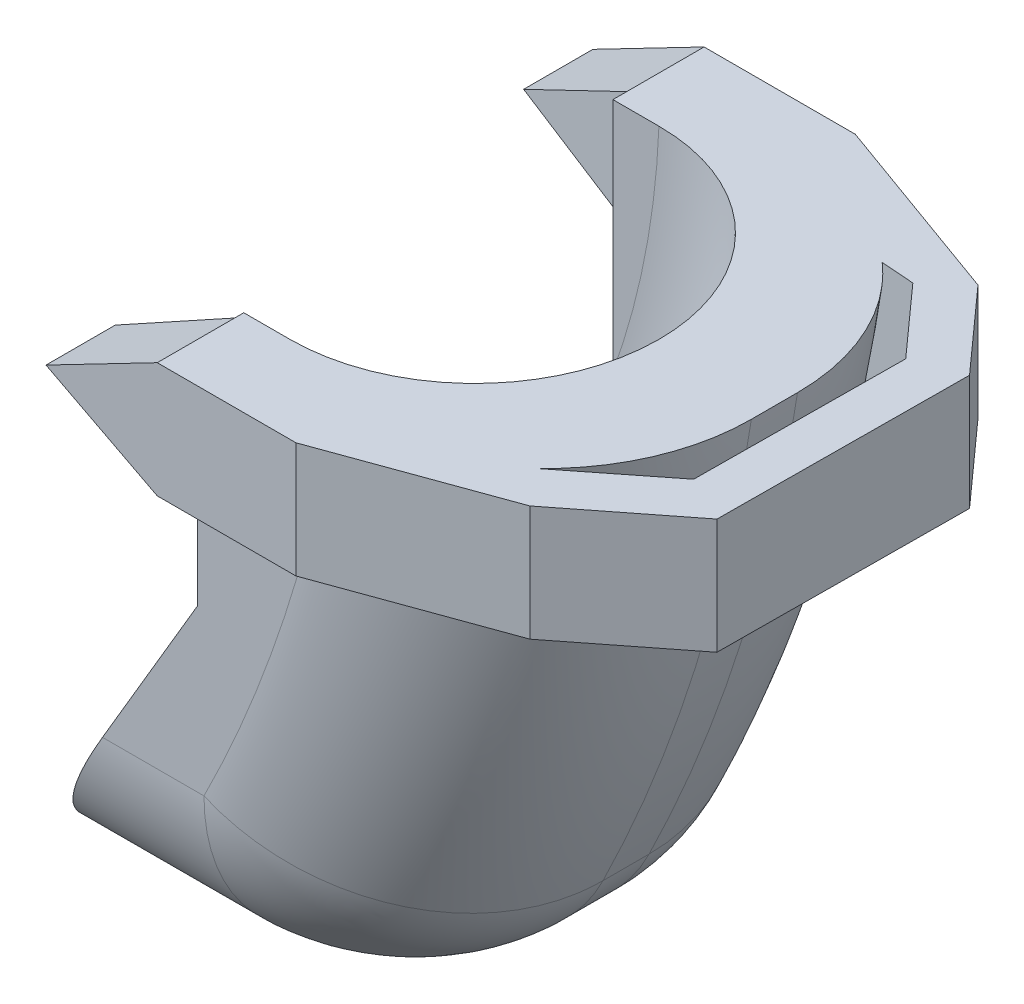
ISO-10303-21;
HEADER;
FILE_DESCRIPTION(('STEP AP214'),'2;1');
FILE_NAME('part.step','',(''),(''),'','','');
FILE_SCHEMA(('AUTOMOTIVE_DESIGN { 1 0 10303 214 1 1 1 1 }'));
ENDSEC;
DATA;
#1=APPLICATION_CONTEXT('core data for automotive mechanical design processes');
#2=APPLICATION_PROTOCOL_DEFINITION('international standard','automotive_design',2000,#1);
#3=PRODUCT_CONTEXT('',#1,'mechanical');
#4=PRODUCT('Part','Part','',(#3));
#5=PRODUCT_RELATED_PRODUCT_CATEGORY('part','',(#4));
#6=PRODUCT_DEFINITION_FORMATION('','',#4);
#7=PRODUCT_DEFINITION_CONTEXT('part definition',#1,'design');
#8=PRODUCT_DEFINITION('design','',#6,#7);
#9=PRODUCT_DEFINITION_SHAPE('','',#8);
#10=(LENGTH_UNIT() NAMED_UNIT(*) SI_UNIT(.MILLI.,.METRE.));
#11=(NAMED_UNIT(*) PLANE_ANGLE_UNIT() SI_UNIT($,.RADIAN.));
#12=(NAMED_UNIT(*) SI_UNIT($,.STERADIAN.) SOLID_ANGLE_UNIT());
#13=UNCERTAINTY_MEASURE_WITH_UNIT(LENGTH_MEASURE(1.E-05),#10,'distance_accuracy_value','');
#14=(GEOMETRIC_REPRESENTATION_CONTEXT(3) GLOBAL_UNCERTAINTY_ASSIGNED_CONTEXT((#13)) GLOBAL_UNIT_ASSIGNED_CONTEXT((#10,
#11,#12)) REPRESENTATION_CONTEXT('',''));
#15=CARTESIAN_POINT('',(0.,0.,0.));
#16=DIRECTION('',(0.,0.,1.));
#17=DIRECTION('',(1.,0.,0.));
#18=AXIS2_PLACEMENT_3D('',#15,#16,#17);
#19=CARTESIAN_POINT('',(-12.2458716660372,-12.7,2.66277032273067));
#20=DIRECTION('',(-0.0731673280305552,0.,0.997319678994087));
#21=DIRECTION('',(0.997319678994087,0.,0.0731673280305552));
#22=AXIS2_PLACEMENT_3D('',#19,#20,#21);
#23=PLANE('',#22);
#24=DIRECTION('',(0.885869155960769,0.459360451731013,0.0649908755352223));
#25=VECTOR('',#24,1.);
#26=CARTESIAN_POINT('',(-14.8298978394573,-7.6899263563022,2.47319591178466));
#27=LINE('',#26,#25);
#28=CARTESIAN_POINT('',(-12.2458716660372,-6.35,2.66277032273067));
#29=VERTEX_POINT('',#28);
#30=CARTESIAN_POINT('',(0.,0.,3.56117604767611));
#31=VERTEX_POINT('',#30);
#32=EDGE_CURVE('E291',#29,#31,#27,.T.);
#33=ORIENTED_EDGE('',*,*,#32,.F.);
#34=DIRECTION('',(0.885869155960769,-0.459360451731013,0.0649908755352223));
#35=VECTOR('',#34,1.);
#36=CARTESIAN_POINT('',(-9.66184549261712,-7.6899263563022,2.85234473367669));
#37=LINE('',#36,#35);
#38=CARTESIAN_POINT('',(0.,-12.7,3.56117604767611));
#39=VERTEX_POINT('',#38);
#40=EDGE_CURVE('E308',#29,#39,#37,.T.);
#41=ORIENTED_EDGE('',*,*,#40,.T.);
#42=DIRECTION('',(0.,-1.,0.));
#43=VECTOR('',#42,1.);
#44=CARTESIAN_POINT('',(0.,-25.4,3.5611760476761));
#45=LINE('',#44,#43);
#46=EDGE_CURVE('E562',#31,#39,#45,.T.);
#47=ORIENTED_EDGE('',*,*,#46,.F.);
#48=EDGE_LOOP('',(#33,#41,#47));
#49=FACE_BOUND('',#48,.T.);
#50=ADVANCED_FACE('F40',(#49),#23,.T.);
#51=CARTESIAN_POINT('',(-12.2458716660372,-12.7,47.626800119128));
#52=DIRECTION('',(0.0733140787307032,0.,0.997308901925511));
#53=DIRECTION('',(0.997308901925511,0.,-0.0733140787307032));
#54=AXIS2_PLACEMENT_3D('',#51,#52,#53);
#55=PLANE('',#54);
#56=DIRECTION('',(0.885861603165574,-0.459356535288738,-0.0651213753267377));
#57=VECTOR('',#56,1.);
#58=CARTESIAN_POINT('',(-9.66188955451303,-7.68990350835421,47.4368466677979));
#59=LINE('',#58,#57);
#60=CARTESIAN_POINT('',(-12.2458716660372,-6.35,47.626800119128));
#61=VERTEX_POINT('',#60);
#62=CARTESIAN_POINT('',(0.,-12.7,46.7265827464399));
#63=VERTEX_POINT('',#62);
#64=EDGE_CURVE('E305',#61,#63,#59,.T.);
#65=ORIENTED_EDGE('',*,*,#64,.F.);
#66=DIRECTION('',(0.885861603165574,0.459356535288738,-0.0651213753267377));
#67=VECTOR('',#66,1.);
#68=CARTESIAN_POINT('',(-14.8298537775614,-7.68990350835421,47.8167535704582));
#69=LINE('',#68,#67);
#70=CARTESIAN_POINT('',(0.,0.,46.7265827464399));
#71=VERTEX_POINT('',#70);
#72=EDGE_CURVE('E269',#61,#71,#69,.T.);
#73=ORIENTED_EDGE('',*,*,#72,.T.);
#74=DIRECTION('',(0.,-1.,0.));
#75=VECTOR('',#74,1.);
#76=CARTESIAN_POINT('',(0.,-25.4,46.7265827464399));
#77=LINE('',#76,#75);
#78=EDGE_CURVE('E572',#71,#63,#77,.T.);
#79=ORIENTED_EDGE('',*,*,#78,.T.);
#80=EDGE_LOOP('',(#65,#73,#79));
#81=FACE_BOUND('',#80,.T.);
#82=ADVANCED_FACE('F443',(#81),#55,.F.);
#83=CARTESIAN_POINT('',(0.,-12.7,0.));
#84=DIRECTION('',(0.,-1.,0.));
#85=DIRECTION('',(0.,0.,-1.));
#86=AXIS2_PLACEMENT_3D('',#83,#84,#85);
#87=PLANE('',#86);
#88=DIRECTION('',(-1.,0.,0.));
#89=VECTOR('',#88,1.);
#90=CARTESIAN_POINT('',(15.272358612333,-12.7,55.2468001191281));
#91=LINE('',#90,#89);
#92=CARTESIAN_POINT('',(15.272358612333,-12.7,55.2468001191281));
#93=VERTEX_POINT('',#92);
#94=CARTESIAN_POINT('',(0.,-12.7,55.2468001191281));
#95=VERTEX_POINT('',#94);
#96=EDGE_CURVE('E347',#93,#95,#91,.T.);
#97=ORIENTED_EDGE('',*,*,#96,.T.);
#98=DIRECTION('',(0.,0.,1.));
#99=VECTOR('',#98,1.);
#100=CARTESIAN_POINT('',(0.,-12.7,-13.3331998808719));
#101=LINE('',#100,#99);
#102=CARTESIAN_POINT('',(0.,-12.7,50.8));
#103=VERTEX_POINT('',#102);
#104=EDGE_CURVE('E288',#103,#95,#101,.T.);
#105=ORIENTED_EDGE('',*,*,#104,.F.);
#106=DIRECTION('',(-1.,0.,0.));
#107=VECTOR('',#106,1.);
#108=CARTESIAN_POINT('',(0.,-12.7,50.8));
#109=LINE('',#108,#107);
#110=CARTESIAN_POINT('',(12.1934657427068,-12.7,50.8000000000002));
#111=VERTEX_POINT('',#110);
#112=EDGE_CURVE('E415',#111,#103,#109,.T.);
#113=ORIENTED_EDGE('',*,*,#112,.F.);
#114=CARTESIAN_POINT('',(2.82980075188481,-12.7,48.9361625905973));
#115=CARTESIAN_POINT('',(3.46357732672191,-12.7,49.1990731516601));
#116=CARTESIAN_POINT('',(4.10847991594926,-12.7,49.4351376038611));
#117=CARTESIAN_POINT('',(5.08893338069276,-12.7,49.7478629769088));
#118=CARTESIAN_POINT('',(5.41800162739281,-12.7,49.845224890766));
#119=CARTESIAN_POINT('',(6.08003128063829,-12.7,50.0260367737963));
#120=CARTESIAN_POINT('',(6.41299369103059,-12.7,50.1094830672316));
#121=CARTESIAN_POINT('',(7.41743736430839,-12.7,50.3388540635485));
#122=CARTESIAN_POINT('',(8.093868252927,-12.7,50.4636174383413));
#123=CARTESIAN_POINT('',(9.45482723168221,-12.7,50.6557858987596));
#124=CARTESIAN_POINT('',(10.1393553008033,-12.7,50.72319113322));
#125=CARTESIAN_POINT('',(11.1683261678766,-12.7,50.7808955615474));
#126=CARTESIAN_POINT('',(11.5116655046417,-12.7,50.7928968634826));
#127=CARTESIAN_POINT('',(12.1984550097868,-12.7,50.8024134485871));
#128=CARTESIAN_POINT('',(12.5419051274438,-12.7,50.7999324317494));
#129=CARTESIAN_POINT('',(13.5717150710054,-12.7,50.770726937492));
#130=CARTESIAN_POINT('',(14.2575862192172,-12.7,50.7222429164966));
#131=CARTESIAN_POINT('',(15.622454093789,-12.7,50.5674003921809));
#132=CARTESIAN_POINT('',(16.301452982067,-12.7,50.4610607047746));
#133=CARTESIAN_POINT('',(17.6479722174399,-12.7,50.1910128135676));
#134=CARTESIAN_POINT('',(18.3154926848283,-12.7,50.0273052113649));
#135=CARTESIAN_POINT('',(19.6309426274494,-12.7,49.644306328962));
#136=CARTESIAN_POINT('',(20.2789502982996,-12.7,49.4252836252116));
#137=CARTESIAN_POINT('',(21.5538335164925,-12.7,48.9325227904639));
#138=CARTESIAN_POINT('',(22.1807090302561,-12.7,48.6587845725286));
#139=CARTESIAN_POINT('',(23.4085108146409,-12.7,48.0582532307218));
#140=CARTESIAN_POINT('',(24.0094374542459,-12.7,47.7314608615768));
#141=CARTESIAN_POINT('',(25.1806283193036,-12.7,47.026899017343));
#142=CARTESIAN_POINT('',(25.750893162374,-12.7,46.6491305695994));
#143=CARTESIAN_POINT('',(26.8437370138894,-12.7,45.8541809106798));
#144=CARTESIAN_POINT('',(27.3671001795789,-12.7,45.4380775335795));
#145=CARTESIAN_POINT('',(28.376031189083,-12.7,44.5623154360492));
#146=CARTESIAN_POINT('',(28.8615994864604,-12.7,44.1026572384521));
#147=CARTESIAN_POINT('',(29.7909698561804,-12.7,43.1429944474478));
#148=CARTESIAN_POINT('',(30.2347770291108,-12.7,42.6429947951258));
#149=CARTESIAN_POINT('',(31.0770293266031,-12.7,41.6061430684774));
#150=CARTESIAN_POINT('',(31.4754753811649,-12.7,41.0692917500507));
#151=CARTESIAN_POINT('',(32.2132428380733,-12.7,39.9780557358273));
#152=CARTESIAN_POINT('',(32.5539005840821,-12.7,39.4245741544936));
#153=CARTESIAN_POINT('',(33.186418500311,-12.7,38.2903949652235));
#154=CARTESIAN_POINT('',(33.4782795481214,-12.7,37.709697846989));
#155=CARTESIAN_POINT('',(34.010772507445,-12.7,36.5253444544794));
#156=CARTESIAN_POINT('',(34.2514100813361,-12.7,35.9216907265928));
#157=CARTESIAN_POINT('',(34.6794856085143,-12.7,34.6958042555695));
#158=CARTESIAN_POINT('',(34.8669242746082,-12.7,34.0735717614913));
#159=CARTESIAN_POINT('',(35.1833913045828,-12.7,32.8294466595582));
#160=CARTESIAN_POINT('',(35.3136473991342,-12.7,32.2078660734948));
#161=CARTESIAN_POINT('',(35.5207776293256,-12.7,30.955876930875));
#162=CARTESIAN_POINT('',(35.5976526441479,-12.7,30.3254685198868));
#163=CARTESIAN_POINT('',(35.6973899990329,-12.7,29.0604359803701));
#164=CARTESIAN_POINT('',(35.7202559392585,-12.7,28.4258121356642));
#165=CARTESIAN_POINT('',(35.7117980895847,-12.7,27.156925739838));
#166=CARTESIAN_POINT('',(35.6804744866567,-12.7,26.5226631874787));
#167=CARTESIAN_POINT('',(35.5645332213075,-12.7,25.2660238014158));
#168=CARTESIAN_POINT('',(35.4805014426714,-12.7,24.6435928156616));
#169=CARTESIAN_POINT('',(35.2603523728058,-12.7,23.4080182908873));
#170=CARTESIAN_POINT('',(35.1242355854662,-12.7,22.7948746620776));
#171=CARTESIAN_POINT('',(34.8010011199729,-12.7,21.5821953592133));
#172=CARTESIAN_POINT('',(34.6138841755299,-12.7,20.982659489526));
#173=CARTESIAN_POINT('',(34.1901229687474,-12.7,19.801356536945));
#174=CARTESIAN_POINT('',(33.9534784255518,-12.7,19.2195895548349));
#175=CARTESIAN_POINT('',(33.4316536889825,-12.7,18.0759486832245));
#176=CARTESIAN_POINT('',(33.1463171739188,-12.7,17.5141461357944));
#177=CARTESIAN_POINT('',(32.5298584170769,-12.7,16.4162590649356));
#178=CARTESIAN_POINT('',(32.1987362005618,-12.7,15.8801745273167));
#179=CARTESIAN_POINT('',(31.4932141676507,-12.7,14.8372618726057));
#180=CARTESIAN_POINT('',(31.1188126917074,-12.7,14.3304348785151));
#181=CARTESIAN_POINT('',(30.3295421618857,-12.7,13.3493408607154));
#182=CARTESIAN_POINT('',(29.9146726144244,-12.7,12.8750742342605));
#183=CARTESIAN_POINT('',(29.0404109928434,-12.7,11.9546215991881));
#184=CARTESIAN_POINT('',(28.580401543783,-12.7,11.5090219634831));
#185=CARTESIAN_POINT('',(27.6251378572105,-12.7,10.6573666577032));
#186=CARTESIAN_POINT('',(27.1298833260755,-12.7,10.2513113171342));
#187=CARTESIAN_POINT('',(26.1076826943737,-12.7,9.48119404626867));
#188=CARTESIAN_POINT('',(25.580734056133,-12.7,9.11713548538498));
#189=CARTESIAN_POINT('',(24.4989160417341,-12.7,8.43318915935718));
#190=CARTESIAN_POINT('',(23.9440462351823,-12.7,8.11330207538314));
#191=CARTESIAN_POINT('',(22.7959288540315,-12.7,7.51202016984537));
#192=CARTESIAN_POINT('',(22.2020664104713,-12.7,7.23179909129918));
#193=CARTESIAN_POINT('',(20.9932627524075,-12.7,6.72127885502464));
#194=CARTESIAN_POINT('',(20.3783212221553,-12.7,6.49098044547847));
#195=CARTESIAN_POINT('',(19.1315762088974,-12.7,6.0815244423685));
#196=CARTESIAN_POINT('',(18.4997709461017,-12.7,5.90237227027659));
#197=CARTESIAN_POINT('',(17.2236671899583,-12.7,5.59614164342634));
#198=CARTESIAN_POINT('',(16.5793685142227,-12.7,5.46906394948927));
#199=CARTESIAN_POINT('',(15.2652290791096,-12.7,5.2648678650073));
#200=CARTESIAN_POINT('',(14.5951661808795,-12.7,5.18917730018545));
#201=CARTESIAN_POINT('',(13.2510707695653,-12.7,5.09360249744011));
#202=CARTESIAN_POINT('',(12.5770381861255,-12.7,5.07371925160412));
#203=CARTESIAN_POINT('',(11.2295662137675,-12.7,5.08972867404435));
#204=CARTESIAN_POINT('',(10.5561268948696,-12.7,5.12562722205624));
#205=CARTESIAN_POINT('',(9.21450640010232,-12.7,5.25286880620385));
#206=CARTESIAN_POINT('',(8.5463252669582,-12.7,5.34421229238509));
#207=CARTESIAN_POINT('',(7.20771666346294,-12.7,5.58386453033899));
#208=CARTESIAN_POINT('',(6.53746877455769,-12.7,5.7331776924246));
#209=CARTESIAN_POINT('',(5.21189218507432,-12.7,6.0876376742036));
#210=CARTESIAN_POINT('',(4.55656370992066,-12.7,6.29278533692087));
#211=CARTESIAN_POINT('',(3.26549859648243,-12.7,6.75763175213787));
#212=CARTESIAN_POINT('',(2.62976308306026,-12.7,7.01733363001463));
#213=CARTESIAN_POINT('',(1.38257789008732,-12.7,7.58967015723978));
#214=CARTESIAN_POINT('',(0.771128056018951,-12.7,7.902304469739));
#215=CARTESIAN_POINT('',(-0.422071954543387,-12.7,8.57810358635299));
#216=CARTESIAN_POINT('',(-1.00386211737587,-12.7,8.94119775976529));
#217=CARTESIAN_POINT('',(-2.13415411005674,-12.7,9.71598150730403));
#218=CARTESIAN_POINT('',(-2.68265577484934,-12.7,10.1276713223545));
#219=CARTESIAN_POINT('',(-3.74191633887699,-12.7,10.9969851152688));
#220=CARTESIAN_POINT('',(-4.25267802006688,-12.7,11.4546057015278));
#221=CARTESIAN_POINT('',(-5.23220386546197,-12.7,12.4127892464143));
#222=CARTESIAN_POINT('',(-5.70096913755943,-12.7,12.913351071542));
#223=CARTESIAN_POINT('',(-6.58064026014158,-12.7,13.9402885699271));
#224=CARTESIAN_POINT('',(-6.99274438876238,-12.7,14.4656378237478));
#225=CARTESIAN_POINT('',(-7.76962316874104,-12.7,15.5502569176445));
#226=CARTESIAN_POINT('',(-8.13439842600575,-12.7,16.1095263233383));
#227=CARTESIAN_POINT('',(-8.81319550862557,-12.7,17.2579195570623));
#228=CARTESIAN_POINT('',(-9.12722797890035,-12.7,17.8470370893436));
#229=CARTESIAN_POINT('',(-9.70160569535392,-12.7,19.0508910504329));
#230=CARTESIAN_POINT('',(-9.96195283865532,-12.7,19.6656265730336));
#231=CARTESIAN_POINT('',(-10.4166501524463,-12.7,20.8898623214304));
#232=CARTESIAN_POINT('',(-10.6133035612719,-12.7,21.4985078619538));
#233=CARTESIAN_POINT('',(-10.9530607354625,-12.7,22.7305670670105));
#234=CARTESIAN_POINT('',(-11.0961660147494,-12.7,23.3539803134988));
#235=CARTESIAN_POINT('',(-11.3274076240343,-12.7,24.610804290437));
#236=CARTESIAN_POINT('',(-11.4155541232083,-12.7,25.2442131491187));
#237=CARTESIAN_POINT('',(-11.536039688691,-12.7,26.5163156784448));
#238=CARTESIAN_POINT('',(-11.5683797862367,-12.7,27.1550092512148));
#239=CARTESIAN_POINT('',(-11.5767926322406,-12.7,28.4118416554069));
#240=CARTESIAN_POINT('',(-11.5546721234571,-12.7,29.0299691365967));
#241=CARTESIAN_POINT('',(-11.4581306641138,-12.7,30.2621130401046));
#242=CARTESIAN_POINT('',(-11.3837110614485,-12.7,30.8761295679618));
#243=CARTESIAN_POINT('',(-11.1832776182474,-12.7,32.0956181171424));
#244=CARTESIAN_POINT('',(-11.0572684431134,-12.7,32.7010909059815));
#245=CARTESIAN_POINT('',(-10.7548149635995,-12.7,33.899301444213));
#246=CARTESIAN_POINT('',(-10.5783703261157,-12.7,34.4920391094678));
#247=CARTESIAN_POINT('',(-10.1771087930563,-12.7,35.6593210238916));
#248=CARTESIAN_POINT('',(-9.95240777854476,-12.7,36.233905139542));
#249=CARTESIAN_POINT('',(-9.45633576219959,-12.7,37.3625451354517));
#250=CARTESIAN_POINT('',(-9.184964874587,-12.7,37.9166010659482));
#251=CARTESIAN_POINT('',(-8.59772033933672,-12.7,39.0008294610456));
#252=CARTESIAN_POINT('',(-8.28183184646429,-12.7,39.5309938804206));
#253=CARTESIAN_POINT('',(-7.60815733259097,-12.7,40.5639816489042));
#254=CARTESIAN_POINT('',(-7.25037103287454,-12.7,41.0668048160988));
#255=CARTESIAN_POINT('',(-6.48470132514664,-12.7,42.0562842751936));
#256=CARTESIAN_POINT('',(-6.07566659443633,-12.7,42.5420497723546));
#257=CARTESIAN_POINT('',(-5.21929592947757,-12.7,43.4785976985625));
#258=CARTESIAN_POINT('',(-4.7719569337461,-12.7,43.9293773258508));
#259=CARTESIAN_POINT('',(-3.84275391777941,-12.7,44.7929087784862));
#260=CARTESIAN_POINT('',(-3.36092259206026,-12.7,45.2056957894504));
#261=CARTESIAN_POINT('',(-2.36594864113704,-12.7,45.9912969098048));
#262=CARTESIAN_POINT('',(-1.85281336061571,-12.7,46.3641203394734));
#263=CARTESIAN_POINT('',(-0.671588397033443,-12.7,47.1526708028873));
#264=CARTESIAN_POINT('',(0.00406840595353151,-12.7,47.5571229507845));
#265=CARTESIAN_POINT('',(1.39154438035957,-12.7,48.298194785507));
#266=CARTESIAN_POINT('',(2.10336398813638,-12.7,48.6348136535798));
#267=CARTESIAN_POINT('',(2.82980075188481,-12.7,48.9361625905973));
#268=B_SPLINE_CURVE_WITH_KNOTS('',3,(#114,#115,#116,#117,#118,#119,#120,#121,#122,#123,#124,
#125,#126,#127,#128,#129,#130,#131,#132,#133,#134,#135,#136,#137,#138,#139,#140,#141,#142,#143,
#144,#145,#146,#147,#148,#149,#150,#151,#152,#153,#154,#155,#156,#157,#158,#159,#160,#161,#162,
#163,#164,#165,#166,#167,#168,#169,#170,#171,#172,#173,#174,#175,#176,#177,#178,#179,#180,#181,
#182,#183,#184,#185,#186,#187,#188,#189,#190,#191,#192,#193,#194,#195,#196,#197,#198,#199,#200,
#201,#202,#203,#204,#205,#206,#207,#208,#209,#210,#211,#212,#213,#214,#215,#216,#217,#218,#219,
#220,#221,#222,#223,#224,#225,#226,#227,#228,#229,#230,#231,#232,#233,#234,#235,#236,#237,#238,
#239,#240,#241,#242,#243,#244,#245,#246,#247,#248,#249,#250,#251,#252,#253,#254,#255,#256,#257,
#258,#259,#260,#261,#262,#263,#264,#265,#266,#267),.UNSPECIFIED.,.T.,.F.,(4,2,2,2,2,2,2,2,2,2,2,
2,2,2,2,2,2,2,2,2,2,2,2,2,2,2,2,2,2,2,2,2,2,2,2,2,2,2,2,2,2,2,2,2,2,2,2,2,2,2,2,2,2,2,2,2,2,2,2,
2,2,2,2,2,2,2,2,2,2,2,2,2,2,2,2,2,4),(0.,2.05765926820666,3.08690090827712,4.11641398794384,
6.17734467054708,8.23827000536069,9.26864843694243,10.2987636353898,12.3588390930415,
14.4182449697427,16.477629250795,18.5272004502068,20.5767749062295,22.6263202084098,
24.675824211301,26.6792215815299,28.6825949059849,30.6857232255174,32.6888104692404,
34.6361786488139,36.5835118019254,38.5306295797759,40.4777212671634,42.3806763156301,
44.2836000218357,46.1863968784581,48.0891871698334,49.9711927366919,51.8531800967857,
53.7351403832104,55.6171113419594,57.505241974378,59.3933715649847,61.2815735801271,
63.1697986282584,65.0889166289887,67.0080506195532,68.927338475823,70.8466559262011,
72.8143611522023,74.782095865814,76.7500390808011,78.7180110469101,80.7386429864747,
82.7593108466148,84.7801917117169,86.8010889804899,88.8586874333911,90.9163169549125,
92.9740643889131,95.0317987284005,97.0866812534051,99.1415739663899,101.196315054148,
103.251001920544,105.251600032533,107.252172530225,109.25232479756,111.252406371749,
113.168909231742,115.08535790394,117.001451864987,118.917510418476,120.770864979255,
122.624171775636,124.477311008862,126.330462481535,128.179212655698,130.027958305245,
131.877321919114,133.72669783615,135.629668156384,137.532790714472,139.434132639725,
141.335030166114,143.693497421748,146.051993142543),.UNSPECIFIED.);
#269=CARTESIAN_POINT('',(28.2674267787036,-12.7,44.6485903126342));
#270=VERTEX_POINT('',#269);
#271=EDGE_CURVE('E449',#111,#270,#268,.T.);
#272=ORIENTED_EDGE('',*,*,#271,.T.);
#273=DIRECTION('',(0.997308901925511,0.,-0.0733140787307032));
#274=VECTOR('',#273,1.);
#275=CARTESIAN_POINT('',(-12.2458716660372,-12.7,47.626800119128));
#276=LINE('',#275,#274);
#277=CARTESIAN_POINT('',(30.9688981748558,-12.7,44.45));
#278=VERTEX_POINT('',#277);
#279=EDGE_CURVE('E313',#270,#278,#276,.T.);
#280=ORIENTED_EDGE('',*,*,#279,.T.);
#281=DIRECTION('',(0.785478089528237,0.,-0.618889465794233));
#282=VECTOR('',#281,1.);
#283=CARTESIAN_POINT('',(30.9688981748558,-12.7,44.45));
#284=LINE('',#283,#282);
#285=CARTESIAN_POINT('',(40.64,-12.7,36.83));
#286=VERTEX_POINT('',#285);
#287=EDGE_CURVE('E316',#278,#286,#284,.T.);
#288=ORIENTED_EDGE('',*,*,#287,.T.);
#289=DIRECTION('',(0.00824523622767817,0.,-0.999966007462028));
#290=VECTOR('',#289,1.);
#291=CARTESIAN_POINT('',(40.64,-12.7,36.83));
#292=LINE('',#291,#290);
#293=CARTESIAN_POINT('',(40.8309236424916,-12.7,13.6751567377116));
#294=VERTEX_POINT('',#293);
#295=EDGE_CURVE('E319',#286,#294,#292,.T.);
#296=ORIENTED_EDGE('',*,*,#295,.T.);
#297=DIRECTION('',(-0.667792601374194,0.,-0.744347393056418));
#298=VECTOR('',#297,1.);
#299=CARTESIAN_POINT('',(40.8309236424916,-12.7,13.6751567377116));
#300=LINE('',#299,#298);
#301=CARTESIAN_POINT('',(33.9946269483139,-12.7,6.05515673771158));
#302=VERTEX_POINT('',#301);
#303=EDGE_CURVE('E322',#294,#302,#300,.T.);
#304=ORIENTED_EDGE('',*,*,#303,.T.);
#305=DIRECTION('',(0.997319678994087,0.,0.0731673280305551));
#306=VECTOR('',#305,1.);
#307=CARTESIAN_POINT('',(-12.2458716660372,-12.7,2.66277032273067));
#308=LINE('',#307,#306);
#309=CARTESIAN_POINT('',(27.6237957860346,-12.7,5.58776729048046));
#310=VERTEX_POINT('',#309);
#311=EDGE_CURVE('E326',#310,#302,#308,.T.);
#312=ORIENTED_EDGE('',*,*,#311,.F.);
#313=CARTESIAN_POINT('',(3.13586122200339,-12.7,1.73930315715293));
#314=CARTESIAN_POINT('',(2.51433143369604,-12.7,1.98728777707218));
#315=CARTESIAN_POINT('',(1.90312816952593,-12.7,2.26089027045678));
#316=CARTESIAN_POINT('',(0.705288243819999,-12.7,2.85785980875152));
#317=CARTESIAN_POINT('',(0.118657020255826,-12.7,3.18123779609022));
#318=CARTESIAN_POINT('',(-1.02615664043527,-12.7,3.87612889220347));
#319=CARTESIAN_POINT('',(-1.5843104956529,-12.7,4.24768908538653));
#320=CARTESIAN_POINT('',(-2.66735451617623,-12.7,5.03644824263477));
#321=CARTESIAN_POINT('',(-3.19224657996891,-12.7,5.45364459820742));
#322=CARTESIAN_POINT('',(-4.20525972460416,-12.7,6.33160391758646));
#323=CARTESIAN_POINT('',(-4.69334009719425,-12.7,6.79241387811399));
#324=CARTESIAN_POINT('',(-5.62812286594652,-12.7,7.75428984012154));
#325=CARTESIAN_POINT('',(-6.0748244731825,-12.7,8.25535660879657));
#326=CARTESIAN_POINT('',(-6.92288474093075,-12.7,9.29425691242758));
#327=CARTESIAN_POINT('',(-7.32425746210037,-12.7,9.83207896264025));
#328=CARTESIAN_POINT('',(-8.07820977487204,-12.7,10.940904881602));
#329=CARTESIAN_POINT('',(-8.43079094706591,-12.7,11.5119076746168));
#330=CARTESIAN_POINT('',(-9.07451492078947,-12.7,12.6662328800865));
#331=CARTESIAN_POINT('',(-9.36712561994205,-12.7,13.2487368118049));
#332=CARTESIAN_POINT('',(-9.90047198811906,-12.7,14.4370411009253));
#333=CARTESIAN_POINT('',(-10.1412084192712,-12.7,15.0428411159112));
#334=CARTESIAN_POINT('',(-10.5684464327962,-12.7,16.2731630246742));
#335=CARTESIAN_POINT('',(-10.7549576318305,-12.7,16.8976815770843));
#336=CARTESIAN_POINT('',(-11.0719391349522,-12.7,18.1607819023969));
#337=CARTESIAN_POINT('',(-11.202411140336,-12.7,18.7993632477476));
#338=CARTESIAN_POINT('',(-11.4019290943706,-12.7,20.0599521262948));
#339=CARTESIAN_POINT('',(-11.4732159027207,-12.7,20.6816058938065));
#340=CARTESIAN_POINT('',(-11.5622263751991,-12.7,21.9287285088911));
#341=CARTESIAN_POINT('',(-11.579951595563,-12.7,22.5541972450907));
#342=CARTESIAN_POINT('',(-11.5616709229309,-12.7,23.8042726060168));
#343=CARTESIAN_POINT('',(-11.5256713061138,-12.7,24.4288793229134));
#344=CARTESIAN_POINT('',(-11.4002993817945,-12.7,25.6727104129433));
#345=CARTESIAN_POINT('',(-11.3109272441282,-12.7,26.2919348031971));
#346=CARTESIAN_POINT('',(-11.0816282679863,-12.7,27.5100606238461));
#347=CARTESIAN_POINT('',(-10.9425845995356,-12.7,28.1091286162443));
#348=CARTESIAN_POINT('',(-10.6150075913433,-12.7,29.2935602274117));
#349=CARTESIAN_POINT('',(-10.4264750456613,-12.7,29.8789240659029));
#350=CARTESIAN_POINT('',(-10.0015746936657,-12.7,31.0320316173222));
#351=CARTESIAN_POINT('',(-9.76520553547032,-12.7,31.5997748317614));
#352=CARTESIAN_POINT('',(-9.24664912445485,-12.7,32.7139317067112));
#353=CARTESIAN_POINT('',(-8.96446106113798,-12.7,33.2603449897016));
#354=CARTESIAN_POINT('',(-8.35153118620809,-12.7,34.337280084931));
#355=CARTESIAN_POINT('',(-8.02006055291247,-12.7,34.8673870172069));
#356=CARTESIAN_POINT('',(-7.31486081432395,-12.7,35.8986880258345));
#357=CARTESIAN_POINT('',(-6.94113143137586,-12.7,36.3998819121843));
#358=CARTESIAN_POINT('',(-6.15427539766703,-12.7,37.3704133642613));
#359=CARTESIAN_POINT('',(-5.74114382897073,-12.7,37.839746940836));
#360=CARTESIAN_POINT('',(-4.87859663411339,-12.7,38.7437891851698));
#361=CARTESIAN_POINT('',(-4.42918013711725,-12.7,39.1784970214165));
#362=CARTESIAN_POINT('',(-3.47933158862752,-12.7,40.026883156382));
#363=CARTESIAN_POINT('',(-2.97760219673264,-12.7,40.4391094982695));
#364=CARTESIAN_POINT('',(-1.94216264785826,-12.7,41.2212141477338));
#365=CARTESIAN_POINT('',(-1.40845176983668,-12.7,41.5910914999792));
#366=CARTESIAN_POINT('',(-0.312749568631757,-12.7,42.2864540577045));
#367=CARTESIAN_POINT('',(0.249246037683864,-12.7,42.611932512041));
#368=CARTESIAN_POINT('',(1.39759747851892,-12.7,43.2166213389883));
#369=CARTESIAN_POINT('',(1.98395377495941,-12.7,43.4958308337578));
#370=CARTESIAN_POINT('',(3.19983307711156,-12.7,44.0161495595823));
#371=CARTESIAN_POINT('',(3.83014967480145,-12.7,44.2554059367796));
#372=CARTESIAN_POINT('',(5.10841924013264,-12.7,44.6809592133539));
#373=CARTESIAN_POINT('',(5.75637265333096,-12.7,44.8672547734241));
#374=CARTESIAN_POINT('',(7.06551552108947,-12.7,45.1857555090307));
#375=CARTESIAN_POINT('',(7.72670642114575,-12.7,45.3179547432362));
#376=CARTESIAN_POINT('',(9.0577382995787,-12.7,45.5273766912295));
#377=CARTESIAN_POINT('',(9.72757933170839,-12.7,45.6045990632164));
#378=CARTESIAN_POINT('',(11.0845216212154,-12.7,45.7044698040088));
#379=CARTESIAN_POINT('',(11.7717040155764,-12.7,45.726019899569));
#380=CARTESIAN_POINT('',(13.1454509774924,-12.7,45.7111011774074));
#381=CARTESIAN_POINT('',(13.8320155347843,-12.7,45.6746314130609));
#382=CARTESIAN_POINT('',(15.1996177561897,-12.7,45.5437317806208));
#383=CARTESIAN_POINT('',(15.8806553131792,-12.7,45.4493007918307));
#384=CARTESIAN_POINT('',(17.2322422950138,-12.7,45.2028943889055));
#385=CARTESIAN_POINT('',(17.9027918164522,-12.7,45.0509195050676));
#386=CARTESIAN_POINT('',(19.2255948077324,-12.7,44.6909955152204));
#387=CARTESIAN_POINT('',(19.877914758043,-12.7,44.4832908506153));
#388=CARTESIAN_POINT('',(21.1623864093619,-12.7,44.0127842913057));
#389=CARTESIAN_POINT('',(21.7945380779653,-12.7,43.7499823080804));
#390=CARTESIAN_POINT('',(23.033798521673,-12.7,43.17087615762));
#391=CARTESIAN_POINT('',(23.6409090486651,-12.7,42.8545757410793));
#392=CARTESIAN_POINT('',(24.8253789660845,-12.7,42.1704570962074));
#393=CARTESIAN_POINT('',(25.4027389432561,-12.7,41.8026398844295));
#394=CARTESIAN_POINT('',(26.5108247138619,-12.7,41.0265056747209));
#395=CARTESIAN_POINT('',(27.0422942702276,-12.7,40.6192503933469));
#396=CARTESIAN_POINT('',(28.0681730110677,-12.7,39.760455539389));
#397=CARTESIAN_POINT('',(28.5625826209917,-12.7,39.3089164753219));
#398=CARTESIAN_POINT('',(29.5103086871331,-12.7,38.3646902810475));
#399=CARTESIAN_POINT('',(29.9636299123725,-12.7,37.8720079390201));
#400=CARTESIAN_POINT('',(30.8255085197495,-12.7,36.8489284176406));
#401=CARTESIAN_POINT('',(31.2340668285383,-12.7,36.318532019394));
#402=CARTESIAN_POINT('',(31.9922830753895,-12.7,35.2391249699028));
#403=CARTESIAN_POINT('',(32.3432637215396,-12.7,34.6910430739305));
#404=CARTESIAN_POINT('',(32.9968364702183,-12.7,33.5667475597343));
#405=CARTESIAN_POINT('',(33.2994294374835,-12.7,32.9905344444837));
#406=CARTESIAN_POINT('',(33.85370669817,-12.7,31.814194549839));
#407=CARTESIAN_POINT('',(34.1053965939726,-12.7,31.214070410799));
#408=CARTESIAN_POINT('',(34.5558054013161,-12.7,29.9942608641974));
#409=CARTESIAN_POINT('',(34.7545250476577,-12.7,29.3745757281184));
#410=CARTESIAN_POINT('',(35.093349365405,-12.7,28.1347890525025));
#411=CARTESIAN_POINT('',(35.2347035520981,-12.7,27.5150287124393));
#412=CARTESIAN_POINT('',(35.4641150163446,-12.7,26.2657244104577));
#413=CARTESIAN_POINT('',(35.5521731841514,-12.7,25.6361806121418));
#414=CARTESIAN_POINT('',(35.674268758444,-12.7,24.3719214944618));
#415=CARTESIAN_POINT('',(35.7083100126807,-12.7,23.7372065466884));
#416=CARTESIAN_POINT('',(35.7221041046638,-12.7,22.4671869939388));
#417=CARTESIAN_POINT('',(35.7018571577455,-12.7,21.8318823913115));
#418=CARTESIAN_POINT('',(35.6077930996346,-12.7,20.5726844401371));
#419=CARTESIAN_POINT('',(35.5346012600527,-12.7,19.9487442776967));
#420=CARTESIAN_POINT('',(35.335935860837,-12.7,18.7092505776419));
#421=CARTESIAN_POINT('',(35.2104628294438,-12.7,18.0936969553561));
#422=CARTESIAN_POINT('',(34.9082370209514,-12.7,16.8753244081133));
#423=CARTESIAN_POINT('',(34.7314850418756,-12.7,16.2725052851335));
#424=CARTESIAN_POINT('',(34.3280967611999,-12.7,15.0837973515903));
#425=CARTESIAN_POINT('',(34.1014601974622,-12.7,14.4979086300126));
#426=CARTESIAN_POINT('',(33.5994379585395,-12.7,13.3456369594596));
#427=CARTESIAN_POINT('',(33.323929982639,-12.7,12.779307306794));
#428=CARTESIAN_POINT('',(32.7266948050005,-12.7,11.6715766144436));
#429=CARTESIAN_POINT('',(32.4049676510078,-12.7,11.1301755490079));
#430=CARTESIAN_POINT('',(31.7177367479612,-12.7,10.0758880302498));
#431=CARTESIAN_POINT('',(31.3522312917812,-12.7,9.56300269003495));
#432=CARTESIAN_POINT('',(30.5801948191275,-12.7,8.56910416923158));
#433=CARTESIAN_POINT('',(30.1736633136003,-12.7,8.08809136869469));
#434=CARTESIAN_POINT('',(29.315845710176,-12.7,7.15366846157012));
#435=CARTESIAN_POINT('',(28.8639545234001,-12.7,6.70081382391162));
#436=CARTESIAN_POINT('',(27.9242896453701,-12.7,5.83401464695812));
#437=CARTESIAN_POINT('',(27.4365156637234,-12.7,5.42007042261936));
#438=CARTESIAN_POINT('',(26.4286142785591,-12.7,4.63361802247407));
#439=CARTESIAN_POINT('',(25.9084856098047,-12.7,4.26111146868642));
#440=CARTESIAN_POINT('',(24.8395884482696,-12.7,3.55975528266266));
#441=CARTESIAN_POINT('',(24.2908195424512,-12.7,3.23090628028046));
#442=CARTESIAN_POINT('',(23.1545241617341,-12.7,2.61114155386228));
#443=CARTESIAN_POINT('',(22.5663739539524,-12.7,2.32136911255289));
#444=CARTESIAN_POINT('',(21.3681892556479,-12.7,1.79129830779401));
#445=CARTESIAN_POINT('',(20.7581543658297,-12.7,1.55100084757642));
#446=CARTESIAN_POINT('',(19.520242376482,-12.7,1.12111249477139));
#447=CARTESIAN_POINT('',(18.8923591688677,-12.7,0.931539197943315));
#448=CARTESIAN_POINT('',(17.6232484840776,-12.7,0.604176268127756));
#449=CARTESIAN_POINT('',(16.9820209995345,-12.7,0.466386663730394));
#450=CARTESIAN_POINT('',(15.6728431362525,-12.7,0.240181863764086));
#451=CARTESIAN_POINT('',(15.0046414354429,-12.7,0.153219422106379));
#452=CARTESIAN_POINT('',(13.6632909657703,-12.7,0.0349829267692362));
#453=CARTESIAN_POINT('',(12.9901418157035,-12.7,0.0037132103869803));
#454=CARTESIAN_POINT('',(11.6441758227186,-12.7,-0.00308656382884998));
#455=CARTESIAN_POINT('',(10.9713592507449,-12.7,0.0213317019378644));
#456=CARTESIAN_POINT('',(9.63023383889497,-12.7,0.125494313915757));
#457=CARTESIAN_POINT('',(8.96192399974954,-12.7,0.205225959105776));
#458=CARTESIAN_POINT('',(7.41506870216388,-12.7,0.454804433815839));
#459=CARTESIAN_POINT('',(6.53984010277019,-12.7,0.645692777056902));
#460=CARTESIAN_POINT('',(4.81554678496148,-12.7,1.12223645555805));
#461=CARTESIAN_POINT('',(3.96648240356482,-12.7,1.40789301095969));
#462=CARTESIAN_POINT('',(3.13586122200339,-12.7,1.73930315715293));
#463=B_SPLINE_CURVE_WITH_KNOTS('',3,(#313,#314,#315,#316,#317,#318,#319,#320,#321,#322,#323,
#324,#325,#326,#327,#328,#329,#330,#331,#332,#333,#334,#335,#336,#337,#338,#339,#340,#341,#342,
#343,#344,#345,#346,#347,#348,#349,#350,#351,#352,#353,#354,#355,#356,#357,#358,#359,#360,#361,
#362,#363,#364,#365,#366,#367,#368,#369,#370,#371,#372,#373,#374,#375,#376,#377,#378,#379,#380,
#381,#382,#383,#384,#385,#386,#387,#388,#389,#390,#391,#392,#393,#394,#395,#396,#397,#398,#399,
#400,#401,#402,#403,#404,#405,#406,#407,#408,#409,#410,#411,#412,#413,#414,#415,#416,#417,#418,
#419,#420,#421,#422,#423,#424,#425,#426,#427,#428,#429,#430,#431,#432,#433,#434,#435,#436,#437,
#438,#439,#440,#441,#442,#443,#444,#445,#446,#447,#448,#449,#450,#451,#452,#453,#454,#455,#456,
#457,#458,#459,#460,#461,#462),.UNSPECIFIED.,.T.,.F.,(4,2,2,2,2,2,2,2,2,2,2,2,2,2,2,2,2,2,2,2,2,
2,2,2,2,2,2,2,2,2,2,2,2,2,2,2,2,2,2,2,2,2,2,2,2,2,2,2,2,2,2,2,2,2,2,2,2,2,2,2,2,2,2,2,2,2,2,2,2,
2,2,2,2,2,4),(0.,2.00678232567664,4.01400644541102,6.02320704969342,8.03229287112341,
10.0435688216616,12.0548831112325,14.0655717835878,16.0761953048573,18.0293560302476,
19.9824880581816,21.9352734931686,23.887999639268,25.762901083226,27.6377480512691,
29.5123760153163,31.386998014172,33.2298244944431,35.072621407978,36.915470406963,
38.7583520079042,40.6318531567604,42.5053666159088,44.3791142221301,46.2529068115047,
48.1987707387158,50.1446785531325,52.0908819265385,54.0371222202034,56.0573808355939,
58.0776905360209,60.0982220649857,62.1187661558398,64.1788763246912,66.2390201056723,
68.2992037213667,70.3593683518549,72.4106403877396,74.4619157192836,76.5130472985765,
78.5641384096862,80.5703699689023,82.576578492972,84.5825538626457,86.5884876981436,
88.5385995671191,90.488676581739,92.4385388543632,94.3883740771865,96.2931070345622,
98.1978081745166,100.102373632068,102.006931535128,103.889356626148,105.771762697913,
107.654139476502,109.53652614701,111.423691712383,113.310855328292,115.198092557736,
117.085352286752,119.002398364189,120.919459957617,122.836596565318,124.753760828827,
126.71848073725,128.683236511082,130.648672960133,132.614110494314,134.633278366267,
136.652603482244,138.670055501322,140.687044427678,143.36890212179,146.050794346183),.UNSPECIFIED.);
#464=CARTESIAN_POINT('',(12.1934657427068,-12.7,0.));
#465=VERTEX_POINT('',#464);
#466=EDGE_CURVE('E423',#310,#465,#463,.T.);
#467=ORIENTED_EDGE('',*,*,#466,.T.);
#468=DIRECTION('',(-1.,0.,0.));
#469=VECTOR('',#468,1.);
#470=CARTESIAN_POINT('',(0.,-12.7,0.));
#471=LINE('',#470,#469);
#472=CARTESIAN_POINT('',(0.,-12.7,0.));
#473=VERTEX_POINT('',#472);
#474=EDGE_CURVE('E431',#465,#473,#471,.T.);
#475=ORIENTED_EDGE('',*,*,#474,.T.);
#476=CARTESIAN_POINT('',(0.,-12.7,-4.95722967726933));
#477=VERTEX_POINT('',#476);
#478=EDGE_CURVE('E300',#477,#473,#101,.T.);
#479=ORIENTED_EDGE('',*,*,#478,.F.);
#480=DIRECTION('',(1.,0.,0.));
#481=VECTOR('',#480,1.);
#482=CARTESIAN_POINT('',(-12.2458716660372,-12.7,-4.95722967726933));
#483=LINE('',#482,#481);
#484=CARTESIAN_POINT('',(16.6501107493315,-12.7,-4.95722967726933));
#485=VERTEX_POINT('',#484);
#486=EDGE_CURVE('E329',#477,#485,#483,.T.);
#487=ORIENTED_EDGE('',*,*,#486,.T.);
#488=DIRECTION('',(0.940678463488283,0.,0.339299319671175));
#489=VECTOR('',#488,1.);
#490=CARTESIAN_POINT('',(16.6501107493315,-12.7,-4.95722967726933));
#491=LINE('',#490,#489);
#492=CARTESIAN_POINT('',(37.7759117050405,-12.7,2.66277032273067));
#493=VERTEX_POINT('',#492);
#494=EDGE_CURVE('E332',#485,#493,#491,.T.);
#495=ORIENTED_EDGE('',*,*,#494,.T.);
#496=DIRECTION('',(0.667792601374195,0.,0.744347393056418));
#497=VECTOR('',#496,1.);
#498=CARTESIAN_POINT('',(37.7759117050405,-12.7,2.66277032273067));
#499=LINE('',#498,#497);
#500=CARTESIAN_POINT('',(45.9109236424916,-12.7,11.7303684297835));
#501=VERTEX_POINT('',#500);
#502=EDGE_CURVE('E335',#493,#501,#499,.T.);
#503=ORIENTED_EDGE('',*,*,#502,.T.);
#504=DIRECTION('',(-0.00691305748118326,0.,0.999976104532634));
#505=VECTOR('',#504,1.);
#506=CARTESIAN_POINT('',(45.9109236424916,-12.7,11.7303684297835));
#507=LINE('',#506,#505);
#508=CARTESIAN_POINT('',(45.72,-12.7,39.3475379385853));
#509=VERTEX_POINT('',#508);
#510=EDGE_CURVE('E338',#501,#509,#507,.T.);
#511=ORIENTED_EDGE('',*,*,#510,.T.);
#512=DIRECTION('',(-0.78725226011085,0.,0.616631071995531));
#513=VECTOR('',#512,1.);
#514=CARTESIAN_POINT('',(45.72,-12.7,39.3475379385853));
#515=LINE('',#514,#513);
#516=CARTESIAN_POINT('',(34.1776173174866,-12.7,48.3883399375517));
#517=VERTEX_POINT('',#516);
#518=EDGE_CURVE('E341',#509,#517,#515,.T.);
#519=ORIENTED_EDGE('',*,*,#518,.T.);
#520=DIRECTION('',(-0.940051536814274,0.,0.341032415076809));
#521=VECTOR('',#520,1.);
#522=CARTESIAN_POINT('',(34.1776173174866,-12.7,48.3883399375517));
#523=LINE('',#522,#521);
#524=EDGE_CURVE('E344',#517,#93,#523,.T.);
#525=ORIENTED_EDGE('',*,*,#524,.T.);
#526=EDGE_LOOP('',(#97,#105,#113,#272,#280,#288,#296,#304,#312,#467,#475,#479,#487,#495,#503,
#511,#519,#525));
#527=FACE_BOUND('',#526,.T.);
#528=ADVANCED_FACE('F437',(#527),#87,.T.);
#529=CARTESIAN_POINT('',(-12.2458716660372,-12.7,-4.95722967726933));
#530=DIRECTION('',(0.,0.,1.));
#531=DIRECTION('',(1.,0.,0.));
#532=AXIS2_PLACEMENT_3D('',#529,#530,#531);
#533=PLANE('',#532);
#534=DIRECTION('',(0.887745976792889,-0.460333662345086,0.));
#535=VECTOR('',#534,1.);
#536=CARTESIAN_POINT('',(-9.6508847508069,-7.69560996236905,-4.95722967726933));
#537=LINE('',#536,#535);
#538=CARTESIAN_POINT('',(-12.2458716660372,-6.35,-4.95722967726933));
#539=VERTEX_POINT('',#538);
#540=EDGE_CURVE('E302',#539,#477,#537,.T.);
#541=ORIENTED_EDGE('',*,*,#540,.F.);
#542=DIRECTION('',(0.887745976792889,0.460333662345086,0.));
#543=VECTOR('',#542,1.);
#544=CARTESIAN_POINT('',(-14.8408585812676,-7.69560996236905,-4.95722967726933));
#545=LINE('',#544,#543);
#546=CARTESIAN_POINT('',(0.,0.,-4.95722967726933));
#547=VERTEX_POINT('',#546);
#548=EDGE_CURVE('E56',#539,#547,#545,.T.);
#549=ORIENTED_EDGE('',*,*,#548,.T.);
#550=DIRECTION('',(1.,0.,0.));
#551=VECTOR('',#550,1.);
#552=CARTESIAN_POINT('',(-12.2458716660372,0.,-4.95722967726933));
#553=LINE('',#552,#551);
#554=CARTESIAN_POINT('',(16.6501107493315,0.,-4.95722967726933));
#555=VERTEX_POINT('',#554);
#556=EDGE_CURVE('E361',#547,#555,#553,.T.);
#557=ORIENTED_EDGE('',*,*,#556,.T.);
#558=DIRECTION('',(0.,1.,0.));
#559=VECTOR('',#558,1.);
#560=CARTESIAN_POINT('',(16.6501107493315,-12.7,-4.95722967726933));
#561=LINE('',#560,#559);
#562=EDGE_CURVE('E399',#485,#555,#561,.T.);
#563=ORIENTED_EDGE('',*,*,#562,.F.);
#564=ORIENTED_EDGE('',*,*,#486,.F.);
#565=EDGE_LOOP('',(#541,#549,#557,#563,#564));
#566=FACE_BOUND('',#565,.T.);
#567=ADVANCED_FACE('F442',(#566),#533,.F.);
#568=CARTESIAN_POINT('',(15.272358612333,-12.7,55.2468001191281));
#569=DIRECTION('',(0.,0.,-1.));
#570=DIRECTION('',(-1.,0.,0.));
#571=AXIS2_PLACEMENT_3D('',#568,#569,#570);
#572=PLANE('',#571);
#573=DIRECTION('',(-1.,0.,0.));
#574=VECTOR('',#573,1.);
#575=CARTESIAN_POINT('',(15.272358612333,0.,55.2468001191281));
#576=LINE('',#575,#574);
#577=CARTESIAN_POINT('',(15.272358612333,0.,55.2468001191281));
#578=VERTEX_POINT('',#577);
#579=CARTESIAN_POINT('',(0.,0.,55.2468001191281));
#580=VERTEX_POINT('',#579);
#581=EDGE_CURVE('E282',#578,#580,#576,.T.);
#582=ORIENTED_EDGE('',*,*,#581,.T.);
#583=DIRECTION('',(0.887745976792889,0.460333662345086,0.));
#584=VECTOR('',#583,1.);
#585=CARTESIAN_POINT('',(0.,0.,55.2468001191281));
#586=LINE('',#585,#584);
#587=CARTESIAN_POINT('',(-12.2458716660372,-6.35,55.2468001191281));
#588=VERTEX_POINT('',#587);
#589=EDGE_CURVE('E266',#588,#580,#586,.T.);
#590=ORIENTED_EDGE('',*,*,#589,.F.);
#591=DIRECTION('',(0.887745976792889,-0.460333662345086,0.));
#592=VECTOR('',#591,1.);
#593=CARTESIAN_POINT('',(-5.18997383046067,-10.0087800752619,55.2468001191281));
#594=LINE('',#593,#592);
#595=EDGE_CURVE('E278',#588,#95,#594,.T.);
#596=ORIENTED_EDGE('',*,*,#595,.T.);
#597=ORIENTED_EDGE('',*,*,#96,.F.);
#598=DIRECTION('',(0.,1.,0.));
#599=VECTOR('',#598,1.);
#600=CARTESIAN_POINT('',(15.272358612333,-12.7,55.2468001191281));
#601=LINE('',#600,#599);
#602=EDGE_CURVE('E350',#93,#578,#601,.T.);
#603=ORIENTED_EDGE('',*,*,#602,.T.);
#604=EDGE_LOOP('',(#582,#590,#596,#597,#603));
#605=FACE_BOUND('',#604,.T.);
#606=ADVANCED_FACE('F276',(#605),#572,.F.);
#607=CARTESIAN_POINT('',(0.,-25.4,50.8));
#608=DIRECTION('',(1.,0.,0.));
#609=DIRECTION('',(0.,0.,-1.));
#610=AXIS2_PLACEMENT_3D('',#607,#608,#609);
#611=PLANE('',#610);
#612=DIRECTION('',(0.,0.,-1.));
#613=VECTOR('',#612,1.);
#614=CARTESIAN_POINT('',(0.,-12.7,50.8));
#615=LINE('',#614,#613);
#616=EDGE_CURVE('E419',#103,#63,#615,.T.);
#617=ORIENTED_EDGE('',*,*,#616,.T.);
#618=ORIENTED_EDGE('',*,*,#78,.F.);
#619=DIRECTION('',(0.,0.,-1.));
#620=VECTOR('',#619,1.);
#621=CARTESIAN_POINT('',(0.,0.,50.8));
#622=LINE('',#621,#620);
#623=CARTESIAN_POINT('',(0.,0.,45.72));
#624=VERTEX_POINT('',#623);
#625=EDGE_CURVE('E768',#71,#624,#622,.T.);
#626=ORIENTED_EDGE('',*,*,#625,.T.);
#627=DIRECTION('',(0.,-1.,0.));
#628=VECTOR('',#627,1.);
#629=CARTESIAN_POINT('',(0.,0.,45.72));
#630=LINE('',#629,#628);
#631=CARTESIAN_POINT('',(0.,-25.4,45.72));
#632=VERTEX_POINT('',#631);
#633=EDGE_CURVE('E878',#624,#632,#630,.T.);
#634=ORIENTED_EDGE('',*,*,#633,.T.);
#635=DIRECTION('',(0.,0.,-1.));
#636=VECTOR('',#635,1.);
#637=CARTESIAN_POINT('',(0.,-25.4,50.8));
#638=LINE('',#637,#636);
#639=CARTESIAN_POINT('',(0.,-25.4,50.8));
#640=VERTEX_POINT('',#639);
#641=EDGE_CURVE('E779',#640,#632,#638,.T.);
#642=ORIENTED_EDGE('',*,*,#641,.F.);
#643=DIRECTION('',(0.,-1.,0.));
#644=VECTOR('',#643,1.);
#645=CARTESIAN_POINT('',(0.,-25.4,50.8));
#646=LINE('',#645,#644);
#647=EDGE_CURVE('E759',#103,#640,#646,.T.);
#648=ORIENTED_EDGE('',*,*,#647,.F.);
#649=EDGE_LOOP('',(#617,#618,#626,#634,#642,#648));
#650=FACE_BOUND('',#649,.T.);
#651=ADVANCED_FACE('F476',(#650),#611,.F.);
#652=CARTESIAN_POINT('',(-137.725448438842,26.4244523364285,27.94));
#653=DIRECTION('',(0.,0.,-1.));
#654=DIRECTION('',(-1.,0.,0.));
#655=AXIS2_PLACEMENT_3D('',#652,#653,#654);
#656=TOROIDAL_SURFACE('',#655,154.94,22.86);
#657=CARTESIAN_POINT('',(14.9446269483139,0.,50.8));
#658=CARTESIAN_POINT('',(15.2736293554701,0.,50.8000001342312));
#659=CARTESIAN_POINT('',(15.6025958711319,0.,50.7931032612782));
#660=CARTESIAN_POINT('',(16.2599438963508,0.,50.7655251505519));
#661=CARTESIAN_POINT('',(16.5883254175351,0.,50.7448441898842));
#662=CARTESIAN_POINT('',(17.5717033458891,0.,50.662150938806));
#663=CARTESIAN_POINT('',(18.2250732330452,0.,50.5794882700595));
#664=CARTESIAN_POINT('',(19.522372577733,0.,50.3595787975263));
#665=CARTESIAN_POINT('',(20.1663046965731,0.,50.2223477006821));
#666=CARTESIAN_POINT('',(21.1216410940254,0.,49.9762770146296));
#667=CARTESIAN_POINT('',(21.4383370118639,0.,49.8875456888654));
#668=CARTESIAN_POINT('',(22.0677881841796,0.,49.6967840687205));
#669=CARTESIAN_POINT('',(22.3805423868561,0.,49.5947503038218));
#670=CARTESIAN_POINT('',(23.3122557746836,0.,49.2688371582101));
#671=CARTESIAN_POINT('',(23.9244249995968,0.,49.0252079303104));
#672=CARTESIAN_POINT('',(25.1259156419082,0.,48.4869490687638));
#673=CARTESIAN_POINT('',(25.7152372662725,0.,48.1923198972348));
#674=CARTESIAN_POINT('',(26.5786744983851,0.,47.7137309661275));
#675=CARTESIAN_POINT('',(26.8630693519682,0.,47.5480893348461));
#676=CARTESIAN_POINT('',(27.4244758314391,0.,47.2048943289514));
#677=CARTESIAN_POINT('',(27.7014893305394,0.,47.0273440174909));
#678=CARTESIAN_POINT('',(28.5208295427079,0.,46.4771740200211));
#679=CARTESIAN_POINT('',(29.0515205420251,0.,46.0869994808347));
#680=CARTESIAN_POINT('',(30.0734117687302,0.,45.2660655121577));
#681=CARTESIAN_POINT('',(30.5648947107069,0.,44.8356568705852));
#682=CARTESIAN_POINT('',(31.5094848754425,0.,43.9345666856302));
#683=CARTESIAN_POINT('',(31.962592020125,0.,43.4638850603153));
#684=CARTESIAN_POINT('',(32.8270722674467,0.,42.4854749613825));
#685=CARTESIAN_POINT('',(33.2384369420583,0.,41.9777390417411));
#686=CARTESIAN_POINT('',(34.0161922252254,0.,40.9289266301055));
#687=CARTESIAN_POINT('',(34.3825839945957,0.,40.3878509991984));
#688=CARTESIAN_POINT('',(35.0634249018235,0.,39.2830057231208));
#689=CARTESIAN_POINT('',(35.3784504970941,0.,38.7195912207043));
#690=CARTESIAN_POINT('',(35.9595111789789,0.,37.5679879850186));
#691=CARTESIAN_POINT('',(36.2255433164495,0.,36.9797977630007));
#692=CARTESIAN_POINT('',(36.7064063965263,0.,35.7833052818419));
#693=CARTESIAN_POINT('',(36.9212702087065,0.,35.1750162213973));
#694=CARTESIAN_POINT('',(37.2983352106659,0.,33.9424369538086));
#695=CARTESIAN_POINT('',(37.4605507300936,0.,33.3181511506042));
#696=CARTESIAN_POINT('',(37.6795974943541,0.,32.2981188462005));
#697=CARTESIAN_POINT('',(37.7530374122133,0.,31.9058579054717));
#698=CARTESIAN_POINT('',(37.8790733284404,0.,31.1180087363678));
#699=CARTESIAN_POINT('',(37.931671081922,0.,30.7224207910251));
#700=CARTESIAN_POINT('',(38.0157979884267,0.,29.9296274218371));
#701=CARTESIAN_POINT('',(38.0473591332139,0.,29.5324253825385));
#702=CARTESIAN_POINT('',(38.0894677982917,0.,28.7368172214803));
#703=CARTESIAN_POINT('',(38.1000104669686,0.,28.3384108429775));
#704=CARTESIAN_POINT('',(38.1,0.,27.94));
#705=B_SPLINE_CURVE_WITH_KNOTS('',3,(#657,#658,#659,#660,#661,#662,#663,#664,#665,#666,#667,
#668,#669,#670,#671,#672,#673,#674,#675,#676,#677,#678,#679,#680,#681,#682,#683,#684,#685,#686,
#687,#688,#689,#690,#691,#692,#693,#694,#695,#696,#697,#698,#699,#700,#701,#702,#703,#704),
.UNSPECIFIED.,.F.,.F.,(4,2,2,2,2,2,2,2,2,2,2,2,2,2,2,2,2,2,2,2,2,2,2,4),(0.,0.986863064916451,
1.97370629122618,3.94697374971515,5.91967363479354,6.906091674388,7.89276758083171,
9.86686275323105,11.8409400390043,12.8280265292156,13.814860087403,15.7883064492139,
17.7459173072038,19.7035321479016,21.6615414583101,23.6195002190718,25.5536951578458,
27.4880064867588,29.4210718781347,31.3536106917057,32.5503444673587,33.7469774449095,
34.9417864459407,36.1368712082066),.UNSPECIFIED.);
#706=CARTESIAN_POINT('',(30.9688883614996,0.,44.4500007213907));
#707=VERTEX_POINT('',#706);
#708=CARTESIAN_POINT('',(38.1,0.,27.94));
#709=VERTEX_POINT('',#708);
#710=EDGE_CURVE('E713',#707,#709,#705,.T.);
#711=ORIENTED_EDGE('',*,*,#710,.F.);
#712=CARTESIAN_POINT('',(30.9689223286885,0.000199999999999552,44.4499982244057));
#713=CARTESIAN_POINT('',(30.7876491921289,-1.06715256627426,44.4633239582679));
#714=CARTESIAN_POINT('',(30.5953565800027,-2.13262409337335,44.4774597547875));
#715=CARTESIAN_POINT('',(30.1888800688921,-4.25888498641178,44.5073406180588));
#716=CARTESIAN_POINT('',(29.9747056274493,-5.31967617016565,44.5230849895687));
#717=CARTESIAN_POINT('',(29.5244580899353,-7.43657061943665,44.5561835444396));
#718=CARTESIAN_POINT('',(29.2883851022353,-8.49267390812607,44.573537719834));
#719=CARTESIAN_POINT('',(28.7943027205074,-10.6001885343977,44.6098586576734));
#720=CARTESIAN_POINT('',(28.5362839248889,-11.651597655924,44.6288261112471));
#721=CARTESIAN_POINT('',(28.2673754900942,-12.7002,44.6485940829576));
#722=B_SPLINE_CURVE_WITH_KNOTS('',3,(#712,#713,#714,#715,#716,#717,#718,#719,#720,#721),
.UNSPECIFIED.,.F.,.F.,(4,2,2,2,4),(0.,3.24809785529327,6.49479774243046,9.74148156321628,
12.9895633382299),.UNSPECIFIED.);
#723=EDGE_CURVE('E456',#707,#270,#722,.T.);
#724=ORIENTED_EDGE('',*,*,#723,.T.);
#725=ORIENTED_EDGE('',*,*,#271,.F.);
#726=CARTESIAN_POINT('',(-137.725448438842,26.4244523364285,50.8));
#727=DIRECTION('',(0.,0.,-1.));
#728=DIRECTION('',(-1.,0.,0.));
#729=AXIS2_PLACEMENT_3D('',#726,#727,#728);
#730=CIRCLE('',#729,154.94);
#731=CARTESIAN_POINT('',(0.700068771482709,-43.18,50.8));
#732=VERTEX_POINT('',#731);
#733=EDGE_CURVE('E712',#732,#111,#730,.F.);
#734=ORIENTED_EDGE('',*,*,#733,.F.);
#735=CARTESIAN_POINT('',(-0.334452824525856,-63.5,30.3061460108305));
#736=CARTESIAN_POINT('',(-8.22133511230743,-63.5,52.9574474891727));
#737=CARTESIAN_POINT('',(-6.92533770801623,-39.8409534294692,49.235314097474));
#738=CARTESIAN_POINT('',(-0.251491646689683,-63.5,30.3350343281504));
#739=CARTESIAN_POINT('',(-7.38881142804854,-63.5,52.9041130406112));
#740=CARTESIAN_POINT('',(-6.31505475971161,-40.1101244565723,49.4953089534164));
#741=CARTESIAN_POINT('',(-0.167298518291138,-63.5,30.3603516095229));
#742=CARTESIAN_POINT('',(-6.57285256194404,-63.5,52.812531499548));
#743=CARTESIAN_POINT('',(-5.69540813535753,-40.3829472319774,49.7231644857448));
#744=CARTESIAN_POINT('',(0.00290856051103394,-63.5,30.4037937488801));
#745=CARTESIAN_POINT('',(-4.98986536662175,-63.5,52.5625215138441));
#746=CARTESIAN_POINT('',(-4.44209150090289,-40.9337773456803,50.1141437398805));
#747=CARTESIAN_POINT('',(0.0889221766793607,-63.5,30.4219199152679));
#748=CARTESIAN_POINT('',(-4.22203713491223,-63.5,52.405116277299));
#749=CARTESIAN_POINT('',(-3.80842406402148,-41.2117837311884,50.2772792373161));
#750=CARTESIAN_POINT('',(0.262155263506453,-63.5,30.4509395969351));
#751=CARTESIAN_POINT('',(-2.73553985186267,-63.5,52.0335810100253));
#752=CARTESIAN_POINT('',(-2.53156303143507,-41.7709534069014,50.5384563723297));
#753=CARTESIAN_POINT('',(0.349374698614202,-63.5,30.4618333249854));
#754=CARTESIAN_POINT('',(-2.01601941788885,-63.5,51.8202604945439));
#755=CARTESIAN_POINT('',(-1.88836971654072,-42.0521166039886,50.6364999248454));
#756=CARTESIAN_POINT('',(0.524419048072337,-63.5,30.4763636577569));
#757=CARTESIAN_POINT('',(-0.625227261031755,-63.5,51.3451353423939));
#758=CARTESIAN_POINT('',(-0.596869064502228,-42.6156450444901,50.7672729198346));
#759=CARTESIAN_POINT('',(0.612243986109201,-63.5,30.4799999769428));
#760=CARTESIAN_POINT('',(0.0469052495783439,-63.5,51.0839608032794));
#761=CARTESIAN_POINT('',(0.0514384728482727,-42.8980103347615,50.7999997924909));
#762=CARTESIAN_POINT('',(0.787434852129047,-63.5,30.4800000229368));
#763=CARTESIAN_POINT('',(1.34088914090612,-63.5,50.521405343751));
#764=CARTESIAN_POINT('',(1.34531130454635,-43.4605168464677,50.8000002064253));
#765=CARTESIAN_POINT('',(0.874800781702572,-63.5,30.4764016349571));
#766=CARTESIAN_POINT('',(1.96377852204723,-63.5,50.2207351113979));
#767=CARTESIAN_POINT('',(1.99087323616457,-43.7406619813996,50.7676147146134));
#768=CARTESIAN_POINT('',(1.0489675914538,-63.5,30.4620034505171));
#769=CARTESIAN_POINT('',(3.16489265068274,-63.5,49.5835139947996));
#770=CARTESIAN_POINT('',(3.27845280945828,-44.2984078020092,50.6380310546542));
#771=CARTESIAN_POINT('',(1.13576827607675,-63.5,30.4512012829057));
#772=CARTESIAN_POINT('',(3.74391784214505,-63.5,49.2472943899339));
#773=CARTESIAN_POINT('',(3.92046921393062,-44.5760076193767,50.5408115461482));
#774=CARTESIAN_POINT('',(1.30815796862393,-63.5,30.4224064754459));
#775=CARTESIAN_POINT('',(4.85860984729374,-63.5,48.5435152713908));
#776=CARTESIAN_POINT('',(5.19615263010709,-45.1266190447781,50.2816582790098));
#777=CARTESIAN_POINT('',(1.39374715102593,-63.5,30.4044148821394));
#778=CARTESIAN_POINT('',(5.39506033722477,-63.5,48.1761953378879));
#779=CARTESIAN_POINT('',(5.82982084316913,-45.3996313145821,50.1197339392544));
#780=CARTESIAN_POINT('',(1.56310614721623,-63.5,30.3612697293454));
#781=CARTESIAN_POINT('',(6.42621049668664,-63.5,47.4137166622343));
#782=CARTESIAN_POINT('',(7.08427323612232,-45.9391689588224,49.7314275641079));
#783=CARTESIAN_POINT('',(1.64687592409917,-63.5,30.3361160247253));
#784=CARTESIAN_POINT('',(6.92164978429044,-63.5,47.0186962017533));
#785=CARTESIAN_POINT('',(7.70505715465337,-46.2056942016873,49.5050442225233));
#786=CARTESIAN_POINT('',(1.81221189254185,-63.5,30.2786078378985));
#787=CARTESIAN_POINT('',(7.87357182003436,-63.5,46.2023975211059));
#788=CARTESIAN_POINT('',(8.93084730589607,-46.7310879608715,48.9874705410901));
#789=CARTESIAN_POINT('',(1.89377017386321,-63.5,30.2462305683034));
#790=CARTESIAN_POINT('',(8.33064828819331,-63.5,45.7810797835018));
#791=CARTESIAN_POINT('',(9.53579668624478,-46.9899292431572,48.6960751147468));
#792=CARTESIAN_POINT('',(2.05368678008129,-63.5,30.1744232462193));
#793=CARTESIAN_POINT('',(9.20494677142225,-63.5,44.9158507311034));
#794=CARTESIAN_POINT('',(10.7224725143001,-47.4968556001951,48.0498092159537));
#795=CARTESIAN_POINT('',(2.13204639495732,-63.5,30.1349960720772));
#796=CARTESIAN_POINT('',(9.62285011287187,-63.5,44.4719282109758));
#797=CARTESIAN_POINT('',(11.3042083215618,-47.7449450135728,47.6949646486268));
#798=CARTESIAN_POINT('',(2.28488629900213,-63.5,30.0492114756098));
#799=CARTESIAN_POINT('',(10.4197645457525,-63.5,43.5632890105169));
#800=CARTESIAN_POINT('',(12.4393431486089,-48.2282979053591,46.9229032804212));
#801=CARTESIAN_POINT('',(2.35936645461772,-63.5,30.0028538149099));
#802=CARTESIAN_POINT('',(10.7994016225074,-63.5,43.0984770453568));
#803=CARTESIAN_POINT('',(12.9927411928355,-48.4635609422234,46.5056843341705));
#804=CARTESIAN_POINT('',(2.50368886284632,-63.5,29.9034039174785));
#805=CARTESIAN_POINT('',(11.5201711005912,-63.5,42.1498078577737));
#806=CARTESIAN_POINT('',(14.0654852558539,-48.918956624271,45.6106352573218));
#807=CARTESIAN_POINT('',(2.57353151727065,-63.5,29.8503122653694));
#808=CARTESIAN_POINT('',(11.8618933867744,-63.5,41.6657895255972));
#809=CARTESIAN_POINT('',(14.5848342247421,-49.1390905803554,45.1328103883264));
#810=CARTESIAN_POINT('',(2.70334919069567,-63.5,29.7413993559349));
#811=CARTESIAN_POINT('',(12.4857455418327,-63.5,40.7127028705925));
#812=CARTESIAN_POINT('',(15.5504938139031,-49.547859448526,44.1525942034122));
#813=CARTESIAN_POINT('',(2.76367139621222,-63.5,29.6859919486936));
#814=CARTESIAN_POINT('',(12.7706304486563,-63.5,40.2448085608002));
#815=CARTESIAN_POINT('',(15.9993637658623,-49.7376149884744,43.6539275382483));
#816=CARTESIAN_POINT('',(2.87893614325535,-63.5,29.5698408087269));
#817=CARTESIAN_POINT('',(13.3068243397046,-63.5,39.2950806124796));
#818=CARTESIAN_POINT('',(16.8573268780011,-50.0999027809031,42.6085672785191));
#819=CARTESIAN_POINT('',(2.93387938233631,-63.5,29.5090977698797));
#820=CARTESIAN_POINT('',(13.5585476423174,-63.5,38.8130107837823));
#821=CARTESIAN_POINT('',(17.266425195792,-50.2724372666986,42.061879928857));
#822=CARTESIAN_POINT('',(3.03772681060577,-63.5,29.3826622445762));
#823=CARTESIAN_POINT('',(14.028087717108,-63.5,37.8363091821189));
#824=CARTESIAN_POINT('',(18.0398594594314,-50.5983016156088,40.9239602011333));
#825=CARTESIAN_POINT('',(3.08663205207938,-63.5,29.3169706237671));
#826=CARTESIAN_POINT('',(14.2462835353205,-63.5,37.3413914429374));
#827=CARTESIAN_POINT('',(18.4042032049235,-50.7516348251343,40.3327356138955));
#828=CARTESIAN_POINT('',(3.17776591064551,-63.5,29.1811112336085));
#829=CARTESIAN_POINT('',(14.6483342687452,-63.5,36.3404177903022));
#830=CARTESIAN_POINT('',(19.08330357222,-51.0371858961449,39.1100011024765));
#831=CARTESIAN_POINT('',(3.21999561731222,-63.5,29.1109441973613));
#832=CARTESIAN_POINT('',(14.8325266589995,-63.5,35.8340270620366));
#833=CARTESIAN_POINT('',(19.3980682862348,-51.1694072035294,38.4784977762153));
#834=CARTESIAN_POINT('',(3.29292913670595,-63.5,28.974654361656));
#835=CARTESIAN_POINT('',(15.1477667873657,-63.5,34.8677794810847));
#836=CARTESIAN_POINT('',(19.9417895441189,-51.3976417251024,37.2518892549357));
#837=CARTESIAN_POINT('',(3.32438982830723,-63.5,28.9089357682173));
#838=CARTESIAN_POINT('',(15.2825809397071,-63.5,34.4088448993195));
#839=CARTESIAN_POINT('',(20.1763764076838,-51.4960379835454,36.6604219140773));
#840=CARTESIAN_POINT('',(3.38116086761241,-63.5,28.7748977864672));
#841=CARTESIAN_POINT('',(15.5242251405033,-63.5,33.4847156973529));
#842=CARTESIAN_POINT('',(20.5997471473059,-51.673526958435,35.4540800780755));
#843=CARTESIAN_POINT('',(3.40647215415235,-63.5,28.7065787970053));
#844=CARTESIAN_POINT('',(15.6312281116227,-63.5,33.0192259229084));
#845=CARTESIAN_POINT('',(20.7885380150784,-51.7526226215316,34.8392091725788));
#846=CARTESIAN_POINT('',(3.45056971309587,-63.5,28.568032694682));
#847=CARTESIAN_POINT('',(15.8166948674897,-63.5,32.0844072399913));
#848=CARTESIAN_POINT('',(21.1174841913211,-51.8903846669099,33.5922942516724));
#849=CARTESIAN_POINT('',(3.46937028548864,-63.5,28.4978101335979));
#850=CARTESIAN_POINT('',(15.8953529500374,-63.5,31.6147740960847));
#851=CARTESIAN_POINT('',(21.2577460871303,-51.9490958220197,32.9602912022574));
#852=CARTESIAN_POINT('',(3.50025929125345,-63.5,28.3559373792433));
#853=CARTESIAN_POINT('',(16.0241305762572,-63.5,30.6723876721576));
#854=CARTESIAN_POINT('',(21.4882086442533,-52.0455396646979,31.6834364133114));
#855=CARTESIAN_POINT('',(3.5123518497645,-63.5,28.2842880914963));
#856=CARTESIAN_POINT('',(16.0743610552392,-63.5,30.19930290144));
#857=CARTESIAN_POINT('',(21.5784400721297,-52.0832852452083,31.038592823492));
#858=CARTESIAN_POINT('',(3.52644153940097,-63.5,28.1670623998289));
#859=CARTESIAN_POINT('',(16.1327826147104,-63.5,29.4281816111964));
#860=CARTESIAN_POINT('',(21.6835766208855,-52.1272610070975,29.9835615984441));
#861=CARTESIAN_POINT('',(3.53052172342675,-63.5,28.1217263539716));
#862=CARTESIAN_POINT('',(16.1496765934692,-63.5,29.1306252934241));
#863=CARTESIAN_POINT('',(21.7140237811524,-52.1399945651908,29.5755371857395));
#864=CARTESIAN_POINT('',(3.53596152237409,-63.5,28.0309283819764));
#865=CARTESIAN_POINT('',(16.1721861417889,-63.5,28.5354325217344));
#866=CARTESIAN_POINT('',(21.7546169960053,-52.1569708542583,28.7583554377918));
#867=CARTESIAN_POINT('',(3.53732340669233,-63.5,27.9854665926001));
#868=CARTESIAN_POINT('',(16.1778176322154,-63.5,28.2377104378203));
#869=CARTESIAN_POINT('',(21.7647799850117,-52.1612206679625,28.3491993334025));
#870=CARTESIAN_POINT('',(3.53732258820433,-63.5,27.8742529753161));
#871=CARTESIAN_POINT('',(16.177814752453,-63.5,27.5094954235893));
#872=CARTESIAN_POINT('',(21.7647738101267,-52.1612181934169,27.3482767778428));
#873=CARTESIAN_POINT('',(3.53447361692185,-63.5,27.8084959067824));
#874=CARTESIAN_POINT('',(16.1660338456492,-63.5,27.0787943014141));
#875=CARTESIAN_POINT('',(21.7435134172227,-52.1523279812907,26.7564631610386));
#876=CARTESIAN_POINT('',(3.52310761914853,-63.5,27.6774359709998));
#877=CARTESIAN_POINT('',(16.1189693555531,-63.5,26.2186410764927));
#878=CARTESIAN_POINT('',(21.658698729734,-52.1168558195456,25.5769237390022));
#879=CARTESIAN_POINT('',(3.51458688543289,-63.5,27.6121334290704));
#880=CARTESIAN_POINT('',(16.0836418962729,-63.5,25.7889306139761));
#881=CARTESIAN_POINT('',(21.5951167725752,-52.0902622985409,24.9892008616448));
#882=CARTESIAN_POINT('',(3.49189049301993,-63.5,27.4820434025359));
#883=CARTESIAN_POINT('',(15.9892913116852,-63.5,24.9291764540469));
#884=CARTESIAN_POINT('',(21.4257680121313,-52.0194113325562,23.8183906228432));
#885=CARTESIAN_POINT('',(3.4776752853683,-63.5,27.4172628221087));
#886=CARTESIAN_POINT('',(15.930045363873,-63.5,24.4988976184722));
#887=CARTESIAN_POINT('',(21.3197061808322,-51.9750303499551,23.235365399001));
#888=CARTESIAN_POINT('',(3.44377743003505,-63.5,27.2891923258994));
#889=CARTESIAN_POINT('',(15.7881879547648,-63.5,23.6425078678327));
#890=CARTESIAN_POINT('',(21.0668166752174,-51.8691658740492,22.0827309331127));
#891=CARTESIAN_POINT('',(3.42409831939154,-63.5,27.2259014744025));
#892=CARTESIAN_POINT('',(15.7055066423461,-63.5,23.2161461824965));
#893=CARTESIAN_POINT('',(20.9200153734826,-51.8076934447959,21.5131132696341));
#894=CARTESIAN_POINT('',(3.40177122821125,-63.5,27.163565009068));
#895=CARTESIAN_POINT('',(15.6113303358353,-63.5,22.7928469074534));
#896=CARTESIAN_POINT('',(20.7534808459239,-51.7379255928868,20.9520850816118));
#897=(BOUNDED_SURFACE() B_SPLINE_SURFACE(3,2,((#735,#736,#737),(#738,#739,#740),(#741,#742,
#743),(#744,#745,#746),(#747,#748,#749),(#750,#751,#752),(#753,#754,#755),(#756,#757,#758),
(#759,#760,#761),(#762,#763,#764),(#765,#766,#767),(#768,#769,#770),(#771,#772,#773),(#774,#775,
#776),(#777,#778,#779),(#780,#781,#782),(#783,#784,#785),(#786,#787,#788),(#789,#790,#791),
(#792,#793,#794),(#795,#796,#797),(#798,#799,#800),(#801,#802,#803),(#804,#805,#806),(#807,#808,
#809),(#810,#811,#812),(#813,#814,#815),(#816,#817,#818),(#819,#820,#821),(#822,#823,#824),
(#825,#826,#827),(#828,#829,#830),(#831,#832,#833),(#834,#835,#836),(#837,#838,#839),(#840,#841,
#842),(#843,#844,#845),(#846,#847,#848),(#849,#850,#851),(#852,#853,#854),(#855,#856,#857),
(#858,#859,#860),(#861,#862,#863),(#864,#865,#866),(#867,#868,#869),(#870,#871,#872),(#873,#874,
#875),(#876,#877,#878),(#879,#880,#881),(#882,#883,#884),(#885,#886,#887),(#888,#889,#890),
(#891,#892,#893),(#894,#895,#896)),.UNSPECIFIED.,.F.,.F.,.F.) B_SPLINE_SURFACE_WITH_KNOTS((4,2,
2,2,2,2,2,2,2,2,2,2,2,2,2,2,2,2,2,2,2,2,2,2,2,2,4),(3,3),(0.,0.263444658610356,
0.526841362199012,0.79023031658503,1.05362963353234,1.31565322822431,1.57776311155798,
1.83983485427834,2.10191190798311,2.36482770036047,2.62763639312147,2.89045412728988,
3.1532490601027,3.39863406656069,3.64398720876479,3.88929753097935,4.13456777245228,
4.35285719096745,4.57111326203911,4.78888687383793,5.00652641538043,5.14300986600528,
5.27937932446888,5.47657655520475,5.67390280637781,5.87262395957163,6.07121677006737),(0.,1.),
.UNSPECIFIED.) GEOMETRIC_REPRESENTATION_ITEM() RATIONAL_B_SPLINE_SURFACE(((1.,0.646404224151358,
1.),(1.,0.651528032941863,1.),(1.,0.656659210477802,1.),(1.,0.666899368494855,1.),(1.,
0.672008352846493,1.),(1.,0.682168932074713,1.),(1.,0.687220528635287,1.),(1.,0.697236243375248,
1.),(1.,0.702200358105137,1.),(1.,0.711987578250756,1.),(1.,0.716811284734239,1.),(1.,
0.726321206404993,1.),(1.,0.731007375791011,1.),(1.,0.74021638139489,1.),(1.,0.744739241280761,
1.),(1.,0.753599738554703,1.),(1.,0.757937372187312,1.),(1.,0.766418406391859,1.),(1.,
0.770561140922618,1.),(1.,0.778612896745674,1.),(1.,0.782522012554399,1.),(1.,0.790084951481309,
1.),(1.,0.793738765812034,1.),(1.,0.800766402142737,1.),(1.,0.80414024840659,1.),(1.,
0.810369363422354,1.),(1.,0.813244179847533,1.),(1.,0.818706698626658,1.),(1.,0.821294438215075,
1.),(1.,0.826161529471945,1.),(1.,0.828440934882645,1.),(1.,0.83267084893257,1.),(1.,
0.834621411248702,1.),(1.,0.837978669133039,1.),(1.,0.83942158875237,1.),(1.,0.842018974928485,
1.),(1.,0.843173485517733,1.),(1.,0.845181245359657,1.),(1.,0.846035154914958,1.),(1.,
0.847436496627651,1.),(1.,0.847984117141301,1.),(1.,0.848621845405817,1.),(1.,0.848806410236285,
1.),(1.,0.849052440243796,1.),(1.,0.849114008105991,1.),(1.,0.849113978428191,1.),(1.,
0.848985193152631,1.),(1.,0.848470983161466,1.),(1.,0.848085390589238,1.),(1.,0.847056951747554,
1.),(1.,0.846412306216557,1.),(1.,0.844872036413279,1.),(1.,0.843976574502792,1.),(1.,
0.842958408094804,1.))) REPRESENTATION_ITEM('') SURFACE());
#898=CARTESIAN_POINT('',(-6.92533770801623,-39.8409534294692,49.235314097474));
#899=CARTESIAN_POINT('',(-6.31505475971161,-40.1101244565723,49.4953089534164));
#900=CARTESIAN_POINT('',(-5.69540813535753,-40.3829472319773,49.7231644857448));
#901=CARTESIAN_POINT('',(-4.44209150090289,-40.9337773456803,50.1141437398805));
#902=CARTESIAN_POINT('',(-3.80842406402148,-41.2117837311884,50.2772792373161));
#903=CARTESIAN_POINT('',(-2.53156303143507,-41.7709534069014,50.5384563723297));
#904=CARTESIAN_POINT('',(-1.88836971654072,-42.0521166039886,50.6364999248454));
#905=CARTESIAN_POINT('',(-0.596869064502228,-42.6156450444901,50.7672729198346));
#906=CARTESIAN_POINT('',(0.0514384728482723,-42.8980103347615,50.7999997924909));
#907=CARTESIAN_POINT('',(1.34531130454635,-43.4605168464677,50.8000002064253));
#908=CARTESIAN_POINT('',(1.99087323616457,-43.7406619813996,50.7676147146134));
#909=CARTESIAN_POINT('',(3.27845280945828,-44.2984078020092,50.6380310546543));
#910=CARTESIAN_POINT('',(3.92046921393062,-44.5760076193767,50.5408115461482));
#911=CARTESIAN_POINT('',(5.19615263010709,-45.1266190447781,50.2816582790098));
#912=CARTESIAN_POINT('',(5.82982084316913,-45.3996313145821,50.1197339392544));
#913=CARTESIAN_POINT('',(7.08427323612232,-45.9391689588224,49.7314275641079));
#914=CARTESIAN_POINT('',(7.70505715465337,-46.2056942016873,49.5050442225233));
#915=CARTESIAN_POINT('',(8.93084730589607,-46.7310879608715,48.9874705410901));
#916=CARTESIAN_POINT('',(9.53579668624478,-46.9899292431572,48.6960751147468));
#917=CARTESIAN_POINT('',(10.7224725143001,-47.4968556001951,48.0498092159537));
#918=CARTESIAN_POINT('',(11.3042083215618,-47.7449450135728,47.6949646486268));
#919=CARTESIAN_POINT('',(12.4393431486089,-48.2282979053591,46.9229032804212));
#920=CARTESIAN_POINT('',(12.9927411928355,-48.4635609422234,46.5056843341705));
#921=CARTESIAN_POINT('',(14.0654852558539,-48.918956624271,45.6106352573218));
#922=CARTESIAN_POINT('',(14.5848342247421,-49.1390905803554,45.1328103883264));
#923=CARTESIAN_POINT('',(15.5504938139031,-49.547859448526,44.1525942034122));
#924=CARTESIAN_POINT('',(15.9993637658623,-49.7376149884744,43.6539275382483));
#925=CARTESIAN_POINT('',(16.8573268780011,-50.0999027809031,42.6085672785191));
#926=CARTESIAN_POINT('',(17.266425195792,-50.2724372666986,42.061879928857));
#927=CARTESIAN_POINT('',(18.0398594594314,-50.5983016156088,40.9239602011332));
#928=CARTESIAN_POINT('',(18.4042032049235,-50.7516348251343,40.3327356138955));
#929=CARTESIAN_POINT('',(19.08330357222,-51.0371858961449,39.1100011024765));
#930=CARTESIAN_POINT('',(19.3980682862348,-51.1694072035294,38.4784977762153));
#931=CARTESIAN_POINT('',(19.9417895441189,-51.3976417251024,37.2518892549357));
#932=CARTESIAN_POINT('',(20.1763764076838,-51.4960379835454,36.6604219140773));
#933=CARTESIAN_POINT('',(20.5997471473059,-51.673526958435,35.4540800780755));
#934=CARTESIAN_POINT('',(20.7885380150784,-51.7526226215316,34.8392091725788));
#935=CARTESIAN_POINT('',(21.1174841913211,-51.8903846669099,33.5922942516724));
#936=CARTESIAN_POINT('',(21.2577460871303,-51.9490958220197,32.9602912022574));
#937=CARTESIAN_POINT('',(21.4882086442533,-52.0455396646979,31.6834364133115));
#938=CARTESIAN_POINT('',(21.5784400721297,-52.0832852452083,31.038592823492));
#939=CARTESIAN_POINT('',(21.6835766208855,-52.1272610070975,29.9835615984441));
#940=CARTESIAN_POINT('',(21.7140237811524,-52.1399945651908,29.5755371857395));
#941=CARTESIAN_POINT('',(21.7546169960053,-52.1569708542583,28.7583554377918));
#942=CARTESIAN_POINT('',(21.7647799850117,-52.1612206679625,28.3491993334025));
#943=CARTESIAN_POINT('',(21.7647738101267,-52.1612181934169,27.3482767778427));
#944=CARTESIAN_POINT('',(21.7435134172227,-52.1523279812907,26.7564631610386));
#945=CARTESIAN_POINT('',(21.658698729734,-52.1168558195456,25.5769237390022));
#946=CARTESIAN_POINT('',(21.5951167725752,-52.0902622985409,24.9892008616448));
#947=CARTESIAN_POINT('',(21.4257680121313,-52.0194113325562,23.8183906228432));
#948=CARTESIAN_POINT('',(21.3197061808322,-51.9750303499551,23.235365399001));
#949=CARTESIAN_POINT('',(21.0668166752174,-51.8691658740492,22.0827309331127));
#950=CARTESIAN_POINT('',(20.9200153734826,-51.8076934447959,21.5131132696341));
#951=CARTESIAN_POINT('',(20.7534808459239,-51.7379255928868,20.9520850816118));
#952=B_SPLINE_CURVE_WITH_KNOTS('',3,(#898,#899,#900,#901,#902,#903,#904,#905,#906,#907,#908,
#909,#910,#911,#912,#913,#914,#915,#916,#917,#918,#919,#920,#921,#922,#923,#924,#925,#926,#927,
#928,#929,#930,#931,#932,#933,#934,#935,#936,#937,#938,#939,#940,#941,#942,#943,#944,#945,#946,
#947,#948,#949,#950,#951),.UNSPECIFIED.,.F.,.F.,(4,2,2,2,2,2,2,2,2,2,2,2,2,2,2,2,2,2,2,2,2,2,2,
2,2,2,4),(0.,0.263444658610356,0.526841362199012,0.79023031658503,1.05362963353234,
1.31565322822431,1.57776311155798,1.83983485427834,2.10191190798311,2.36482770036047,
2.62763639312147,2.89045412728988,3.1532490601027,3.39863406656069,3.64398720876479,
3.88929753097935,4.13456777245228,4.35285719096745,4.57111326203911,4.78888687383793,
5.00652641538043,5.14300986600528,5.27937932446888,5.47657655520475,5.67390280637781,
5.87262395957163,6.07121677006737),.UNSPECIFIED.);
#953=CARTESIAN_POINT('',(21.7647774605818,-52.1612196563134,27.94));
#954=VERTEX_POINT('',#953);
#955=EDGE_CURVE('E484',#732,#954,#952,.T.);
#956=ORIENTED_EDGE('',*,*,#955,.T.);
#957=CARTESIAN_POINT('',(-137.725448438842,26.4244523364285,27.94));
#958=DIRECTION('',(0.,0.,-1.));
#959=DIRECTION('',(-1.,0.,0.));
#960=AXIS2_PLACEMENT_3D('',#957,#958,#959);
#961=CIRCLE('',#960,177.8);
#962=EDGE_CURVE('E721',#709,#954,#961,.T.);
#963=ORIENTED_EDGE('',*,*,#962,.F.);
#964=EDGE_LOOP('',(#711,#724,#725,#734,#956,#963));
#965=FACE_BOUND('',#964,.T.);
#966=ADVANCED_FACE('F471',(#965),#656,.T.);
#967=CARTESIAN_POINT('',(0.,-25.4,5.07999999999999));
#968=VERTEX_POINT('',#967);
#969=CARTESIAN_POINT('',(0.,-25.4,0.));
#970=VERTEX_POINT('',#969);
#971=EDGE_CURVE('E778',#968,#970,#638,.T.);
#972=ORIENTED_EDGE('',*,*,#971,.F.);
#973=DIRECTION('',(0.,-1.,0.));
#974=VECTOR('',#973,1.);
#975=CARTESIAN_POINT('',(0.,0.,5.07999999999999));
#976=LINE('',#975,#974);
#977=CARTESIAN_POINT('',(0.,0.,5.07999999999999));
#978=VERTEX_POINT('',#977);
#979=EDGE_CURVE('E762',#978,#968,#976,.T.);
#980=ORIENTED_EDGE('',*,*,#979,.F.);
#981=EDGE_CURVE('E771',#978,#31,#622,.T.);
#982=ORIENTED_EDGE('',*,*,#981,.T.);
#983=ORIENTED_EDGE('',*,*,#46,.T.);
#984=DIRECTION('',(0.,0.,-1.));
#985=VECTOR('',#984,1.);
#986=CARTESIAN_POINT('',(0.,-12.7,50.8));
#987=LINE('',#986,#985);
#988=EDGE_CURVE('E580',#39,#473,#987,.T.);
#989=ORIENTED_EDGE('',*,*,#988,.T.);
#990=DIRECTION('',(0.,-1.,0.));
#991=VECTOR('',#990,1.);
#992=CARTESIAN_POINT('',(0.,-25.4,0.));
#993=LINE('',#992,#991);
#994=EDGE_CURVE('E748',#473,#970,#993,.T.);
#995=ORIENTED_EDGE('',*,*,#994,.T.);
#996=EDGE_LOOP('',(#972,#980,#982,#983,#989,#995));
#997=FACE_BOUND('',#996,.T.);
#998=ADVANCED_FACE('F475',(#997),#611,.F.);
#999=CARTESIAN_POINT('',(-22.4417301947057,-63.5,50.8));
#1000=DIRECTION('',(0.861637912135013,-0.507523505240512,0.));
#1001=DIRECTION('',(0.507523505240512,0.861637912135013,0.));
#1002=AXIS2_PLACEMENT_3D('',#999,#1000,#1001);
#1003=PLANE('',#1002);
#1004=DIRECTION('',(0.,0.,-1.));
#1005=VECTOR('',#1004,1.);
#1006=CARTESIAN_POINT('',(-22.4417301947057,-63.5,50.8));
#1007=LINE('',#1006,#1005);
#1008=CARTESIAN_POINT('',(-22.4417301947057,-63.5,30.48));
#1009=VERTEX_POINT('',#1008);
#1010=CARTESIAN_POINT('',(-22.4417301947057,-63.5,20.32));
#1011=VERTEX_POINT('',#1010);
#1012=EDGE_CURVE('E774',#1009,#1011,#1007,.T.);
#1013=ORIENTED_EDGE('',*,*,#1012,.F.);
#1014=CARTESIAN_POINT('',(-10.472807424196,-43.18,30.48));
#1015=DIRECTION('',(0.861637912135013,-0.507523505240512,0.));
#1016=DIRECTION('',(0.507523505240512,0.861637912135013,0.));
#1017=AXIS2_PLACEMENT_3D('',#1014,#1015,#1016);
#1018=ELLIPSE('',#1017,23.5829920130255,20.32);
#1019=CARTESIAN_POINT('',(-10.472807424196,-43.18,50.8));
#1020=VERTEX_POINT('',#1019);
#1021=EDGE_CURVE('E817',#1009,#1020,#1018,.F.);
#1022=ORIENTED_EDGE('',*,*,#1021,.T.);
#1023=DIRECTION('',(-0.507523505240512,-0.861637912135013,0.));
#1024=VECTOR('',#1023,1.);
#1025=CARTESIAN_POINT('',(-22.4417301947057,-63.5,50.8));
#1026=LINE('',#1025,#1024);
#1027=EDGE_CURVE('E765',#640,#1020,#1026,.T.);
#1028=ORIENTED_EDGE('',*,*,#1027,.F.);
#1029=ORIENTED_EDGE('',*,*,#641,.T.);
#1030=DIRECTION('',(-0.507523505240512,-0.861637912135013,0.));
#1031=VECTOR('',#1030,1.);
#1032=CARTESIAN_POINT('',(0.,-25.4,45.72));
#1033=LINE('',#1032,#1031);
#1034=CARTESIAN_POINT('',(-6.73251905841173,-36.83,45.72));
#1035=VERTEX_POINT('',#1034);
#1036=EDGE_CURVE('E884',#632,#1035,#1033,.T.);
#1037=ORIENTED_EDGE('',*,*,#1036,.T.);
#1038=CARTESIAN_POINT('',(-6.73251905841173,-36.83,25.4));
#1039=DIRECTION('',(0.861637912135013,-0.507523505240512,0.));
#1040=DIRECTION('',(0.507523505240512,0.861637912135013,0.));
#1041=AXIS2_PLACEMENT_3D('',#1038,#1039,#1040);
#1042=ELLIPSE('',#1041,23.5829920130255,20.32);
#1043=CARTESIAN_POINT('',(-18.7014418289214,-57.15,25.4));
#1044=VERTEX_POINT('',#1043);
#1045=EDGE_CURVE('E834',#1035,#1044,#1042,.T.);
#1046=ORIENTED_EDGE('',*,*,#1045,.T.);
#1047=CARTESIAN_POINT('',(-6.73251905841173,-36.83,25.4));
#1048=DIRECTION('',(0.861637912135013,-0.507523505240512,0.));
#1049=DIRECTION('',(0.507523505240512,0.861637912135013,0.));
#1050=AXIS2_PLACEMENT_3D('',#1047,#1048,#1049);
#1051=ELLIPSE('',#1050,23.5829920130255,20.32);
#1052=CARTESIAN_POINT('',(-6.73251905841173,-36.83,5.07999999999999));
#1053=VERTEX_POINT('',#1052);
#1054=EDGE_CURVE('E829',#1044,#1053,#1051,.T.);
#1055=ORIENTED_EDGE('',*,*,#1054,.T.);
#1056=DIRECTION('',(-0.507523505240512,-0.861637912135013,0.));
#1057=VECTOR('',#1056,1.);
#1058=CARTESIAN_POINT('',(0.,-25.4,5.07999999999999));
#1059=LINE('',#1058,#1057);
#1060=EDGE_CURVE('E755',#968,#1053,#1059,.T.);
#1061=ORIENTED_EDGE('',*,*,#1060,.F.);
#1062=ORIENTED_EDGE('',*,*,#971,.T.);
#1063=DIRECTION('',(-0.507523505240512,-0.861637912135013,0.));
#1064=VECTOR('',#1063,1.);
#1065=CARTESIAN_POINT('',(-22.4417301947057,-63.5,0.));
#1066=LINE('',#1065,#1064);
#1067=CARTESIAN_POINT('',(-10.472807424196,-43.18,0.));
#1068=VERTEX_POINT('',#1067);
#1069=EDGE_CURVE('E753',#970,#1068,#1066,.T.);
#1070=ORIENTED_EDGE('',*,*,#1069,.T.);
#1071=CARTESIAN_POINT('',(-10.472807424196,-43.18,20.32));
#1072=DIRECTION('',(0.861637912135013,-0.507523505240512,0.));
#1073=DIRECTION('',(-0.507523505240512,-0.861637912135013,0.));
#1074=AXIS2_PLACEMENT_3D('',#1071,#1072,#1073);
#1075=ELLIPSE('',#1074,23.5829920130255,20.32);
#1076=EDGE_CURVE('E805',#1068,#1011,#1075,.F.);
#1077=ORIENTED_EDGE('',*,*,#1076,.T.);
#1078=EDGE_LOOP('',(#1013,#1022,#1028,#1029,#1037,#1046,#1055,#1061,#1062,#1070,#1077));
#1079=FACE_BOUND('',#1078,.T.);
#1080=ADVANCED_FACE('F935',(#1079),#1003,.F.);
#1081=CARTESIAN_POINT('',(15.6582698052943,-63.5,50.8));
#1082=DIRECTION('',(0.,1.,0.));
#1083=DIRECTION('',(-1.,0.,0.));
#1084=AXIS2_PLACEMENT_3D('',#1081,#1082,#1083);
#1085=PLANE('',#1084);
#1086=CARTESIAN_POINT('',(3.40177122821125,-63.5,27.163565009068));
#1087=CARTESIAN_POINT('',(3.42409831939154,-63.5,27.2259014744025));
#1088=CARTESIAN_POINT('',(3.44377743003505,-63.5,27.2891923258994));
#1089=CARTESIAN_POINT('',(3.4776752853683,-63.5,27.4172628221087));
#1090=CARTESIAN_POINT('',(3.49189049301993,-63.5,27.4820434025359));
#1091=CARTESIAN_POINT('',(3.51458688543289,-63.5,27.6121334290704));
#1092=CARTESIAN_POINT('',(3.52310761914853,-63.5,27.6774359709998));
#1093=CARTESIAN_POINT('',(3.53447361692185,-63.5,27.8084959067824));
#1094=CARTESIAN_POINT('',(3.53732258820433,-63.5,27.8742529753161));
#1095=CARTESIAN_POINT('',(3.53732340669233,-63.5,27.9854665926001));
#1096=CARTESIAN_POINT('',(3.53596152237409,-63.5,28.0309283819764));
#1097=CARTESIAN_POINT('',(3.53052172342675,-63.5,28.1217263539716));
#1098=CARTESIAN_POINT('',(3.52644153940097,-63.5,28.1670623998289));
#1099=CARTESIAN_POINT('',(3.5123518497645,-63.5,28.2842880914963));
#1100=CARTESIAN_POINT('',(3.50025929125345,-63.5,28.3559373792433));
#1101=CARTESIAN_POINT('',(3.46937028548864,-63.5,28.4978101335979));
#1102=CARTESIAN_POINT('',(3.45056971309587,-63.5,28.568032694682));
#1103=CARTESIAN_POINT('',(3.40647215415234,-63.5,28.7065787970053));
#1104=CARTESIAN_POINT('',(3.38116086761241,-63.5,28.7748977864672));
#1105=CARTESIAN_POINT('',(3.32438982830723,-63.5,28.9089357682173));
#1106=CARTESIAN_POINT('',(3.29292913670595,-63.5,28.974654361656));
#1107=CARTESIAN_POINT('',(3.21999561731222,-63.5,29.1109441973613));
#1108=CARTESIAN_POINT('',(3.17776591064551,-63.5,29.1811112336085));
#1109=CARTESIAN_POINT('',(3.08663205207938,-63.5,29.3169706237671));
#1110=CARTESIAN_POINT('',(3.03772681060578,-63.5,29.3826622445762));
#1111=CARTESIAN_POINT('',(2.93387938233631,-63.5,29.5090977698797));
#1112=CARTESIAN_POINT('',(2.87893614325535,-63.5,29.5698408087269));
#1113=CARTESIAN_POINT('',(2.76367139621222,-63.5,29.6859919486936));
#1114=CARTESIAN_POINT('',(2.70334919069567,-63.5,29.7413993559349));
#1115=CARTESIAN_POINT('',(2.57353151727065,-63.5,29.8503122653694));
#1116=CARTESIAN_POINT('',(2.50368886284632,-63.5,29.9034039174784));
#1117=CARTESIAN_POINT('',(2.35936645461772,-63.5,30.0028538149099));
#1118=CARTESIAN_POINT('',(2.28488629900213,-63.5,30.0492114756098));
#1119=CARTESIAN_POINT('',(2.13204639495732,-63.5,30.1349960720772));
#1120=CARTESIAN_POINT('',(2.05368678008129,-63.5,30.1744232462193));
#1121=CARTESIAN_POINT('',(1.89377017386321,-63.5,30.2462305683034));
#1122=CARTESIAN_POINT('',(1.81221189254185,-63.5,30.2786078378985));
#1123=CARTESIAN_POINT('',(1.64687592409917,-63.5,30.3361160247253));
#1124=CARTESIAN_POINT('',(1.56310614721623,-63.5,30.3612697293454));
#1125=CARTESIAN_POINT('',(1.39374715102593,-63.5,30.4044148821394));
#1126=CARTESIAN_POINT('',(1.30815796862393,-63.5,30.4224064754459));
#1127=CARTESIAN_POINT('',(1.13576827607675,-63.5,30.4512012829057));
#1128=CARTESIAN_POINT('',(1.0489675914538,-63.5,30.4620034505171));
#1129=CARTESIAN_POINT('',(0.874800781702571,-63.5,30.4764016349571));
#1130=CARTESIAN_POINT('',(0.787434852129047,-63.5,30.4800000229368));
#1131=CARTESIAN_POINT('',(0.612243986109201,-63.5,30.4799999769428));
#1132=CARTESIAN_POINT('',(0.524419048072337,-63.5,30.4763636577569));
#1133=CARTESIAN_POINT('',(0.349374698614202,-63.5,30.4618333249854));
#1134=CARTESIAN_POINT('',(0.262155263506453,-63.5,30.4509395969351));
#1135=CARTESIAN_POINT('',(0.0889221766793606,-63.5,30.4219199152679));
#1136=CARTESIAN_POINT('',(0.00290856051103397,-63.5,30.4037937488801));
#1137=CARTESIAN_POINT('',(-0.167298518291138,-63.5,30.3603516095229));
#1138=CARTESIAN_POINT('',(-0.251491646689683,-63.5,30.3350343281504));
#1139=CARTESIAN_POINT('',(-0.334452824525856,-63.5,30.3061460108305));
#1140=B_SPLINE_CURVE_WITH_KNOTS('',3,(#1086,#1087,#1088,#1089,#1090,#1091,#1092,#1093,#1094,
#1095,#1096,#1097,#1098,#1099,#1100,#1101,#1102,#1103,#1104,#1105,#1106,#1107,#1108,#1109,#1110,
#1111,#1112,#1113,#1114,#1115,#1116,#1117,#1118,#1119,#1120,#1121,#1122,#1123,#1124,#1125,#1126,
#1127,#1128,#1129,#1130,#1131,#1132,#1133,#1134,#1135,#1136,#1137,#1138,#1139),.UNSPECIFIED.,
.F.,.F.,(4,2,2,2,2,2,2,2,2,2,2,2,2,2,2,2,2,2,2,2,2,2,2,2,2,2,4),(0.,0.198592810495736,
0.397313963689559,0.594640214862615,0.791837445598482,0.928206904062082,1.06469035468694,
1.28232989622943,1.50010350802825,1.71835957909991,1.93664899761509,2.18191923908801,
2.42722956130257,2.67258270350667,2.91796770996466,3.18076264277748,3.4435803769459,
3.70638906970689,3.96930486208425,4.23138191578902,4.49345365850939,4.75556354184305,
5.01758713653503,5.28098645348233,5.54437540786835,5.80777211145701,6.07121677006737),.UNSPECIFIED.);
#1141=CARTESIAN_POINT('',(3.53732307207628,-63.5,27.94));
#1142=VERTEX_POINT('',#1141);
#1143=CARTESIAN_POINT('',(0.700068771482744,-63.5,30.48));
#1144=VERTEX_POINT('',#1143);
#1145=EDGE_CURVE('E797',#1142,#1144,#1140,.T.);
#1146=ORIENTED_EDGE('',*,*,#1145,.T.);
#1147=DIRECTION('',(1.,0.,0.));
#1148=VECTOR('',#1147,1.);
#1149=CARTESIAN_POINT('',(15.6582698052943,-63.5,30.48));
#1150=LINE('',#1149,#1148);
#1151=EDGE_CURVE('E800',#1144,#1009,#1150,.F.);
#1152=ORIENTED_EDGE('',*,*,#1151,.T.);
#1153=ORIENTED_EDGE('',*,*,#1012,.T.);
#1154=DIRECTION('',(1.,0.,0.));
#1155=VECTOR('',#1154,1.);
#1156=CARTESIAN_POINT('',(-11.5509800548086,-63.5,20.32));
#1157=LINE('',#1156,#1155);
#1158=CARTESIAN_POINT('',(0.70006877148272,-63.5,20.32));
#1159=VERTEX_POINT('',#1158);
#1160=EDGE_CURVE('E828',#1011,#1159,#1157,.T.);
#1161=ORIENTED_EDGE('',*,*,#1160,.T.);
#1162=CARTESIAN_POINT('',(3.40177122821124,-63.5,23.636434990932));
#1163=CARTESIAN_POINT('',(15.6113303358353,-63.5,28.0071530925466));
#1164=CARTESIAN_POINT('',(20.7534808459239,-51.7379255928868,29.8479149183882));
#1165=CARTESIAN_POINT('',(3.42404101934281,-63.5,23.5742575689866));
#1166=CARTESIAN_POINT('',(15.7052653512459,-63.5,27.5849327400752));
#1167=CARTESIAN_POINT('',(20.9195879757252,-51.807514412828,29.2883181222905));
#1168=CARTESIAN_POINT('',(3.44367652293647,-63.5,23.5111315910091));
#1169=CARTESIAN_POINT('',(15.7877645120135,-63.5,27.1596720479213));
#1170=CARTESIAN_POINT('',(21.0660639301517,-51.8688506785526,28.7201843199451));
#1171=CARTESIAN_POINT('',(3.47750619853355,-63.5,23.3834327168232));
#1172=CARTESIAN_POINT('',(15.9293394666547,-63.5,26.305735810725));
#1173=CARTESIAN_POINT('',(21.3184446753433,-51.9745023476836,27.5708944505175));
#1174=CARTESIAN_POINT('',(3.49169987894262,-63.5,23.3188596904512));
#1175=CARTESIAN_POINT('',(15.988497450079,-63.5,25.8768140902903));
#1176=CARTESIAN_POINT('',(21.4243458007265,-52.0188162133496,26.9897372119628));
#1177=CARTESIAN_POINT('',(3.51445354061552,-63.5,23.1888170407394));
#1178=CARTESIAN_POINT('',(16.0830886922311,-63.5,25.0173303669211));
#1179=CARTESIAN_POINT('',(21.5941217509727,-52.0898461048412,25.8193533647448));
#1180=CARTESIAN_POINT('',(3.52302117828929,-63.5,23.1233487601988));
#1181=CARTESIAN_POINT('',(16.1186112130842,-63.5,24.5865165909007));
#1182=CARTESIAN_POINT('',(21.65805369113,-52.1165860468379,25.2301388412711));
#1183=CARTESIAN_POINT('',(3.53445572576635,-63.5,22.9919203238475));
#1184=CARTESIAN_POINT('',(16.1659597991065,-63.5,23.7239323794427));
#1185=CARTESIAN_POINT('',(21.7433799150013,-52.1522721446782,24.0472829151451));
#1186=CARTESIAN_POINT('',(3.53732302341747,-63.5,22.9259602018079));
#1187=CARTESIAN_POINT('',(16.1778163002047,-63.5,23.2919004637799));
#1188=CARTESIAN_POINT('',(21.7647770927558,-52.1612195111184,23.4536418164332));
#1189=CARTESIAN_POINT('',(3.53732312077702,-63.5,22.7939829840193));
#1190=CARTESIAN_POINT('',(16.177816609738,-63.5,22.4277275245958));
#1191=CARTESIAN_POINT('',(21.7647778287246,-52.1612198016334,22.2658468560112));
#1192=CARTESIAN_POINT('',(3.53445097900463,-63.5,22.7279658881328));
#1193=CARTESIAN_POINT('',(16.1659399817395,-63.5,21.9953224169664));
#1194=CARTESIAN_POINT('',(21.7433445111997,-52.1522573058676,21.671692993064));
#1195=CARTESIAN_POINT('',(3.52299665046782,-63.5,22.5964287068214));
#1196=CARTESIAN_POINT('',(16.1185097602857,-63.5,21.1320206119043));
#1197=CARTESIAN_POINT('',(21.6578706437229,-52.1165095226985,20.4878583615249));
#1198=CARTESIAN_POINT('',(3.514414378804,-63.5,22.5309086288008));
#1199=CARTESIAN_POINT('',(16.0829268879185,-63.5,20.7008616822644));
#1200=CARTESIAN_POINT('',(21.5938294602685,-52.0897239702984,19.8981776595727));
#1201=CARTESIAN_POINT('',(3.49164420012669,-63.5,22.400872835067));
#1202=CARTESIAN_POINT('',(15.9882648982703,-63.5,19.8414125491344));
#1203=CARTESIAN_POINT('',(21.4239304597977,-52.0186422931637,18.7278555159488));
#1204=CARTESIAN_POINT('',(3.47745807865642,-63.5,22.3363568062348));
#1205=CARTESIAN_POINT('',(15.9291360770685,-63.5,19.4128656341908));
#1206=CARTESIAN_POINT('',(21.3180859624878,-51.9743517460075,18.1472112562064));
#1207=CARTESIAN_POINT('',(3.44364276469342,-63.5,22.2087699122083));
#1208=CARTESIAN_POINT('',(15.7876253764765,-63.5,18.5596613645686));
#1209=CARTESIAN_POINT('',(21.0658118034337,-51.8687455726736,16.9989292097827));
#1210=CARTESIAN_POINT('',(3.42401361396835,-63.5,22.1456990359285));
#1211=CARTESIAN_POINT('',(15.7051594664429,-63.5,18.1347585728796));
#1212=CARTESIAN_POINT('',(20.9193824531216,-51.8074300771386,16.4312913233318));
#1213=CARTESIAN_POINT('',(3.37957564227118,-63.5,22.0215617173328));
#1214=CARTESIAN_POINT('',(15.5174732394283,-63.5,17.2908094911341));
#1215=CARTESIAN_POINT('',(20.5879283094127,-51.6685673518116,15.3140554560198));
#1216=CARTESIAN_POINT('',(3.35477780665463,-63.5,21.9604913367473));
#1217=CARTESIAN_POINT('',(15.4121916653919,-63.5,16.8715200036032));
#1218=CARTESIAN_POINT('',(20.4029853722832,-51.591054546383,14.7644220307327));
#1219=CARTESIAN_POINT('',(3.30023732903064,-63.5,21.8406032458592));
#1220=CARTESIAN_POINT('',(15.1791047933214,-63.5,16.0388667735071));
#1221=CARTESIAN_POINT('',(19.9962854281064,-51.4204960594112,13.6854292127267));
#1222=CARTESIAN_POINT('',(3.27049469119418,-63.5,21.7817855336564));
#1223=CARTESIAN_POINT('',(15.0511673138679,-63.5,15.6252887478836));
#1224=CARTESIAN_POINT('',(19.774528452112,-51.32745039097,13.1560698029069));
#1225=CARTESIAN_POINT('',(3.20635344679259,-63.5,21.666737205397));
#1226=CARTESIAN_POINT('',(14.7730872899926,-63.5,14.8048813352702));
#1227=CARTESIAN_POINT('',(19.2963880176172,-51.1266894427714,12.120634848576));
#1228=CARTESIAN_POINT('',(3.17195410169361,-63.5,21.6105070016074));
#1229=CARTESIAN_POINT('',(14.6227877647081,-63.5,14.3978570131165));
#1230=CARTESIAN_POINT('',(19.0399990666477,-51.0189718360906,11.6145630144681));
#1231=CARTESIAN_POINT('',(3.09880832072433,-63.5,21.5009224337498));
#1232=CARTESIAN_POINT('',(14.3002650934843,-63.5,13.5912760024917));
#1233=CARTESIAN_POINT('',(18.494933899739,-50.789790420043,10.62830190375));
#1234=CARTESIAN_POINT('',(3.06006023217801,-63.5,21.4475691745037));
#1235=CARTESIAN_POINT('',(14.1278608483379,-63.5,13.1915459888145));
#1236=CARTESIAN_POINT('',(18.2062454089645,-50.668321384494,10.1481225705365));
#1237=CARTESIAN_POINT('',(2.97691779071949,-63.5,21.3419283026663));
#1238=CARTESIAN_POINT('',(13.7540346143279,-63.5,12.3844061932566));
#1239=CARTESIAN_POINT('',(17.5869435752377,-50.4075151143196,9.19735472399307));
#1240=CARTESIAN_POINT('',(2.93235881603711,-63.5,21.2897703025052));
#1241=CARTESIAN_POINT('',(13.5515486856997,-63.5,11.9772414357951));
#1242=CARTESIAN_POINT('',(17.255109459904,-50.2676550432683,8.72793272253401));
#1243=CARTESIAN_POINT('',(2.8392778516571,-63.5,21.189090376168));
#1244=CARTESIAN_POINT('',(13.1233981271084,-63.5,11.1725642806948));
#1245=CARTESIAN_POINT('',(16.5621092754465,-49.9752821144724,7.82181338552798));
#1246=CARTESIAN_POINT('',(2.79075443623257,-63.5,21.1405697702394));
#1247=CARTESIAN_POINT('',(12.8974920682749,-63.5,10.7749045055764));
#1248=CARTESIAN_POINT('',(16.2009326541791,-49.822764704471,7.38512793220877));
#1249=CARTESIAN_POINT('',(2.69015374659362,-63.5,21.0473890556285));
#1250=CARTESIAN_POINT('',(12.4227746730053,-63.5,9.99016313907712));
#1251=CARTESIAN_POINT('',(15.4523374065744,-49.506310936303,6.54650150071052));
#1252=CARTESIAN_POINT('',(2.63807715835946,-63.5,21.0027282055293));
#1253=CARTESIAN_POINT('',(12.1737167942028,-63.5,9.60295224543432));
#1254=CARTESIAN_POINT('',(15.0649238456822,-49.3423767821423,6.14455384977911));
#1255=CARTESIAN_POINT('',(2.53072450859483,-63.5,20.9173978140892));
#1256=CARTESIAN_POINT('',(11.6526364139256,-63.5,8.83958398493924));
#1257=CARTESIAN_POINT('',(14.2665340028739,-49.0041548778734,5.37658032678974));
#1258=CARTESIAN_POINT('',(2.47544726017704,-63.5,20.8767297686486));
#1259=CARTESIAN_POINT('',(11.3803390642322,-63.5,8.46333002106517));
#1260=CARTESIAN_POINT('',(13.8555489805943,-48.8298632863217,5.01056791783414));
#1261=CARTESIAN_POINT('',(2.35654937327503,-63.5,20.7957583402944));
#1262=CARTESIAN_POINT('',(10.784909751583,-63.5,7.6863201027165));
#1263=CARTESIAN_POINT('',(12.9718255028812,-48.4546441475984,4.28182506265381));
#1264=CARTESIAN_POINT('',(2.2926408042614,-63.5,20.7558773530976));
#1265=CARTESIAN_POINT('',(10.4592731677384,-63.5,7.28694480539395));
#1266=CARTESIAN_POINT('',(12.4969735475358,-48.2527766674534,3.92289617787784));
#1267=CARTESIAN_POINT('',(2.16189148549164,-63.5,20.6812032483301));
#1268=CARTESIAN_POINT('',(9.78006547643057,-63.5,6.50341029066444));
#1269=CARTESIAN_POINT('',(11.5258379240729,-47.8393629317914,3.25082923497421));
#1270=CARTESIAN_POINT('',(2.09504960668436,-63.5,20.6464121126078));
#1271=CARTESIAN_POINT('',(9.42608913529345,-63.5,6.11919495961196));
#1272=CARTESIAN_POINT('',(11.0295460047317,-47.6278129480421,2.93770901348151));
#1273=CARTESIAN_POINT('',(1.9589166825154,-63.5,20.5820270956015));
#1274=CARTESIAN_POINT('',(8.68992965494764,-63.5,5.3672927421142));
#1275=CARTESIAN_POINT('',(10.0191624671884,-47.1965100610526,2.35824386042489));
#1276=CARTESIAN_POINT('',(1.88962593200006,-63.5,20.552432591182));
#1277=CARTESIAN_POINT('',(8.3073317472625,-63.5,4.99957848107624));
#1278=CARTESIAN_POINT('',(9.50507299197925,-46.9767581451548,2.09189332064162));
#1279=CARTESIAN_POINT('',(1.74902249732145,-63.5,20.4984938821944));
#1280=CARTESIAN_POINT('',(7.51330757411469,-63.5,4.28192213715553));
#1281=CARTESIAN_POINT('',(8.4623028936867,-46.5303617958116,1.60644493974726));
#1282=CARTESIAN_POINT('',(1.67770917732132,-63.5,20.4741513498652));
#1283=CARTESIAN_POINT('',(7.10143554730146,-63.5,3.93200468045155));
#1284=CARTESIAN_POINT('',(7.93361768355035,-46.3037151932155,1.38736214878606));
#1285=CARTESIAN_POINT('',(1.45907567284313,-63.5,20.4083914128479));
#1286=CARTESIAN_POINT('',(5.80124364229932,-63.5,2.89518706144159));
#1287=CARTESIAN_POINT('',(6.31342515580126,-45.6080887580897,0.795522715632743));
#1288=CARTESIAN_POINT('',(1.30918686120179,-63.5,20.3752408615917));
#1289=CARTESIAN_POINT('',(4.86994161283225,-63.5,2.2438517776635));
#1290=CARTESIAN_POINT('',(5.20355447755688,-45.1301519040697,0.497167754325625));
#1291=CARTESIAN_POINT('',(1.00619250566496,-63.5,20.3310440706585));
#1292=CARTESIAN_POINT('',(2.8797831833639,-63.5,1.03826337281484));
#1293=CARTESIAN_POINT('',(2.96193485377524,-44.161764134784,0.0993966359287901));
#1294=CARTESIAN_POINT('',(0.85308636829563,-63.5,20.3200019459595));
#1295=CARTESIAN_POINT('',(1.81667078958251,-63.5,0.485430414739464));
#1296=CARTESIAN_POINT('',(1.83018187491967,-43.6713109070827,1.75136416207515E-05));
#1297=CARTESIAN_POINT('',(0.612275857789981,-63.5,20.3199988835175));
#1298=CARTESIAN_POINT('',(0.0471516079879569,-63.5,-0.283848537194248));
#1299=CARTESIAN_POINT('',(0.0516732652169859,-42.8981133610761,-1.00483451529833E-05));
#1300=CARTESIAN_POINT('',(0.524512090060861,-63.5,20.323631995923));
#1301=CARTESIAN_POINT('',(-0.624507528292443,-63.5,-0.544855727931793));
#1302=CARTESIAN_POINT('',(-0.596182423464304,-42.6159443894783,0.0326879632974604));
#1303=CARTESIAN_POINT('',(0.349563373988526,-63.5,20.338147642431));
#1304=CARTESIAN_POINT('',(-2.01448940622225,-63.5,-1.01977197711));
#1305=CARTESIAN_POINT('',(-1.88697780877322,-42.052724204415,0.163328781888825));
#1306=CARTESIAN_POINT('',(0.26237847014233,-63.5,20.3490307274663));
#1307=CARTESIAN_POINT('',(-2.73367911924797,-63.5,-1.23304726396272));
#1308=CARTESIAN_POINT('',(-2.52991712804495,-41.7716730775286,0.261276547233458));
#1309=CARTESIAN_POINT('',(0.0891306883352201,-63.5,20.3780374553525));
#1310=CARTESIAN_POINT('',(-4.22019428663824,-63.5,-1.60472528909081));
#1311=CARTESIAN_POINT('',(-3.80688786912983,-41.2124575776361,0.522337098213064));
#1312=CARTESIAN_POINT('',(0.00306904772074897,-63.5,20.3961684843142));
#1313=CARTESIAN_POINT('',(-4.98840727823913,-63.5,-1.76226003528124));
#1314=CARTESIAN_POINT('',(-4.44090951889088,-40.9342964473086,0.685516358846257));
#1315=CARTESIAN_POINT('',(-0.167223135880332,-63.5,20.4396259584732));
#1316=CARTESIAN_POINT('',(-6.57212861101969,-63.5,-2.0124487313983));
#1317=CARTESIAN_POINT('',(-5.69485329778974,-40.3831914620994,1.07663362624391));
#1318=CARTESIAN_POINT('',(-0.25145354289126,-63.5,20.4649529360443));
#1319=CARTESIAN_POINT('',(-7.38843419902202,-63.5,-2.10408537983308));
#1320=CARTESIAN_POINT('',(-6.31477438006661,-40.1102479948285,1.30457642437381));
#1321=CARTESIAN_POINT('',(-0.334452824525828,-63.5,20.4938539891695));
#1322=CARTESIAN_POINT('',(-8.2213351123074,-63.5,-2.15744748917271));
#1323=CARTESIAN_POINT('',(-6.92533770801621,-39.8409534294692,1.564685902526));
#1324=(BOUNDED_SURFACE() B_SPLINE_SURFACE(3,2,((#1162,#1163,#1164),(#1165,#1166,#1167),(#1168,
#1169,#1170),(#1171,#1172,#1173),(#1174,#1175,#1176),(#1177,#1178,#1179),(#1180,#1181,#1182),
(#1183,#1184,#1185),(#1186,#1187,#1188),(#1189,#1190,#1191),(#1192,#1193,#1194),(#1195,#1196,
#1197),(#1198,#1199,#1200),(#1201,#1202,#1203),(#1204,#1205,#1206),(#1207,#1208,#1209),(#1210,
#1211,#1212),(#1213,#1214,#1215),(#1216,#1217,#1218),(#1219,#1220,#1221),(#1222,#1223,#1224),
(#1225,#1226,#1227),(#1228,#1229,#1230),(#1231,#1232,#1233),(#1234,#1235,#1236),(#1237,#1238,
#1239),(#1240,#1241,#1242),(#1243,#1244,#1245),(#1246,#1247,#1248),(#1249,#1250,#1251),(#1252,
#1253,#1254),(#1255,#1256,#1257),(#1258,#1259,#1260),(#1261,#1262,#1263),(#1264,#1265,#1266),
(#1267,#1268,#1269),(#1270,#1271,#1272),(#1273,#1274,#1275),(#1276,#1277,#1278),(#1279,#1280,
#1281),(#1282,#1283,#1284),(#1285,#1286,#1287),(#1288,#1289,#1290),(#1291,#1292,#1293),(#1294,
#1295,#1296),(#1297,#1298,#1299),(#1300,#1301,#1302),(#1303,#1304,#1305),(#1306,#1307,#1308),
(#1309,#1310,#1311),(#1312,#1313,#1314),(#1315,#1316,#1317),(#1318,#1319,#1320),(#1321,#1322,
#1323)),.UNSPECIFIED.,.F.,.F.,.F.) B_SPLINE_SURFACE_WITH_KNOTS((4,2,2,2,2,2,2,2,2,2,2,2,2,2,2,2,
2,2,2,2,2,2,2,2,2,2,4),(3,3),(0.,0.198084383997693,0.396186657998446,0.594018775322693,
0.791837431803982,0.989826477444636,1.18781846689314,1.38574742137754,1.58367485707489,
1.78118583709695,1.97869665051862,2.17623882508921,2.37385632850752,2.57943842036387,
2.78509477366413,2.99071153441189,3.19640503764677,3.42215962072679,3.6480018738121,
3.87381702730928,4.09970397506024,4.558452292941,5.01728598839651,5.28053902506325,
5.54381206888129,5.8073540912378,6.07091561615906),(0.,1.),
.UNSPECIFIED.) GEOMETRIC_REPRESENTATION_ITEM() RATIONAL_B_SPLINE_SURFACE(((1.,0.842958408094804,
1.),(1.,0.843973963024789,1.),(1.,0.844867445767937,1.),(1.,0.846404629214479,1.),(1.,
0.847048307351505,1.),(1.,0.848079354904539,1.),(1.,0.848467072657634,1.),(1.,0.848984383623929,
1.),(1.,0.849113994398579,1.),(1.,0.849113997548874,1.),(1.,0.848984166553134,1.),(1.,
0.848465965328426,1.),(1.,0.848077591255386,1.),(1.,0.847045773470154,1.),(1.,0.846402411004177,
1.),(1.,0.84486594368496,1.),(1.,0.843972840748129,1.),(1.,0.841946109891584,1.),(1.,
0.840812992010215,1.),(1.,0.838313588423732,1.),(1.,0.836947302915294,1.),(1.,0.833990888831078,
1.),(1.,0.832400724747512,1.),(1.,0.829006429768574,1.),(1.,0.827202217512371,1.),(1.,
0.82331423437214,1.),(1.,0.821222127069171,1.),(1.,0.816830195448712,1.),(1.,0.814530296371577,
1.),(1.,0.809736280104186,1.),(1.,0.807242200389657,1.),(1.,0.802070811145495,1.),(1.,
0.799393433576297,1.),(1.,0.79359855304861,1.),(1.,0.790463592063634,1.),(1.,0.784002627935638,
1.),(1.,0.780676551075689,1.),(1.,0.773849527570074,1.),(1.,0.770348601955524,1.),(1.,
0.763185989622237,1.),(1.,0.759524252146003,1.),(1.,0.748200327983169,1.),(1.,0.740305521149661,
1.),(1.,0.7240329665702,1.),(1.,0.715655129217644,1.),(1.,0.702202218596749,1.),(1.,
0.697241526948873,1.),(1.,0.687231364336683,1.),(1.,0.68218188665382,1.),(1.,0.672020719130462,
1.),(1.,0.666908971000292,1.),(1.,0.656663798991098,1.),(1.,0.651530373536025,1.),(1.,
0.646404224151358,1.))) REPRESENTATION_ITEM('') SURFACE());
#1325=CARTESIAN_POINT('',(-0.334452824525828,-63.5,20.4938539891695));
#1326=CARTESIAN_POINT('',(-0.25145354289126,-63.5,20.4649529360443));
#1327=CARTESIAN_POINT('',(-0.167223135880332,-63.5,20.4396259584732));
#1328=CARTESIAN_POINT('',(0.00306904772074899,-63.5,20.3961684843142));
#1329=CARTESIAN_POINT('',(0.0891306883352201,-63.5,20.3780374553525));
#1330=CARTESIAN_POINT('',(0.262378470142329,-63.5,20.3490307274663));
#1331=CARTESIAN_POINT('',(0.349563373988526,-63.5,20.338147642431));
#1332=CARTESIAN_POINT('',(0.524512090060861,-63.5,20.323631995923));
#1333=CARTESIAN_POINT('',(0.612275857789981,-63.5,20.3199988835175));
#1334=CARTESIAN_POINT('',(0.85308636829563,-63.5,20.3200019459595));
#1335=CARTESIAN_POINT('',(1.00619250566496,-63.5,20.3310440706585));
#1336=CARTESIAN_POINT('',(1.30918686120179,-63.5,20.3752408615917));
#1337=CARTESIAN_POINT('',(1.45907567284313,-63.5,20.4083914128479));
#1338=CARTESIAN_POINT('',(1.67770917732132,-63.5,20.4741513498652));
#1339=CARTESIAN_POINT('',(1.74902249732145,-63.5,20.4984938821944));
#1340=CARTESIAN_POINT('',(1.88962593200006,-63.5,20.552432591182));
#1341=CARTESIAN_POINT('',(1.9589166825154,-63.5,20.5820270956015));
#1342=CARTESIAN_POINT('',(2.09504960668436,-63.5,20.6464121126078));
#1343=CARTESIAN_POINT('',(2.16189148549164,-63.5,20.6812032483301));
#1344=CARTESIAN_POINT('',(2.2926408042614,-63.5,20.7558773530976));
#1345=CARTESIAN_POINT('',(2.35654937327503,-63.5,20.7957583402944));
#1346=CARTESIAN_POINT('',(2.47544726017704,-63.5,20.8767297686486));
#1347=CARTESIAN_POINT('',(2.53072450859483,-63.5,20.9173978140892));
#1348=CARTESIAN_POINT('',(2.63807715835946,-63.5,21.0027282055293));
#1349=CARTESIAN_POINT('',(2.69015374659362,-63.5,21.0473890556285));
#1350=CARTESIAN_POINT('',(2.79075443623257,-63.5,21.1405697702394));
#1351=CARTESIAN_POINT('',(2.8392778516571,-63.5,21.189090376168));
#1352=CARTESIAN_POINT('',(2.93235881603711,-63.5,21.2897703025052));
#1353=CARTESIAN_POINT('',(2.97691779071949,-63.5,21.3419283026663));
#1354=CARTESIAN_POINT('',(3.06006023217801,-63.5,21.4475691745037));
#1355=CARTESIAN_POINT('',(3.09880832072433,-63.5,21.5009224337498));
#1356=CARTESIAN_POINT('',(3.17195410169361,-63.5,21.6105070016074));
#1357=CARTESIAN_POINT('',(3.20635344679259,-63.5,21.666737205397));
#1358=CARTESIAN_POINT('',(3.27049469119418,-63.5,21.7817855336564));
#1359=CARTESIAN_POINT('',(3.30023732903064,-63.5,21.8406032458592));
#1360=CARTESIAN_POINT('',(3.35477780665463,-63.5,21.9604913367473));
#1361=CARTESIAN_POINT('',(3.37957564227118,-63.5,22.0215617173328));
#1362=CARTESIAN_POINT('',(3.42401361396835,-63.5,22.1456990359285));
#1363=CARTESIAN_POINT('',(3.44364276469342,-63.5,22.2087699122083));
#1364=CARTESIAN_POINT('',(3.47745807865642,-63.5,22.3363568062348));
#1365=CARTESIAN_POINT('',(3.49164420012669,-63.5,22.400872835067));
#1366=CARTESIAN_POINT('',(3.514414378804,-63.5,22.5309086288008));
#1367=CARTESIAN_POINT('',(3.52299665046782,-63.5,22.5964287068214));
#1368=CARTESIAN_POINT('',(3.53445097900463,-63.5,22.7279658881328));
#1369=CARTESIAN_POINT('',(3.53732312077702,-63.5,22.7939829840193));
#1370=CARTESIAN_POINT('',(3.53732302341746,-63.5,22.9259602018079));
#1371=CARTESIAN_POINT('',(3.53445572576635,-63.5,22.9919203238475));
#1372=CARTESIAN_POINT('',(3.52302117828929,-63.5,23.1233487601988));
#1373=CARTESIAN_POINT('',(3.51445354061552,-63.5,23.1888170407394));
#1374=CARTESIAN_POINT('',(3.49169987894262,-63.5,23.3188596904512));
#1375=CARTESIAN_POINT('',(3.47750619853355,-63.5,23.3834327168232));
#1376=CARTESIAN_POINT('',(3.44367652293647,-63.5,23.5111315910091));
#1377=CARTESIAN_POINT('',(3.42404101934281,-63.5,23.5742575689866));
#1378=CARTESIAN_POINT('',(3.40177122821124,-63.5,23.636434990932));
#1379=B_SPLINE_CURVE_WITH_KNOTS('',3,(#1325,#1326,#1327,#1328,#1329,#1330,#1331,#1332,#1333,
#1334,#1335,#1336,#1337,#1338,#1339,#1340,#1341,#1342,#1343,#1344,#1345,#1346,#1347,#1348,#1349,
#1350,#1351,#1352,#1353,#1354,#1355,#1356,#1357,#1358,#1359,#1360,#1361,#1362,#1363,#1364,#1365,
#1366,#1367,#1368,#1369,#1370,#1371,#1372,#1373,#1374,#1375,#1376,#1377,#1378),.UNSPECIFIED.,
.F.,.F.,(4,2,2,2,2,2,2,2,2,2,2,2,2,2,2,2,2,2,2,2,2,2,2,2,2,2,4),(0.,0.263561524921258,
0.527103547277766,0.790376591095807,1.05362962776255,1.51246332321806,1.97121164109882,
2.19709858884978,2.42291374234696,2.64875599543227,2.87451057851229,3.08020408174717,
3.28582084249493,3.49147719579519,3.69705928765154,3.89467679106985,4.09221896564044,
4.28972977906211,4.48724075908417,4.68516819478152,4.88309714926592,5.08108913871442,
5.27907818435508,5.47689684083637,5.67472895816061,5.87283123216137,6.07091561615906),.UNSPECIFIED.);
#1380=CARTESIAN_POINT('',(3.53732307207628,-63.5,22.86));
#1381=VERTEX_POINT('',#1380);
#1382=EDGE_CURVE('E807',#1159,#1381,#1379,.T.);
#1383=ORIENTED_EDGE('',*,*,#1382,.T.);
#1384=DIRECTION('',(0.,0.,-1.));
#1385=VECTOR('',#1384,1.);
#1386=CARTESIAN_POINT('',(3.53732307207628,-63.5,27.94));
#1387=LINE('',#1386,#1385);
#1388=EDGE_CURVE('E801',#1381,#1142,#1387,.F.);
#1389=ORIENTED_EDGE('',*,*,#1388,.T.);
#1390=EDGE_LOOP('',(#1146,#1152,#1153,#1161,#1383,#1389));
#1391=FACE_BOUND('',#1390,.T.);
#1392=ADVANCED_FACE('F520',(#1391),#1085,.F.);
#1393=CARTESIAN_POINT('',(0.,0.,50.8));
#1394=DIRECTION('',(0.,-1.,0.));
#1395=DIRECTION('',(0.,0.,-1.));
#1396=AXIS2_PLACEMENT_3D('',#1393,#1394,#1395);
#1397=PLANE('',#1396);
#1398=ORIENTED_EDGE('',*,*,#556,.F.);
#1399=DIRECTION('',(0.,0.,1.));
#1400=VECTOR('',#1399,1.);
#1401=CARTESIAN_POINT('',(0.,0.,-13.3331998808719));
#1402=LINE('',#1401,#1400);
#1403=EDGE_CURVE('E900',#547,#31,#1402,.T.);
#1404=ORIENTED_EDGE('',*,*,#1403,.T.);
#1405=ORIENTED_EDGE('',*,*,#981,.F.);
#1406=DIRECTION('',(-1.,0.,0.));
#1407=VECTOR('',#1406,1.);
#1408=CARTESIAN_POINT('',(25.4,0.,5.07999999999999));
#1409=LINE('',#1408,#1407);
#1410=CARTESIAN_POINT('',(5.06680481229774,0.,5.07999999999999));
#1411=VERTEX_POINT('',#1410);
#1412=EDGE_CURVE('E890',#1411,#978,#1409,.T.);
#1413=ORIENTED_EDGE('',*,*,#1412,.F.);
#1414=CARTESIAN_POINT('',(5.06680481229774,0.,5.07999999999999));
#1415=CARTESIAN_POINT('',(5.35292369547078,0.,5.07999966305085));
#1416=CARTESIAN_POINT('',(5.63901078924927,0.,5.08603415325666));
#1417=CARTESIAN_POINT('',(6.21066962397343,0.,5.11015603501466));
#1418=CARTESIAN_POINT('',(6.49624137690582,0.,5.12824314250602));
#1419=CARTESIAN_POINT('',(7.35138048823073,0.,5.20054636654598));
#1420=CARTESIAN_POINT('',(7.91951842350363,0.,5.27280440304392));
#1421=CARTESIAN_POINT('',(9.04727036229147,0.,5.46487902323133));
#1422=CARTESIAN_POINT('',(9.60689028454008,0.,5.58466085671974));
#1423=CARTESIAN_POINT('',(10.4371069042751,0.,5.79930064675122));
#1424=CARTESIAN_POINT('',(10.712321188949,0.,5.87667892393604));
#1425=CARTESIAN_POINT('',(11.2593160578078,0.,6.04298148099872));
#1426=CARTESIAN_POINT('',(11.5310957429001,0.,6.13190871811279));
#1427=CARTESIAN_POINT('',(12.3406183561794,0.,6.41582625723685));
#1428=CARTESIAN_POINT('',(12.8724605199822,0.,6.62793057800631));
#1429=CARTESIAN_POINT('',(13.9163700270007,0.,7.09622051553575));
#1430=CARTESIAN_POINT('',(14.4284373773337,0.,7.35240611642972));
#1431=CARTESIAN_POINT('',(15.1788602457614,0.,7.76829017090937));
#1432=CARTESIAN_POINT('',(15.4260750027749,0.,7.91219930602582));
#1433=CARTESIAN_POINT('',(15.9141522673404,0.,8.2102751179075));
#1434=CARTESIAN_POINT('',(16.1550163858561,0.,8.36443915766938));
#1435=CARTESIAN_POINT('',(16.8675669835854,0.,8.84200063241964));
#1436=CARTESIAN_POINT('',(17.3292619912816,0.,9.18049529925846));
#1437=CARTESIAN_POINT('',(18.2222064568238,0.,9.89499428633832));
#1438=CARTESIAN_POINT('',(18.6534697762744,0.,10.2709813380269));
#1439=CARTESIAN_POINT('',(19.4827941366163,0.,11.0579769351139));
#1440=CARTESIAN_POINT('',(19.8808550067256,0.,11.4689856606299));
#1441=CARTESIAN_POINT('',(20.6409889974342,0.,12.3231756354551));
#1442=CARTESIAN_POINT('',(21.0030548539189,0.,12.7663633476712));
#1443=CARTESIAN_POINT('',(21.688524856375,0.,13.6816829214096));
#1444=CARTESIAN_POINT('',(22.0119296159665,0.,14.1538143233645));
#1445=CARTESIAN_POINT('',(22.6176390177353,0.,15.1234495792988));
#1446=CARTESIAN_POINT('',(22.8999618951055,0.,15.6209420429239));
#1447=CARTESIAN_POINT('',(23.4216823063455,0.,16.6379906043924));
#1448=CARTESIAN_POINT('',(23.6610772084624,0.,17.1575480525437));
#1449=CARTESIAN_POINT('',(24.0950990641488,0.,18.2147147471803));
#1450=CARTESIAN_POINT('',(24.2897485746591,0.,18.7523147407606));
#1451=CARTESIAN_POINT('',(24.6330158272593,0.,19.8419279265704));
#1452=CARTESIAN_POINT('',(24.7816447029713,0.,20.3939375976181));
#1453=CARTESIAN_POINT('',(24.9886836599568,0.,21.3161175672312));
#1454=CARTESIAN_POINT('',(25.0605293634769,0.,21.6833306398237));
#1455=CARTESIAN_POINT('',(25.1838347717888,0.,22.421157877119));
#1456=CARTESIAN_POINT('',(25.2352960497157,0.,22.7917717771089));
#1457=CARTESIAN_POINT('',(25.3176089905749,0.,23.5347154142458));
#1458=CARTESIAN_POINT('',(25.3484912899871,0.,23.9070417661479));
#1459=CARTESIAN_POINT('',(25.3896943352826,0.,24.6529105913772));
#1460=CARTESIAN_POINT('',(25.4000106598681,0.,25.0264533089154));
#1461=CARTESIAN_POINT('',(25.4,0.,25.4));
#1462=B_SPLINE_CURVE_WITH_KNOTS('',3,(#1414,#1415,#1416,#1417,#1418,#1419,#1420,#1421,#1422,
#1423,#1424,#1425,#1426,#1427,#1428,#1429,#1430,#1431,#1432,#1433,#1434,#1435,#1436,#1437,#1438,
#1439,#1440,#1441,#1442,#1443,#1444,#1445,#1446,#1447,#1448,#1449,#1450,#1451,#1452,#1453,#1454,
#1455,#1456,#1457,#1458,#1459,#1460,#1461),.UNSPECIFIED.,.F.,.F.,(4,2,2,2,2,2,2,2,2,2,2,2,2,2,2,
2,2,2,2,2,2,2,2,4),(0.,0.858229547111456,1.7164388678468,3.43241876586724,5.14714621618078,
6.00457936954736,6.86223251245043,8.57779924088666,10.2933653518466,11.1512935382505,
12.0090019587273,13.7242468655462,15.4387053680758,17.1531726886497,18.8679853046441,
20.5827706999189,22.2967926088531,24.0109195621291,25.7241804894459,27.4370266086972,
28.5590367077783,29.6809602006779,30.8012097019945,31.9217000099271),.UNSPECIFIED.);
#1463=CARTESIAN_POINT('',(25.4,0.,25.4));
#1464=VERTEX_POINT('',#1463);
#1465=EDGE_CURVE('E637',#1411,#1464,#1462,.T.);
#1466=ORIENTED_EDGE('',*,*,#1465,.T.);
#1467=CARTESIAN_POINT('',(25.4,0.,25.4));
#1468=CARTESIAN_POINT('',(25.4000003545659,0.,25.6856672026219));
#1469=CARTESIAN_POINT('',(25.3939720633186,0.,25.971302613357));
#1470=CARTESIAN_POINT('',(25.3698756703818,0.,26.5420582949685));
#1471=CARTESIAN_POINT('',(25.3518078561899,0.,26.8271785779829));
#1472=CARTESIAN_POINT('',(25.2795834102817,0.,27.6809622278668));
#1473=CARTESIAN_POINT('',(25.2074057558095,0.,28.2481970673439));
#1474=CARTESIAN_POINT('',(25.0155584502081,0.,29.3741286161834));
#1475=CARTESIAN_POINT('',(24.895925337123,0.,29.9328315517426));
#1476=CARTESIAN_POINT('',(24.6815644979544,0.,30.7616844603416));
#1477=CARTESIAN_POINT('',(24.6042884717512,0.,31.0364462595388));
#1478=CARTESIAN_POINT('',(24.438210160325,0.,31.5825408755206));
#1479=CARTESIAN_POINT('',(24.3494049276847,0.,31.8538727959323));
#1480=CARTESIAN_POINT('',(24.065888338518,0.,32.662050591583));
#1481=CARTESIAN_POINT('',(23.8540950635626,0.,33.1930051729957));
#1482=CARTESIAN_POINT('',(23.3865197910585,0.,34.2351783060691));
#1483=CARTESIAN_POINT('',(23.1307377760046,0.,34.7463968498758));
#1484=CARTESIAN_POINT('',(22.7155316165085,0.,35.4955902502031));
#1485=CARTESIAN_POINT('',(22.5718597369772,0.,35.7424036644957));
#1486=CARTESIAN_POINT('',(22.2742834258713,0.,36.2296940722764));
#1487=CARTESIAN_POINT('',(22.1203816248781,0.,36.4701726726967));
#1488=CARTESIAN_POINT('',(21.6436451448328,0.,37.1815939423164));
#1489=CARTESIAN_POINT('',(21.3057518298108,0.,37.6425717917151));
#1490=CARTESIAN_POINT('',(20.5923259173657,0.,38.5344662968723));
#1491=CARTESIAN_POINT('',(20.2167860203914,0.,38.9653770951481));
#1492=CARTESIAN_POINT('',(19.4307428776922,0.,39.7940657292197));
#1493=CARTESIAN_POINT('',(19.0202394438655,0.,40.1918433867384));
#1494=CARTESIAN_POINT('',(18.1671189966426,0.,40.9514977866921));
#1495=CARTESIAN_POINT('',(17.7244955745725,0.,41.3133673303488));
#1496=CARTESIAN_POINT('',(16.8103592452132,0.,41.9985514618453));
#1497=CARTESIAN_POINT('',(16.3388467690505,0.,42.3218666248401));
#1498=CARTESIAN_POINT('',(15.3699519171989,0.,42.9278630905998));
#1499=CARTESIAN_POINT('',(14.872552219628,0.,43.2105166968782));
#1500=CARTESIAN_POINT('',(13.8556797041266,0.,43.7329443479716));
#1501=CARTESIAN_POINT('',(13.3362055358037,0.,43.9727157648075));
#1502=CARTESIAN_POINT('',(12.2791831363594,0.,44.4075522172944));
#1503=CARTESIAN_POINT('',(11.7416438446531,0.,44.6026390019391));
#1504=CARTESIAN_POINT('',(10.6521314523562,0.,44.9468485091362));
#1505=CARTESIAN_POINT('',(10.1001618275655,0.,45.0959821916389));
#1506=CARTESIAN_POINT('',(9.17581699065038,0.,45.3044171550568));
#1507=CARTESIAN_POINT('',(8.80638106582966,0.,45.3770100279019));
#1508=CARTESIAN_POINT('',(8.06405769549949,0.,45.5015965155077));
#1509=CARTESIAN_POINT('',(7.69117051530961,0.,45.5535917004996));
#1510=CARTESIAN_POINT('',(6.94365088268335,0.,45.636757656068));
#1511=CARTESIAN_POINT('',(6.5690218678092,0.,45.667959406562));
#1512=CARTESIAN_POINT('',(5.81853163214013,0.,45.7095881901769));
#1513=CARTESIAN_POINT('',(5.44267016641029,0.,45.7200108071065));
#1514=CARTESIAN_POINT('',(5.06680481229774,0.,45.72));
#1515=B_SPLINE_CURVE_WITH_KNOTS('',3,(#1467,#1468,#1469,#1470,#1471,#1472,#1473,#1474,#1475,
#1476,#1477,#1478,#1479,#1480,#1481,#1482,#1483,#1484,#1485,#1486,#1487,#1488,#1489,#1490,#1491,
#1492,#1493,#1494,#1495,#1496,#1497,#1498,#1499,#1500,#1501,#1502,#1503,#1504,#1505,#1506,#1507,
#1508,#1509,#1510,#1511,#1512,#1513,#1514),.UNSPECIFIED.,.F.,.F.,(4,2,2,2,2,2,2,2,2,2,2,2,2,2,2,
2,2,2,2,2,2,2,2,4),(0.,0.856874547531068,1.71372863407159,3.42699224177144,5.13893928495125,
5.99498301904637,6.85124603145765,8.56399854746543,10.2767517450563,11.1332820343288,
11.9895929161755,13.7020447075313,15.4148291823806,17.1276228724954,18.8407592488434,
20.5538700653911,22.2681422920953,23.9825195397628,25.6960605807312,27.4091926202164,
28.5381692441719,29.6670597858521,30.7942646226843,31.9217089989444),.UNSPECIFIED.);
#1516=CARTESIAN_POINT('',(5.06680481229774,0.,45.72));
#1517=VERTEX_POINT('',#1516);
#1518=EDGE_CURVE('E630',#1464,#1517,#1515,.T.);
#1519=ORIENTED_EDGE('',*,*,#1518,.T.);
#1520=DIRECTION('',(-1.,0.,0.));
#1521=VECTOR('',#1520,1.);
#1522=CARTESIAN_POINT('',(25.4,0.,45.72));
#1523=LINE('',#1522,#1521);
#1524=EDGE_CURVE('E873',#1517,#624,#1523,.T.);
#1525=ORIENTED_EDGE('',*,*,#1524,.T.);
#1526=ORIENTED_EDGE('',*,*,#625,.F.);
#1527=EDGE_CURVE('E284',#71,#580,#1402,.T.);
#1528=ORIENTED_EDGE('',*,*,#1527,.T.);
#1529=ORIENTED_EDGE('',*,*,#581,.F.);
#1530=DIRECTION('',(-0.940051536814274,0.,0.341032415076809));
#1531=VECTOR('',#1530,1.);
#1532=CARTESIAN_POINT('',(34.1776173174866,0.,48.3883399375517));
#1533=LINE('',#1532,#1531);
#1534=CARTESIAN_POINT('',(34.1776173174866,0.,48.3883399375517));
#1535=VERTEX_POINT('',#1534);
#1536=EDGE_CURVE('E376',#1535,#578,#1533,.T.);
#1537=ORIENTED_EDGE('',*,*,#1536,.F.);
#1538=DIRECTION('',(-0.78725226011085,0.,0.616631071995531));
#1539=VECTOR('',#1538,1.);
#1540=CARTESIAN_POINT('',(45.72,0.,39.3475379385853));
#1541=LINE('',#1540,#1539);
#1542=CARTESIAN_POINT('',(45.72,0.,39.3475379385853));
#1543=VERTEX_POINT('',#1542);
#1544=EDGE_CURVE('E373',#1543,#1535,#1541,.T.);
#1545=ORIENTED_EDGE('',*,*,#1544,.F.);
#1546=DIRECTION('',(-0.00691305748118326,0.,0.999976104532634));
#1547=VECTOR('',#1546,1.);
#1548=CARTESIAN_POINT('',(45.9109236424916,0.,11.7303684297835));
#1549=LINE('',#1548,#1547);
#1550=CARTESIAN_POINT('',(45.9109236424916,0.,11.7303684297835));
#1551=VERTEX_POINT('',#1550);
#1552=EDGE_CURVE('E370',#1551,#1543,#1549,.T.);
#1553=ORIENTED_EDGE('',*,*,#1552,.F.);
#1554=DIRECTION('',(0.667792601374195,0.,0.744347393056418));
#1555=VECTOR('',#1554,1.);
#1556=CARTESIAN_POINT('',(37.7759117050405,0.,2.66277032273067));
#1557=LINE('',#1556,#1555);
#1558=CARTESIAN_POINT('',(37.7759117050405,0.,2.66277032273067));
#1559=VERTEX_POINT('',#1558);
#1560=EDGE_CURVE('E367',#1559,#1551,#1557,.T.);
#1561=ORIENTED_EDGE('',*,*,#1560,.F.);
#1562=DIRECTION('',(0.940678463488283,0.,0.339299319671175));
#1563=VECTOR('',#1562,1.);
#1564=CARTESIAN_POINT('',(16.6501107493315,0.,-4.95722967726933));
#1565=LINE('',#1564,#1563);
#1566=EDGE_CURVE('E364',#555,#1559,#1565,.T.);
#1567=ORIENTED_EDGE('',*,*,#1566,.F.);
#1568=EDGE_LOOP('',(#1398,#1404,#1405,#1413,#1466,#1519,#1525,#1526,#1528,#1529,#1537,#1545,
#1553,#1561,#1567));
#1569=FACE_BOUND('',#1568,.T.);
#1570=DIRECTION('',(0.785478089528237,0.,-0.618889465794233));
#1571=VECTOR('',#1570,1.);
#1572=CARTESIAN_POINT('',(30.9688981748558,0.,44.45));
#1573=LINE('',#1572,#1571);
#1574=CARTESIAN_POINT('',(40.64,0.,36.83));
#1575=VERTEX_POINT('',#1574);
#1576=EDGE_CURVE('E312',#707,#1575,#1573,.T.);
#1577=ORIENTED_EDGE('',*,*,#1576,.F.);
#1578=ORIENTED_EDGE('',*,*,#710,.T.);
#1579=DIRECTION('',(0.,0.,-1.));
#1580=VECTOR('',#1579,1.);
#1581=CARTESIAN_POINT('',(38.1,0.,50.8));
#1582=LINE('',#1581,#1580);
#1583=CARTESIAN_POINT('',(38.1,0.,22.86));
#1584=VERTEX_POINT('',#1583);
#1585=EDGE_CURVE('E710',#709,#1584,#1582,.T.);
#1586=ORIENTED_EDGE('',*,*,#1585,.T.);
#1587=CARTESIAN_POINT('',(38.1,0.,22.86));
#1588=CARTESIAN_POINT('',(38.1000005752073,0.,22.541189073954));
#1589=CARTESIAN_POINT('',(38.0932549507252,0.,22.2224138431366));
#1590=CARTESIAN_POINT('',(38.0662925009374,0.,21.5854414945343));
#1591=CARTESIAN_POINT('',(38.0460760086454,0.,21.2672443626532));
#1592=CARTESIAN_POINT('',(37.9652665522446,0.,20.3144336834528));
#1593=CARTESIAN_POINT('',(37.8845135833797,0.,19.681422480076));
#1594=CARTESIAN_POINT('',(37.6699411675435,0.,18.4251404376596));
#1595=CARTESIAN_POINT('',(37.5361771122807,0.,17.8018601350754));
#1596=CARTESIAN_POINT('',(37.2965623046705,0.,16.8772304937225));
#1597=CARTESIAN_POINT('',(37.2101913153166,0.,16.5707226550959));
#1598=CARTESIAN_POINT('',(37.0245921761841,0.,15.9615398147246));
#1599=CARTESIAN_POINT('',(36.9253607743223,0.,15.6588658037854));
#1600=CARTESIAN_POINT('',(36.6086257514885,0.,14.7574003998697));
#1601=CARTESIAN_POINT('',(36.3720863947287,0.,14.1651852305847));
#1602=CARTESIAN_POINT('',(35.850065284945,0.,13.0027339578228));
#1603=CARTESIAN_POINT('',(35.5645832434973,0.,12.4324979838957));
#1604=CARTESIAN_POINT('',(35.1013321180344,0.,11.5967133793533));
#1605=CARTESIAN_POINT('',(34.9410556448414,0.,11.3213480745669));
#1606=CARTESIAN_POINT('',(34.609148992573,0.,10.7776460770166));
#1607=CARTESIAN_POINT('',(34.4375217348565,0.,10.5093076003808));
#1608=CARTESIAN_POINT('',(33.905977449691,0.,9.71538186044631));
#1609=CARTESIAN_POINT('',(33.5293691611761,0.,9.20083244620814));
#1610=CARTESIAN_POINT('',(32.7328157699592,0.,8.20279609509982));
#1611=CARTESIAN_POINT('',(32.3126850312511,0.,7.71945779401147));
#1612=CARTESIAN_POINT('',(31.433493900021,0.,6.78955941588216));
#1613=CARTESIAN_POINT('',(30.974433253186,0.,6.34299957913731));
#1614=CARTESIAN_POINT('',(30.0206210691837,0.,5.48960161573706));
#1615=CARTESIAN_POINT('',(29.5258627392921,0.,5.08277108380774));
#1616=CARTESIAN_POINT('',(28.5042696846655,0.,4.31161806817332));
#1617=CARTESIAN_POINT('',(27.9774351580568,0.,3.94729532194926));
#1618=CARTESIAN_POINT('',(26.88956556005,0.,3.25983464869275));
#1619=CARTESIAN_POINT('',(26.3282226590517,0.,2.93718382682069));
#1620=CARTESIAN_POINT('',(25.1805405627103,0.,2.33982828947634));
#1621=CARTESIAN_POINT('',(24.5941998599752,0.,2.06512647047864));
#1622=CARTESIAN_POINT('',(23.4009015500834,0.,1.56553455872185));
#1623=CARTESIAN_POINT('',(22.7939504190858,0.,1.34062898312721));
#1624=CARTESIAN_POINT('',(21.5635664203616,0.,0.941962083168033));
#1625=CARTESIAN_POINT('',(20.9401369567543,0.,0.768190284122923));
#1626=CARTESIAN_POINT('',(19.8710995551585,0.,0.517376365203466));
#1627=CARTESIAN_POINT('',(19.4285761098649,0.,0.426967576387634));
#1628=CARTESIAN_POINT('',(18.5390559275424,0.,0.271828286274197));
#1629=CARTESIAN_POINT('',(18.0920594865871,0.,0.207096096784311));
#1630=CARTESIAN_POINT('',(17.195772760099,0.,0.103575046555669));
#1631=CARTESIAN_POINT('',(16.7464870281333,0.,0.064746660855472));
#1632=CARTESIAN_POINT('',(15.8463443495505,0.,0.0129499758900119));
#1633=CARTESIAN_POINT('',(15.3954871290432,0.,-1.35638491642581E-05));
#1634=CARTESIAN_POINT('',(14.9446269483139,0.,0.));
#1635=B_SPLINE_CURVE_WITH_KNOTS('',3,(#1587,#1588,#1589,#1590,#1591,#1592,#1593,#1594,#1595,
#1596,#1597,#1598,#1599,#1600,#1601,#1602,#1603,#1604,#1605,#1606,#1607,#1608,#1609,#1610,#1611,
#1612,#1613,#1614,#1615,#1616,#1617,#1618,#1619,#1620,#1621,#1622,#1623,#1624,#1625,#1626,#1627,
#1628,#1629,#1630,#1631,#1632,#1633,#1634),.UNSPECIFIED.,.F.,.F.,(4,2,2,2,2,2,2,2,2,2,2,2,2,2,2,
2,2,2,2,2,2,2,2,4),(0.,0.956290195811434,1.912556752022,3.82455649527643,5.73456362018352,
6.68965017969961,7.64497873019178,9.55569636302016,11.4664252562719,12.4220199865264,
13.3773697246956,15.287891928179,17.2069276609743,19.1259759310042,21.0453903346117,
22.9647928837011,24.9049177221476,26.8451597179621,28.7847975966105,30.7240378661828,
32.0783374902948,33.4325480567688,34.7846875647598,36.1370758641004),.UNSPECIFIED.);
#1636=CARTESIAN_POINT('',(30.3528943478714,0.,5.78798478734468));
#1637=VERTEX_POINT('',#1636);
#1638=EDGE_CURVE('E623',#1584,#1637,#1635,.T.);
#1639=ORIENTED_EDGE('',*,*,#1638,.T.);
#1640=DIRECTION('',(0.997319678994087,0.,0.0731673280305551));
#1641=VECTOR('',#1640,1.);
#1642=CARTESIAN_POINT('',(-12.2458716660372,0.,2.66277032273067));
#1643=LINE('',#1642,#1641);
#1644=CARTESIAN_POINT('',(33.9946269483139,0.,6.05515673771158));
#1645=VERTEX_POINT('',#1644);
#1646=EDGE_CURVE('E358',#1637,#1645,#1643,.T.);
#1647=ORIENTED_EDGE('',*,*,#1646,.T.);
#1648=DIRECTION('',(-0.667792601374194,0.,-0.744347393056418));
#1649=VECTOR('',#1648,1.);
#1650=CARTESIAN_POINT('',(40.8309236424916,0.,13.6751567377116));
#1651=LINE('',#1650,#1649);
#1652=CARTESIAN_POINT('',(40.8309236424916,0.,13.6751567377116));
#1653=VERTEX_POINT('',#1652);
#1654=EDGE_CURVE('E354',#1653,#1645,#1651,.T.);
#1655=ORIENTED_EDGE('',*,*,#1654,.F.);
#1656=DIRECTION('',(0.00824523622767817,0.,-0.999966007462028));
#1657=VECTOR('',#1656,1.);
#1658=CARTESIAN_POINT('',(40.64,0.,36.83));
#1659=LINE('',#1658,#1657);
#1660=EDGE_CURVE('E351',#1575,#1653,#1659,.T.);
#1661=ORIENTED_EDGE('',*,*,#1660,.F.);
#1662=EDGE_LOOP('',(#1577,#1578,#1586,#1639,#1647,#1655,#1661));
#1663=FACE_BOUND('',#1662,.T.);
#1664=ADVANCED_FACE('F611',(#1569,#1663),#1397,.F.);
#1665=CARTESIAN_POINT('',(0.,0.,50.8));
#1666=DIRECTION('',(0.,0.,-1.));
#1667=DIRECTION('',(-1.,0.,0.));
#1668=AXIS2_PLACEMENT_3D('',#1665,#1666,#1667);
#1669=PLANE('',#1668);
#1670=ORIENTED_EDGE('',*,*,#733,.T.);
#1671=ORIENTED_EDGE('',*,*,#112,.T.);
#1672=ORIENTED_EDGE('',*,*,#647,.T.);
#1673=ORIENTED_EDGE('',*,*,#1027,.T.);
#1674=DIRECTION('',(1.,0.,0.));
#1675=VECTOR('',#1674,1.);
#1676=CARTESIAN_POINT('',(0.,-43.18,50.8));
#1677=LINE('',#1676,#1675);
#1678=EDGE_CURVE('E826',#1020,#732,#1677,.T.);
#1679=ORIENTED_EDGE('',*,*,#1678,.T.);
#1680=EDGE_LOOP('',(#1670,#1671,#1672,#1673,#1679));
#1681=FACE_BOUND('',#1680,.T.);
#1682=ADVANCED_FACE('F607',(#1681),#1669,.F.);
#1683=CARTESIAN_POINT('',(0.,0.,0.));
#1684=DIRECTION('',(0.,0.,-1.));
#1685=DIRECTION('',(-1.,0.,0.));
#1686=AXIS2_PLACEMENT_3D('',#1683,#1684,#1685);
#1687=PLANE('',#1686);
#1688=ORIENTED_EDGE('',*,*,#474,.F.);
#1689=CARTESIAN_POINT('',(-137.725448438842,26.4244523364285,0.));
#1690=DIRECTION('',(0.,0.,-1.));
#1691=DIRECTION('',(-1.,0.,0.));
#1692=AXIS2_PLACEMENT_3D('',#1689,#1690,#1691);
#1693=CIRCLE('',#1692,154.94);
#1694=CARTESIAN_POINT('',(0.700068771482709,-43.18,0.));
#1695=VERTEX_POINT('',#1694);
#1696=EDGE_CURVE('E783',#465,#1695,#1693,.T.);
#1697=ORIENTED_EDGE('',*,*,#1696,.T.);
#1698=DIRECTION('',(1.,0.,0.));
#1699=VECTOR('',#1698,1.);
#1700=CARTESIAN_POINT('',(-22.4417301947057,-43.18,0.));
#1701=LINE('',#1700,#1699);
#1702=EDGE_CURVE('E457',#1695,#1068,#1701,.F.);
#1703=ORIENTED_EDGE('',*,*,#1702,.T.);
#1704=ORIENTED_EDGE('',*,*,#1069,.F.);
#1705=ORIENTED_EDGE('',*,*,#994,.F.);
#1706=EDGE_LOOP('',(#1688,#1697,#1703,#1704,#1705));
#1707=FACE_BOUND('',#1706,.T.);
#1708=ADVANCED_FACE('F610',(#1707),#1687,.T.);
#1709=CARTESIAN_POINT('',(-137.725448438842,26.4244523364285,50.8));
#1710=DIRECTION('',(0.,0.,1.));
#1711=DIRECTION('',(1.,0.,0.));
#1712=AXIS2_PLACEMENT_3D('',#1709,#1710,#1711);
#1713=CYLINDRICAL_SURFACE('',#1712,177.8);
#1714=ORIENTED_EDGE('',*,*,#962,.T.);
#1715=DIRECTION('',(0.,0.,1.));
#1716=VECTOR('',#1715,1.);
#1717=CARTESIAN_POINT('',(21.7647774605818,-52.1612196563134,50.8));
#1718=LINE('',#1717,#1716);
#1719=CARTESIAN_POINT('',(21.7647774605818,-52.1612196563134,22.86));
#1720=VERTEX_POINT('',#1719);
#1721=EDGE_CURVE('E558',#954,#1720,#1718,.F.);
#1722=ORIENTED_EDGE('',*,*,#1721,.T.);
#1723=CARTESIAN_POINT('',(-137.725448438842,26.4244523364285,22.86));
#1724=DIRECTION('',(0.,0.,-1.));
#1725=DIRECTION('',(-1.,0.,0.));
#1726=AXIS2_PLACEMENT_3D('',#1723,#1724,#1725);
#1727=CIRCLE('',#1726,177.8);
#1728=EDGE_CURVE('E718',#1720,#1584,#1727,.F.);
#1729=ORIENTED_EDGE('',*,*,#1728,.T.);
#1730=ORIENTED_EDGE('',*,*,#1585,.F.);
#1731=EDGE_LOOP('',(#1714,#1722,#1729,#1730));
#1732=FACE_BOUND('',#1731,.T.);
#1733=ADVANCED_FACE('F614',(#1732),#1713,.T.);
#1734=CARTESIAN_POINT('',(-137.725448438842,26.4244523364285,22.86));
#1735=DIRECTION('',(0.,0.,-1.));
#1736=DIRECTION('',(-1.,0.,0.));
#1737=AXIS2_PLACEMENT_3D('',#1734,#1735,#1736);
#1738=TOROIDAL_SURFACE('',#1737,154.94,22.86);
#1739=CARTESIAN_POINT('',(30.7859425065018,2.66297032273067,5.81975491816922));
#1740=CARTESIAN_POINT('',(30.5521985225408,1.14261910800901,5.80260653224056));
#1741=CARTESIAN_POINT('',(30.2959483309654,-0.374255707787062,5.7838070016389));
#1742=CARTESIAN_POINT('',(29.7388442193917,-3.39835703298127,5.74293563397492));
#1743=CARTESIAN_POINT('',(29.4380300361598,-4.90559090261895,5.72086671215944));
#1744=CARTESIAN_POINT('',(28.7917970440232,-7.91038974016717,5.67345649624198));
#1745=CARTESIAN_POINT('',(28.4463789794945,-9.4079548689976,5.64811525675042));
#1746=CARTESIAN_POINT('',(27.7108058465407,-12.3934071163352,5.59415069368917));
#1747=CARTESIAN_POINT('',(27.3206113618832,-13.8812844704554,5.56552447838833));
#1748=CARTESIAN_POINT('',(26.9082711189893,-15.3629703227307,5.53527356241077));
#1749=B_SPLINE_CURVE_WITH_KNOTS('',3,(#1739,#1740,#1741,#1742,#1743,#1744,#1745,#1746,#1747,
#1748),.UNSPECIFIED.,.F.,.F.,(4,2,2,2,4),(0.,4.61476456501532,9.2254387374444,13.8360359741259,
18.45072346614),.UNSPECIFIED.);
#1750=EDGE_CURVE('E49',#1637,#310,#1749,.T.);
#1751=ORIENTED_EDGE('',*,*,#1750,.F.);
#1752=ORIENTED_EDGE('',*,*,#1638,.F.);
#1753=ORIENTED_EDGE('',*,*,#1728,.F.);
#1754=CARTESIAN_POINT('',(20.7534808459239,-51.7379255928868,29.8479149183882));
#1755=CARTESIAN_POINT('',(20.9195879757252,-51.807514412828,29.2883181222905));
#1756=CARTESIAN_POINT('',(21.0660639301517,-51.8688506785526,28.7201843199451));
#1757=CARTESIAN_POINT('',(21.3184446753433,-51.9745023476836,27.5708944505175));
#1758=CARTESIAN_POINT('',(21.4243458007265,-52.0188162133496,26.9897372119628));
#1759=CARTESIAN_POINT('',(21.5941217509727,-52.0898461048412,25.8193533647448));
#1760=CARTESIAN_POINT('',(21.65805369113,-52.1165860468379,25.2301388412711));
#1761=CARTESIAN_POINT('',(21.7433799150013,-52.1522721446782,24.0472829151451));
#1762=CARTESIAN_POINT('',(21.7647770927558,-52.1612195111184,23.4536418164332));
#1763=CARTESIAN_POINT('',(21.7647778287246,-52.1612198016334,22.2658468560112));
#1764=CARTESIAN_POINT('',(21.7433445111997,-52.1522573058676,21.671692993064));
#1765=CARTESIAN_POINT('',(21.6578706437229,-52.1165095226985,20.4878583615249));
#1766=CARTESIAN_POINT('',(21.5938294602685,-52.0897239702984,19.8981776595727));
#1767=CARTESIAN_POINT('',(21.4239304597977,-52.0186422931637,18.7278555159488));
#1768=CARTESIAN_POINT('',(21.3180859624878,-51.9743517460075,18.1472112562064));
#1769=CARTESIAN_POINT('',(21.0658118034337,-51.8687455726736,16.9989292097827));
#1770=CARTESIAN_POINT('',(20.9193824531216,-51.8074300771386,16.4312913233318));
#1771=CARTESIAN_POINT('',(20.5879283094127,-51.6685673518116,15.3140554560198));
#1772=CARTESIAN_POINT('',(20.4029853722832,-51.591054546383,14.7644220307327));
#1773=CARTESIAN_POINT('',(19.9962854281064,-51.4204960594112,13.6854292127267));
#1774=CARTESIAN_POINT('',(19.774528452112,-51.32745039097,13.1560698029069));
#1775=CARTESIAN_POINT('',(19.2963880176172,-51.1266894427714,12.120634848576));
#1776=CARTESIAN_POINT('',(19.0399990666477,-51.0189718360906,11.6145630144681));
#1777=CARTESIAN_POINT('',(18.494933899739,-50.789790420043,10.62830190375));
#1778=CARTESIAN_POINT('',(18.2062454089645,-50.668321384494,10.1481225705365));
#1779=CARTESIAN_POINT('',(17.5869435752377,-50.4075151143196,9.19735472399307));
#1780=CARTESIAN_POINT('',(17.255109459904,-50.2676550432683,8.72793272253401));
#1781=CARTESIAN_POINT('',(16.5621092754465,-49.9752821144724,7.82181338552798));
#1782=CARTESIAN_POINT('',(16.2009326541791,-49.822764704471,7.38512793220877));
#1783=CARTESIAN_POINT('',(15.4523374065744,-49.506310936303,6.54650150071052));
#1784=CARTESIAN_POINT('',(15.0649238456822,-49.3423767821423,6.14455384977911));
#1785=CARTESIAN_POINT('',(14.2665340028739,-49.0041548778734,5.37658032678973));
#1786=CARTESIAN_POINT('',(13.8555489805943,-48.8298632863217,5.01056791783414));
#1787=CARTESIAN_POINT('',(12.9718255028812,-48.4546441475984,4.28182506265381));
#1788=CARTESIAN_POINT('',(12.4969735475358,-48.2527766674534,3.92289617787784));
#1789=CARTESIAN_POINT('',(11.5258379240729,-47.8393629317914,3.25082923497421));
#1790=CARTESIAN_POINT('',(11.0295460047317,-47.6278129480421,2.93770901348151));
#1791=CARTESIAN_POINT('',(10.0191624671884,-47.1965100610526,2.35824386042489));
#1792=CARTESIAN_POINT('',(9.50507299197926,-46.9767581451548,2.09189332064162));
#1793=CARTESIAN_POINT('',(8.4623028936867,-46.5303617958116,1.60644493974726));
#1794=CARTESIAN_POINT('',(7.93361768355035,-46.3037151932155,1.38736214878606));
#1795=CARTESIAN_POINT('',(6.31342515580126,-45.6080887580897,0.795522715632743));
#1796=CARTESIAN_POINT('',(5.20355447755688,-45.1301519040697,0.497167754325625));
#1797=CARTESIAN_POINT('',(2.96193485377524,-44.161764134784,0.0993966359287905));
#1798=CARTESIAN_POINT('',(1.83018187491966,-43.6713109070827,1.75136416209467E-05));
#1799=CARTESIAN_POINT('',(0.0516732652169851,-42.8981133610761,-1.00483451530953E-05));
#1800=CARTESIAN_POINT('',(-0.596182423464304,-42.6159443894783,0.0326879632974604));
#1801=CARTESIAN_POINT('',(-1.88697780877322,-42.052724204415,0.163328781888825));
#1802=CARTESIAN_POINT('',(-2.52991712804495,-41.7716730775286,0.261276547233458));
#1803=CARTESIAN_POINT('',(-3.80688786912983,-41.2124575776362,0.522337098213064));
#1804=CARTESIAN_POINT('',(-4.44090951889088,-40.9342964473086,0.685516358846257));
#1805=CARTESIAN_POINT('',(-5.69485329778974,-40.3831914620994,1.07663362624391));
#1806=CARTESIAN_POINT('',(-6.31477438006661,-40.1102479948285,1.30457642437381));
#1807=CARTESIAN_POINT('',(-6.92533770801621,-39.8409534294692,1.564685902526));
#1808=B_SPLINE_CURVE_WITH_KNOTS('',3,(#1754,#1755,#1756,#1757,#1758,#1759,#1760,#1761,#1762,
#1763,#1764,#1765,#1766,#1767,#1768,#1769,#1770,#1771,#1772,#1773,#1774,#1775,#1776,#1777,#1778,
#1779,#1780,#1781,#1782,#1783,#1784,#1785,#1786,#1787,#1788,#1789,#1790,#1791,#1792,#1793,#1794,
#1795,#1796,#1797,#1798,#1799,#1800,#1801,#1802,#1803,#1804,#1805,#1806,#1807),.UNSPECIFIED.,
.F.,.F.,(4,2,2,2,2,2,2,2,2,2,2,2,2,2,2,2,2,2,2,2,2,2,2,2,2,2,4),(0.,0.198084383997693,
0.396186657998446,0.594018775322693,0.791837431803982,0.989826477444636,1.18781846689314,
1.38574742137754,1.58367485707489,1.78118583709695,1.97869665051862,2.17623882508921,
2.37385632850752,2.57943842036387,2.78509477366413,2.99071153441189,3.19640503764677,
3.42215962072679,3.6480018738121,3.87381702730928,4.09970397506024,4.558452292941,
5.01728598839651,5.28053902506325,5.54381206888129,5.8073540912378,6.07091561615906),.UNSPECIFIED.);
#1809=EDGE_CURVE('E550',#1720,#1695,#1808,.T.);
#1810=ORIENTED_EDGE('',*,*,#1809,.T.);
#1811=ORIENTED_EDGE('',*,*,#1696,.F.);
#1812=ORIENTED_EDGE('',*,*,#466,.F.);
#1813=EDGE_LOOP('',(#1751,#1752,#1753,#1810,#1811,#1812));
#1814=FACE_BOUND('',#1813,.T.);
#1815=ADVANCED_FACE('F433',(#1814),#1738,.T.);
#1816=CARTESIAN_POINT('',(-81.5658613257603,3.46974855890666,5.07999999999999));
#1817=DIRECTION('',(0.,0.,-1.));
#1818=DIRECTION('',(-1.,0.,0.));
#1819=AXIS2_PLACEMENT_3D('',#1816,#1817,#1818);
#1820=PLANE('',#1819);
#1821=ORIENTED_EDGE('',*,*,#1060,.T.);
#1822=DIRECTION('',(-1.,0.,0.));
#1823=VECTOR('',#1822,1.);
#1824=CARTESIAN_POINT('',(6.63266887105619,-36.83,5.07999999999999));
#1825=LINE('',#1824,#1823);
#1826=CARTESIAN_POINT('',(-4.79875728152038,-36.83,5.07999999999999));
#1827=VERTEX_POINT('',#1826);
#1828=EDGE_CURVE('E942',#1053,#1827,#1825,.F.);
#1829=ORIENTED_EDGE('',*,*,#1828,.T.);
#1830=CARTESIAN_POINT('',(-81.5658613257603,3.46974855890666,5.07999999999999));
#1831=DIRECTION('',(0.,0.,-1.));
#1832=DIRECTION('',(-1.,0.,0.));
#1833=AXIS2_PLACEMENT_3D('',#1830,#1831,#1832);
#1834=CIRCLE('',#1833,86.7021222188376);
#1835=EDGE_CURVE('E638',#1827,#1411,#1834,.F.);
#1836=ORIENTED_EDGE('',*,*,#1835,.T.);
#1837=ORIENTED_EDGE('',*,*,#1412,.T.);
#1838=ORIENTED_EDGE('',*,*,#979,.T.);
#1839=EDGE_LOOP('',(#1821,#1829,#1836,#1837,#1838));
#1840=FACE_BOUND('',#1839,.T.);
#1841=ADVANCED_FACE('F598',(#1840),#1820,.F.);
#1842=CARTESIAN_POINT('',(-81.5658613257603,3.46974855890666,45.72));
#1843=DIRECTION('',(0.,0.,-1.));
#1844=DIRECTION('',(-1.,0.,0.));
#1845=AXIS2_PLACEMENT_3D('',#1842,#1843,#1844);
#1846=PLANE('',#1845);
#1847=CARTESIAN_POINT('',(-81.5658613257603,3.46974855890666,45.72));
#1848=DIRECTION('',(0.,0.,-1.));
#1849=DIRECTION('',(-1.,0.,0.));
#1850=AXIS2_PLACEMENT_3D('',#1847,#1848,#1849);
#1851=CIRCLE('',#1850,86.7021222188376);
#1852=CARTESIAN_POINT('',(-4.79875728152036,-36.83,45.72));
#1853=VERTEX_POINT('',#1852);
#1854=EDGE_CURVE('E717',#1517,#1853,#1851,.T.);
#1855=ORIENTED_EDGE('',*,*,#1854,.T.);
#1856=DIRECTION('',(1.,0.,0.));
#1857=VECTOR('',#1856,1.);
#1858=CARTESIAN_POINT('',(-81.5658613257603,-36.83,45.72));
#1859=LINE('',#1858,#1857);
#1860=EDGE_CURVE('E939',#1853,#1035,#1859,.F.);
#1861=ORIENTED_EDGE('',*,*,#1860,.T.);
#1862=ORIENTED_EDGE('',*,*,#1036,.F.);
#1863=ORIENTED_EDGE('',*,*,#633,.F.);
#1864=ORIENTED_EDGE('',*,*,#1524,.F.);
#1865=EDGE_LOOP('',(#1855,#1861,#1862,#1863,#1864));
#1866=FACE_BOUND('',#1865,.T.);
#1867=ADVANCED_FACE('F601',(#1866),#1846,.T.);
#1868=CARTESIAN_POINT('',(-81.5658613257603,3.46974855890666,25.4));
#1869=DIRECTION('',(0.,0.,-1.));
#1870=DIRECTION('',(-1.,0.,0.));
#1871=AXIS2_PLACEMENT_3D('',#1868,#1869,#1870);
#1872=TOROIDAL_SURFACE('',#1871,86.7021222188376,20.32);
#1873=ORIENTED_EDGE('',*,*,#1835,.F.);
#1874=CARTESIAN_POINT('',(-4.79875728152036,-36.8300000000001,25.4));
#1875=DIRECTION('',(-0.464806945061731,-0.885412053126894,0.));
#1876=DIRECTION('',(0.885412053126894,-0.464806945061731,0.));
#1877=AXIS2_PLACEMENT_3D('',#1874,#1875,#1876);
#1878=CIRCLE('',#1877,20.32);
#1879=CARTESIAN_POINT('',(13.1928156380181,-46.2748771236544,25.4));
#1880=VERTEX_POINT('',#1879);
#1881=EDGE_CURVE('E946',#1827,#1880,#1878,.T.);
#1882=ORIENTED_EDGE('',*,*,#1881,.T.);
#1883=CARTESIAN_POINT('',(-81.5658613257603,3.46974855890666,25.4));
#1884=DIRECTION('',(0.,0.,-1.));
#1885=DIRECTION('',(-1.,0.,0.));
#1886=AXIS2_PLACEMENT_3D('',#1883,#1884,#1885);
#1887=CIRCLE('',#1886,107.022122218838);
#1888=EDGE_CURVE('E647',#1464,#1880,#1887,.T.);
#1889=ORIENTED_EDGE('',*,*,#1888,.F.);
#1890=ORIENTED_EDGE('',*,*,#1465,.F.);
#1891=EDGE_LOOP('',(#1873,#1882,#1889,#1890));
#1892=FACE_BOUND('',#1891,.T.);
#1893=ADVANCED_FACE('F605',(#1892),#1872,.F.);
#1894=CARTESIAN_POINT('',(-81.5658613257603,3.46974855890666,25.4));
#1895=DIRECTION('',(0.,0.,-1.));
#1896=DIRECTION('',(-1.,0.,0.));
#1897=AXIS2_PLACEMENT_3D('',#1894,#1895,#1896);
#1898=TOROIDAL_SURFACE('',#1897,86.7021222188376,20.32);
#1899=ORIENTED_EDGE('',*,*,#1888,.T.);
#1900=CARTESIAN_POINT('',(-4.79875728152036,-36.8300000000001,25.4));
#1901=DIRECTION('',(-0.464806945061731,-0.885412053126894,0.));
#1902=DIRECTION('',(0.885412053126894,-0.464806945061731,0.));
#1903=AXIS2_PLACEMENT_3D('',#1900,#1901,#1902);
#1904=CIRCLE('',#1903,20.32);
#1905=EDGE_CURVE('E646',#1880,#1853,#1904,.T.);
#1906=ORIENTED_EDGE('',*,*,#1905,.T.);
#1907=ORIENTED_EDGE('',*,*,#1854,.F.);
#1908=ORIENTED_EDGE('',*,*,#1518,.F.);
#1909=EDGE_LOOP('',(#1899,#1906,#1907,#1908));
#1910=FACE_BOUND('',#1909,.T.);
#1911=ADVANCED_FACE('F478',(#1910),#1898,.F.);
#1912=CARTESIAN_POINT('',(-4.79875728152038,-36.83,25.4));
#1913=DIRECTION('',(0.,-1.,0.));
#1914=DIRECTION('',(1.,0.,0.));
#1915=AXIS2_PLACEMENT_3D('',#1912,#1913,#1914);
#1916=SPHERICAL_SURFACE('',#1915,20.32);
#1917=CARTESIAN_POINT('',(-4.79875728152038,-36.83,25.4));
#1918=DIRECTION('',(0.,0.,-1.));
#1919=DIRECTION('',(-1.,0.,0.));
#1920=AXIS2_PLACEMENT_3D('',#1917,#1918,#1919);
#1921=CIRCLE('',#1920,20.32);
#1922=CARTESIAN_POINT('',(-4.79875728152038,-57.15,25.4));
#1923=VERTEX_POINT('',#1922);
#1924=EDGE_CURVE('E861',#1880,#1923,#1921,.T.);
#1925=ORIENTED_EDGE('',*,*,#1924,.F.);
#1926=ORIENTED_EDGE('',*,*,#1881,.F.);
#1927=CARTESIAN_POINT('',(-4.79875728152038,-36.83,25.4));
#1928=DIRECTION('',(1.,0.,0.));
#1929=DIRECTION('',(0.,0.,-1.));
#1930=AXIS2_PLACEMENT_3D('',#1927,#1928,#1929);
#1931=CIRCLE('',#1930,20.32);
#1932=EDGE_CURVE('E837',#1923,#1827,#1931,.T.);
#1933=ORIENTED_EDGE('',*,*,#1932,.F.);
#1934=EDGE_LOOP('',(#1925,#1926,#1933));
#1935=FACE_BOUND('',#1934,.T.);
#1936=ADVANCED_FACE('F663',(#1935),#1916,.F.);
#1937=CARTESIAN_POINT('',(-18.7014418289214,-36.83,25.4));
#1938=DIRECTION('',(1.,0.,0.));
#1939=DIRECTION('',(0.,1.,0.));
#1940=AXIS2_PLACEMENT_3D('',#1937,#1938,#1939);
#1941=CYLINDRICAL_SURFACE('',#1940,20.32);
#1942=ORIENTED_EDGE('',*,*,#1828,.F.);
#1943=ORIENTED_EDGE('',*,*,#1054,.F.);
#1944=DIRECTION('',(-1.,0.,0.));
#1945=VECTOR('',#1944,1.);
#1946=CARTESIAN_POINT('',(-18.7014418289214,-57.15,25.4));
#1947=LINE('',#1946,#1945);
#1948=EDGE_CURVE('E855',#1923,#1044,#1947,.T.);
#1949=ORIENTED_EDGE('',*,*,#1948,.F.);
#1950=ORIENTED_EDGE('',*,*,#1932,.T.);
#1951=EDGE_LOOP('',(#1942,#1943,#1949,#1950));
#1952=FACE_BOUND('',#1951,.T.);
#1953=ADVANCED_FACE('F660',(#1952),#1941,.F.);
#1954=CARTESIAN_POINT('',(-4.79875728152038,-36.83,25.4));
#1955=DIRECTION('',(0.,-1.,0.));
#1956=DIRECTION('',(1.,0.,0.));
#1957=AXIS2_PLACEMENT_3D('',#1954,#1955,#1956);
#1958=SPHERICAL_SURFACE('',#1957,20.32);
#1959=ORIENTED_EDGE('',*,*,#1905,.F.);
#1960=ORIENTED_EDGE('',*,*,#1924,.T.);
#1961=CARTESIAN_POINT('',(-4.79875728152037,-36.83,25.4));
#1962=DIRECTION('',(1.,0.,0.));
#1963=DIRECTION('',(0.,0.,-1.));
#1964=AXIS2_PLACEMENT_3D('',#1961,#1962,#1963);
#1965=CIRCLE('',#1964,20.32);
#1966=EDGE_CURVE('E852',#1853,#1923,#1965,.T.);
#1967=ORIENTED_EDGE('',*,*,#1966,.F.);
#1968=EDGE_LOOP('',(#1959,#1960,#1967));
#1969=FACE_BOUND('',#1968,.T.);
#1970=ADVANCED_FACE('F656',(#1969),#1958,.F.);
#1971=CARTESIAN_POINT('',(-18.7014418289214,-36.83,25.4));
#1972=DIRECTION('',(1.,0.,0.));
#1973=DIRECTION('',(0.,1.,0.));
#1974=AXIS2_PLACEMENT_3D('',#1971,#1972,#1973);
#1975=CYLINDRICAL_SURFACE('',#1974,20.32);
#1976=ORIENTED_EDGE('',*,*,#1045,.F.);
#1977=ORIENTED_EDGE('',*,*,#1860,.F.);
#1978=ORIENTED_EDGE('',*,*,#1966,.T.);
#1979=ORIENTED_EDGE('',*,*,#1948,.T.);
#1980=EDGE_LOOP('',(#1976,#1977,#1978,#1979));
#1981=FACE_BOUND('',#1980,.T.);
#1982=ADVANCED_FACE('F653',(#1981),#1975,.F.);
#1983=CARTESIAN_POINT('',(15.6582698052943,-43.18,20.32));
#1984=DIRECTION('',(-1.,0.,0.));
#1985=DIRECTION('',(0.,-1.,0.));
#1986=AXIS2_PLACEMENT_3D('',#1983,#1984,#1985);
#1987=CYLINDRICAL_SURFACE('',#1986,20.32);
#1988=ORIENTED_EDGE('',*,*,#1076,.F.);
#1989=ORIENTED_EDGE('',*,*,#1702,.F.);
#1990=CARTESIAN_POINT('',(0.700068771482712,-43.18,20.32));
#1991=DIRECTION('',(1.,0.,0.));
#1992=DIRECTION('',(0.,1.,0.));
#1993=AXIS2_PLACEMENT_3D('',#1990,#1991,#1992);
#1994=CIRCLE('',#1993,20.32);
#1995=EDGE_CURVE('E850',#1159,#1695,#1994,.T.);
#1996=ORIENTED_EDGE('',*,*,#1995,.F.);
#1997=ORIENTED_EDGE('',*,*,#1160,.F.);
#1998=EDGE_LOOP('',(#1988,#1989,#1996,#1997));
#1999=FACE_BOUND('',#1998,.T.);
#2000=ADVANCED_FACE('F42',(#1999),#1987,.T.);
#2001=ORIENTED_EDGE('',*,*,#1995,.T.);
#2002=ORIENTED_EDGE('',*,*,#1809,.F.);
#2003=CARTESIAN_POINT('',(3.53732307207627,-43.18,22.86));
#2004=DIRECTION('',(0.,0.,1.));
#2005=DIRECTION('',(1.,0.,0.));
#2006=AXIS2_PLACEMENT_3D('',#2003,#2004,#2005);
#2007=CIRCLE('',#2006,20.32);
#2008=EDGE_CURVE('E532',#1381,#1720,#2007,.T.);
#2009=ORIENTED_EDGE('',*,*,#2008,.F.);
#2010=ORIENTED_EDGE('',*,*,#1382,.F.);
#2011=EDGE_LOOP('',(#2001,#2002,#2009,#2010));
#2012=FACE_BOUND('',#2011,.T.);
#2013=ADVANCED_FACE('F537',(#2012),#1324,.T.);
#2014=CARTESIAN_POINT('',(3.53732307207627,-43.18,50.8));
#2015=DIRECTION('',(0.,0.,1.));
#2016=DIRECTION('',(1.,0.,0.));
#2017=AXIS2_PLACEMENT_3D('',#2014,#2015,#2016);
#2018=CYLINDRICAL_SURFACE('',#2017,20.32);
#2019=ORIENTED_EDGE('',*,*,#2008,.T.);
#2020=ORIENTED_EDGE('',*,*,#1721,.F.);
#2021=CARTESIAN_POINT('',(3.53732307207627,-43.18,27.94));
#2022=DIRECTION('',(0.,0.,1.));
#2023=DIRECTION('',(1.,0.,0.));
#2024=AXIS2_PLACEMENT_3D('',#2021,#2022,#2023);
#2025=CIRCLE('',#2024,20.32);
#2026=EDGE_CURVE('E530',#1142,#954,#2025,.T.);
#2027=ORIENTED_EDGE('',*,*,#2026,.F.);
#2028=ORIENTED_EDGE('',*,*,#1388,.F.);
#2029=EDGE_LOOP('',(#2019,#2020,#2027,#2028));
#2030=FACE_BOUND('',#2029,.T.);
#2031=ADVANCED_FACE('F513',(#2030),#2018,.T.);
#2032=ORIENTED_EDGE('',*,*,#2026,.T.);
#2033=ORIENTED_EDGE('',*,*,#955,.F.);
#2034=CARTESIAN_POINT('',(0.700068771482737,-43.18,30.48));
#2035=DIRECTION('',(-1.,0.,0.));
#2036=DIRECTION('',(0.,-1.,0.));
#2037=AXIS2_PLACEMENT_3D('',#2034,#2035,#2036);
#2038=CIRCLE('',#2037,20.32);
#2039=EDGE_CURVE('E560',#1144,#732,#2038,.T.);
#2040=ORIENTED_EDGE('',*,*,#2039,.F.);
#2041=ORIENTED_EDGE('',*,*,#1145,.F.);
#2042=EDGE_LOOP('',(#2032,#2033,#2040,#2041));
#2043=FACE_BOUND('',#2042,.T.);
#2044=ADVANCED_FACE('F505',(#2043),#897,.T.);
#2045=CARTESIAN_POINT('',(0.,-43.18,30.48));
#2046=DIRECTION('',(1.,0.,0.));
#2047=DIRECTION('',(0.,1.,0.));
#2048=AXIS2_PLACEMENT_3D('',#2045,#2046,#2047);
#2049=CYLINDRICAL_SURFACE('',#2048,20.32);
#2050=ORIENTED_EDGE('',*,*,#1021,.F.);
#2051=ORIENTED_EDGE('',*,*,#1151,.F.);
#2052=ORIENTED_EDGE('',*,*,#2039,.T.);
#2053=ORIENTED_EDGE('',*,*,#1678,.F.);
#2054=EDGE_LOOP('',(#2050,#2051,#2052,#2053));
#2055=FACE_BOUND('',#2054,.T.);
#2056=ADVANCED_FACE('F512',(#2055),#2049,.T.);
#2057=ORIENTED_EDGE('',*,*,#723,.F.);
#2058=DIRECTION('',(0.,1.,0.));
#2059=VECTOR('',#2058,1.);
#2060=CARTESIAN_POINT('',(30.9688981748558,-12.7,44.45));
#2061=LINE('',#2060,#2059);
#2062=EDGE_CURVE('E64',#278,#707,#2061,.T.);
#2063=ORIENTED_EDGE('',*,*,#2062,.F.);
#2064=ORIENTED_EDGE('',*,*,#279,.F.);
#2065=EDGE_LOOP('',(#2057,#2063,#2064));
#2066=FACE_BOUND('',#2065,.T.);
#2067=ADVANCED_FACE('F590',(#2066),#55,.F.);
#2068=CARTESIAN_POINT('',(30.9688981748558,-12.7,44.45));
#2069=DIRECTION('',(0.618889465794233,0.,0.785478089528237));
#2070=DIRECTION('',(0.785478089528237,0.,-0.618889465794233));
#2071=AXIS2_PLACEMENT_3D('',#2068,#2069,#2070);
#2072=PLANE('',#2071);
#2073=ORIENTED_EDGE('',*,*,#1576,.T.);
#2074=DIRECTION('',(0.,1.,0.));
#2075=VECTOR('',#2074,1.);
#2076=CARTESIAN_POINT('',(40.64,-12.7,36.83));
#2077=LINE('',#2076,#2075);
#2078=EDGE_CURVE('E411',#286,#1575,#2077,.T.);
#2079=ORIENTED_EDGE('',*,*,#2078,.F.);
#2080=ORIENTED_EDGE('',*,*,#287,.F.);
#2081=ORIENTED_EDGE('',*,*,#2062,.T.);
#2082=EDGE_LOOP('',(#2073,#2079,#2080,#2081));
#2083=FACE_BOUND('',#2082,.T.);
#2084=ADVANCED_FACE('F595',(#2083),#2072,.F.);
#2085=CARTESIAN_POINT('',(40.64,-12.7,36.83));
#2086=DIRECTION('',(0.999966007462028,0.,0.00824523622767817));
#2087=DIRECTION('',(0.00824523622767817,0.,-0.999966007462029));
#2088=AXIS2_PLACEMENT_3D('',#2085,#2086,#2087);
#2089=PLANE('',#2088);
#2090=ORIENTED_EDGE('',*,*,#1660,.T.);
#2091=DIRECTION('',(0.,1.,0.));
#2092=VECTOR('',#2091,1.);
#2093=CARTESIAN_POINT('',(40.8309236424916,-12.7,13.6751567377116));
#2094=LINE('',#2093,#2092);
#2095=EDGE_CURVE('E407',#294,#1653,#2094,.T.);
#2096=ORIENTED_EDGE('',*,*,#2095,.F.);
#2097=ORIENTED_EDGE('',*,*,#295,.F.);
#2098=ORIENTED_EDGE('',*,*,#2078,.T.);
#2099=EDGE_LOOP('',(#2090,#2096,#2097,#2098));
#2100=FACE_BOUND('',#2099,.T.);
#2101=ADVANCED_FACE('F694',(#2100),#2089,.F.);
#2102=CARTESIAN_POINT('',(40.8309236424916,-12.7,13.6751567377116));
#2103=DIRECTION('',(0.744347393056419,0.,-0.667792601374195));
#2104=DIRECTION('',(-0.667792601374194,0.,-0.744347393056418));
#2105=AXIS2_PLACEMENT_3D('',#2102,#2103,#2104);
#2106=PLANE('',#2105);
#2107=ORIENTED_EDGE('',*,*,#1654,.T.);
#2108=DIRECTION('',(0.,1.,0.));
#2109=VECTOR('',#2108,1.);
#2110=CARTESIAN_POINT('',(33.9946269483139,-12.7,6.05515673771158));
#2111=LINE('',#2110,#2109);
#2112=EDGE_CURVE('E403',#302,#1645,#2111,.T.);
#2113=ORIENTED_EDGE('',*,*,#2112,.F.);
#2114=ORIENTED_EDGE('',*,*,#303,.F.);
#2115=ORIENTED_EDGE('',*,*,#2095,.T.);
#2116=EDGE_LOOP('',(#2107,#2113,#2114,#2115));
#2117=FACE_BOUND('',#2116,.T.);
#2118=ADVANCED_FACE('F685',(#2117),#2106,.F.);
#2119=ORIENTED_EDGE('',*,*,#1646,.F.);
#2120=ORIENTED_EDGE('',*,*,#1750,.T.);
#2121=ORIENTED_EDGE('',*,*,#311,.T.);
#2122=ORIENTED_EDGE('',*,*,#2112,.T.);
#2123=EDGE_LOOP('',(#2119,#2120,#2121,#2122));
#2124=FACE_BOUND('',#2123,.T.);
#2125=ADVANCED_FACE('F674',(#2124),#23,.T.);
#2126=CARTESIAN_POINT('',(16.6501107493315,-12.7,-4.95722967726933));
#2127=DIRECTION('',(-0.339299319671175,0.,0.940678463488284));
#2128=DIRECTION('',(0.940678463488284,0.,0.339299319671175));
#2129=AXIS2_PLACEMENT_3D('',#2126,#2127,#2128);
#2130=PLANE('',#2129);
#2131=ORIENTED_EDGE('',*,*,#1566,.T.);
#2132=DIRECTION('',(0.,1.,0.));
#2133=VECTOR('',#2132,1.);
#2134=CARTESIAN_POINT('',(37.7759117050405,-12.7,2.66277032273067));
#2135=LINE('',#2134,#2133);
#2136=EDGE_CURVE('E395',#493,#1559,#2135,.T.);
#2137=ORIENTED_EDGE('',*,*,#2136,.F.);
#2138=ORIENTED_EDGE('',*,*,#494,.F.);
#2139=ORIENTED_EDGE('',*,*,#562,.T.);
#2140=EDGE_LOOP('',(#2131,#2137,#2138,#2139));
#2141=FACE_BOUND('',#2140,.T.);
#2142=ADVANCED_FACE('F684',(#2141),#2130,.F.);
#2143=CARTESIAN_POINT('',(37.7759117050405,-12.7,2.66277032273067));
#2144=DIRECTION('',(-0.744347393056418,0.,0.667792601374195));
#2145=DIRECTION('',(0.667792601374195,0.,0.744347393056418));
#2146=AXIS2_PLACEMENT_3D('',#2143,#2144,#2145);
#2147=PLANE('',#2146);
#2148=ORIENTED_EDGE('',*,*,#1560,.T.);
#2149=DIRECTION('',(0.,1.,0.));
#2150=VECTOR('',#2149,1.);
#2151=CARTESIAN_POINT('',(45.9109236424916,-12.7,11.7303684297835));
#2152=LINE('',#2151,#2150);
#2153=EDGE_CURVE('E391',#501,#1551,#2152,.T.);
#2154=ORIENTED_EDGE('',*,*,#2153,.F.);
#2155=ORIENTED_EDGE('',*,*,#502,.F.);
#2156=ORIENTED_EDGE('',*,*,#2136,.T.);
#2157=EDGE_LOOP('',(#2148,#2154,#2155,#2156));
#2158=FACE_BOUND('',#2157,.T.);
#2159=ADVANCED_FACE('F691',(#2158),#2147,.F.);
#2160=CARTESIAN_POINT('',(45.9109236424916,-12.7,11.7303684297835));
#2161=DIRECTION('',(-0.999976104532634,0.,-0.00691305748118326));
#2162=DIRECTION('',(-0.00691305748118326,0.,0.999976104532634));
#2163=AXIS2_PLACEMENT_3D('',#2160,#2161,#2162);
#2164=PLANE('',#2163);
#2165=ORIENTED_EDGE('',*,*,#1552,.T.);
#2166=DIRECTION('',(0.,1.,0.));
#2167=VECTOR('',#2166,1.);
#2168=CARTESIAN_POINT('',(45.72,-12.7,39.3475379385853));
#2169=LINE('',#2168,#2167);
#2170=EDGE_CURVE('E387',#509,#1543,#2169,.T.);
#2171=ORIENTED_EDGE('',*,*,#2170,.F.);
#2172=ORIENTED_EDGE('',*,*,#510,.F.);
#2173=ORIENTED_EDGE('',*,*,#2153,.T.);
#2174=EDGE_LOOP('',(#2165,#2171,#2172,#2173));
#2175=FACE_BOUND('',#2174,.T.);
#2176=ADVANCED_FACE('F916',(#2175),#2164,.F.);
#2177=CARTESIAN_POINT('',(45.72,-12.7,39.3475379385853));
#2178=DIRECTION('',(-0.616631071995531,0.,-0.78725226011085));
#2179=DIRECTION('',(-0.78725226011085,0.,0.616631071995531));
#2180=AXIS2_PLACEMENT_3D('',#2177,#2178,#2179);
#2181=PLANE('',#2180);
#2182=ORIENTED_EDGE('',*,*,#1544,.T.);
#2183=DIRECTION('',(0.,1.,0.));
#2184=VECTOR('',#2183,1.);
#2185=CARTESIAN_POINT('',(34.1776173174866,-12.7,48.3883399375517));
#2186=LINE('',#2185,#2184);
#2187=EDGE_CURVE('E383',#517,#1535,#2186,.T.);
#2188=ORIENTED_EDGE('',*,*,#2187,.F.);
#2189=ORIENTED_EDGE('',*,*,#518,.F.);
#2190=ORIENTED_EDGE('',*,*,#2170,.T.);
#2191=EDGE_LOOP('',(#2182,#2188,#2189,#2190));
#2192=FACE_BOUND('',#2191,.T.);
#2193=ADVANCED_FACE('F922',(#2192),#2181,.F.);
#2194=CARTESIAN_POINT('',(34.1776173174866,-12.7,48.3883399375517));
#2195=DIRECTION('',(-0.341032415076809,0.,-0.940051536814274));
#2196=DIRECTION('',(-0.940051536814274,0.,0.341032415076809));
#2197=AXIS2_PLACEMENT_3D('',#2194,#2195,#2196);
#2198=PLANE('',#2197);
#2199=ORIENTED_EDGE('',*,*,#1536,.T.);
#2200=ORIENTED_EDGE('',*,*,#602,.F.);
#2201=ORIENTED_EDGE('',*,*,#524,.F.);
#2202=ORIENTED_EDGE('',*,*,#2187,.T.);
#2203=EDGE_LOOP('',(#2199,#2200,#2201,#2202));
#2204=FACE_BOUND('',#2203,.T.);
#2205=ADVANCED_FACE('F926',(#2204),#2198,.F.);
#2206=CARTESIAN_POINT('',(-5.18997383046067,-10.0087800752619,-13.3331998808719));
#2207=DIRECTION('',(-0.460333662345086,-0.887745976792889,0.));
#2208=DIRECTION('',(0.887745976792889,-0.460333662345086,0.));
#2209=AXIS2_PLACEMENT_3D('',#2206,#2207,#2208);
#2210=PLANE('',#2209);
#2211=ORIENTED_EDGE('',*,*,#64,.T.);
#2212=ORIENTED_EDGE('',*,*,#616,.F.);
#2213=ORIENTED_EDGE('',*,*,#104,.T.);
#2214=ORIENTED_EDGE('',*,*,#595,.F.);
#2215=DIRECTION('',(0.,0.,-1.));
#2216=VECTOR('',#2215,1.);
#2217=CARTESIAN_POINT('',(-12.2458716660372,-6.35,55.2468001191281));
#2218=LINE('',#2217,#2216);
#2219=EDGE_CURVE('E11',#588,#61,#2218,.T.);
#2220=ORIENTED_EDGE('',*,*,#2219,.T.);
#2221=EDGE_LOOP('',(#2211,#2212,#2213,#2214,#2220));
#2222=FACE_BOUND('',#2221,.T.);
#2223=ADVANCED_FACE('F286',(#2222),#2210,.T.);
#2224=DIRECTION('',(0.,0.,1.));
#2225=VECTOR('',#2224,1.);
#2226=CARTESIAN_POINT('',(-12.2458716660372,-6.35,-13.3331998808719));
#2227=LINE('',#2226,#2225);
#2228=EDGE_CURVE('E290',#539,#29,#2227,.T.);
#2229=ORIENTED_EDGE('',*,*,#2228,.F.);
#2230=ORIENTED_EDGE('',*,*,#540,.T.);
#2231=ORIENTED_EDGE('',*,*,#478,.T.);
#2232=ORIENTED_EDGE('',*,*,#988,.F.);
#2233=ORIENTED_EDGE('',*,*,#40,.F.);
#2234=EDGE_LOOP('',(#2229,#2230,#2231,#2232,#2233));
#2235=FACE_BOUND('',#2234,.T.);
#2236=ADVANCED_FACE('F740',(#2235),#2210,.T.);
#2237=CARTESIAN_POINT('',(0.,0.,-13.3331998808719));
#2238=DIRECTION('',(0.460333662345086,-0.887745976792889,0.));
#2239=DIRECTION('',(0.887745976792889,0.460333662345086,0.));
#2240=AXIS2_PLACEMENT_3D('',#2237,#2238,#2239);
#2241=PLANE('',#2240);
#2242=ORIENTED_EDGE('',*,*,#32,.T.);
#2243=ORIENTED_EDGE('',*,*,#1403,.F.);
#2244=ORIENTED_EDGE('',*,*,#548,.F.);
#2245=ORIENTED_EDGE('',*,*,#2228,.T.);
#2246=EDGE_LOOP('',(#2242,#2243,#2244,#2245));
#2247=FACE_BOUND('',#2246,.T.);
#2248=ADVANCED_FACE('F1145',(#2247),#2241,.F.);
#2249=ORIENTED_EDGE('',*,*,#2219,.F.);
#2250=ORIENTED_EDGE('',*,*,#589,.T.);
#2251=ORIENTED_EDGE('',*,*,#1527,.F.);
#2252=ORIENTED_EDGE('',*,*,#72,.F.);
#2253=EDGE_LOOP('',(#2249,#2250,#2251,#2252));
#2254=FACE_BOUND('',#2253,.T.);
#2255=ADVANCED_FACE('F265',(#2254),#2241,.F.);
#2256=CLOSED_SHELL('',(#50,#82,#528,#567,#606,#651,#966,#998,#1080,#1392,#1664,#1682,#1708,
#1733,#1815,#1841,#1867,#1893,#1911,#1936,#1953,#1970,#1982,#2000,#2013,#2031,#2044,#2056,#2067,
#2084,#2101,#2118,#2125,#2142,#2159,#2176,#2193,#2205,#2223,#2236,#2248,#2255));
#2257=MANIFOLD_SOLID_BREP('B2',#2256);
#2258=ADVANCED_BREP_SHAPE_REPRESENTATION('',(#18,#2257),#14);
#2259=SHAPE_DEFINITION_REPRESENTATION(#9,#2258);
ENDSEC;
END-ISO-10303-21;
